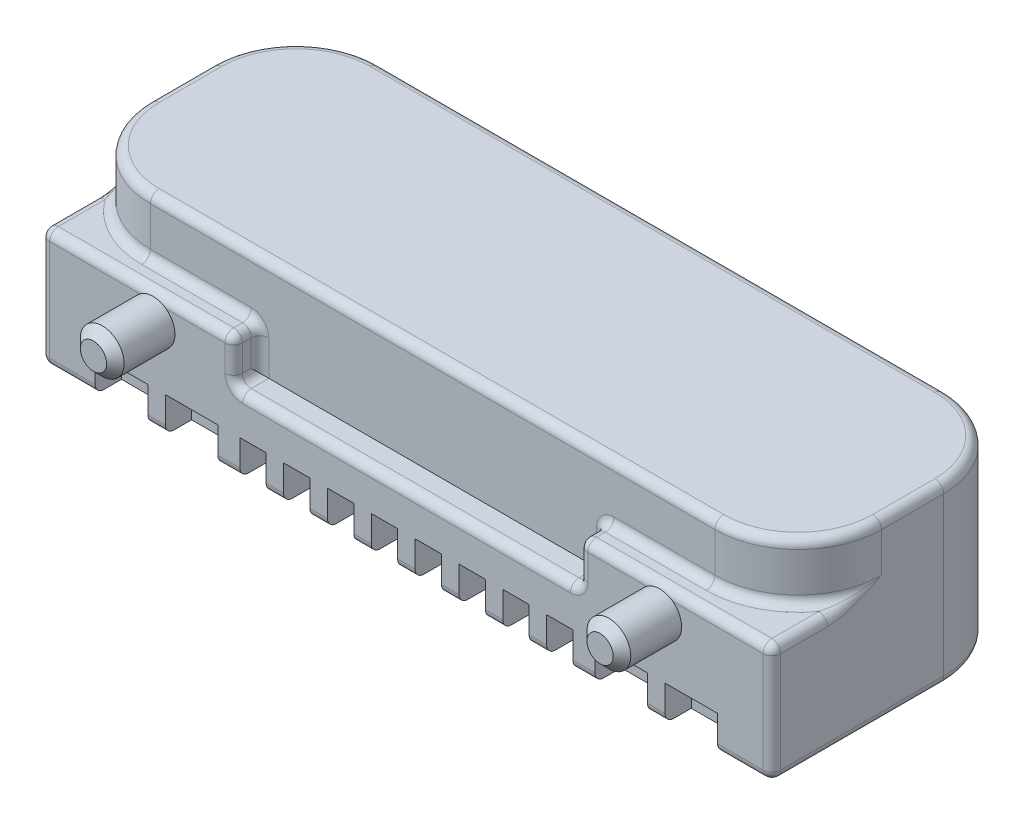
ISO-10303-21;
HEADER;
FILE_DESCRIPTION(('STEP AP214'),'2;1');
FILE_NAME('part.step','',(''),(''),'','','');
FILE_SCHEMA(('AUTOMOTIVE_DESIGN { 1 0 10303 214 1 1 1 1 }'));
ENDSEC;
DATA;
#1=APPLICATION_CONTEXT('core data for automotive mechanical design processes');
#2=APPLICATION_PROTOCOL_DEFINITION('international standard','automotive_design',2000,#1);
#3=PRODUCT_CONTEXT('',#1,'mechanical');
#4=PRODUCT('Part','Part','',(#3));
#5=PRODUCT_RELATED_PRODUCT_CATEGORY('part','',(#4));
#6=PRODUCT_DEFINITION_FORMATION('','',#4);
#7=PRODUCT_DEFINITION_CONTEXT('part definition',#1,'design');
#8=PRODUCT_DEFINITION('design','',#6,#7);
#9=PRODUCT_DEFINITION_SHAPE('','',#8);
#10=(LENGTH_UNIT() NAMED_UNIT(*) SI_UNIT(.MILLI.,.METRE.));
#11=(NAMED_UNIT(*) PLANE_ANGLE_UNIT() SI_UNIT($,.RADIAN.));
#12=(NAMED_UNIT(*) SI_UNIT($,.STERADIAN.) SOLID_ANGLE_UNIT());
#13=UNCERTAINTY_MEASURE_WITH_UNIT(LENGTH_MEASURE(1.E-05),#10,'distance_accuracy_value','');
#14=(GEOMETRIC_REPRESENTATION_CONTEXT(3) GLOBAL_UNCERTAINTY_ASSIGNED_CONTEXT((#13)) GLOBAL_UNIT_ASSIGNED_CONTEXT((#10,
#11,#12)) REPRESENTATION_CONTEXT('',''));
#15=CARTESIAN_POINT('',(0.,0.,0.));
#16=DIRECTION('',(0.,0.,1.));
#17=DIRECTION('',(1.,0.,0.));
#18=AXIS2_PLACEMENT_3D('',#15,#16,#17);
#19=CARTESIAN_POINT('',(0.4,-0.6,1.305));
#20=DIRECTION('',(1.,0.,0.));
#21=DIRECTION('',(0.,1.,0.));
#22=AXIS2_PLACEMENT_3D('',#19,#20,#21);
#23=PLANE('',#22);
#24=DIRECTION('',(0.,0.,1.));
#25=VECTOR('',#24,1.);
#26=CARTESIAN_POINT('',(0.4,0.,-0.355));
#27=LINE('',#26,#25);
#28=CARTESIAN_POINT('',(0.4,0.,1.305));
#29=VERTEX_POINT('',#28);
#30=CARTESIAN_POINT('',(0.4,0.,1.505));
#31=VERTEX_POINT('',#30);
#32=EDGE_CURVE('E502',#29,#31,#27,.T.);
#33=ORIENTED_EDGE('',*,*,#32,.T.);
#34=CARTESIAN_POINT('',(0.4,0.1,1.505));
#35=DIRECTION('',(-1.,0.,0.));
#36=DIRECTION('',(0.,0.,-1.));
#37=AXIS2_PLACEMENT_3D('',#34,#35,#36);
#38=CIRCLE('',#37,0.1);
#39=CARTESIAN_POINT('',(0.4,0.1,1.605));
#40=VERTEX_POINT('',#39);
#41=EDGE_CURVE('E506',#31,#40,#38,.T.);
#42=ORIENTED_EDGE('',*,*,#41,.T.);
#43=DIRECTION('',(0.,1.,0.));
#44=VECTOR('',#43,1.);
#45=CARTESIAN_POINT('',(0.4,-0.6,1.605));
#46=LINE('',#45,#44);
#47=CARTESIAN_POINT('',(0.4,0.4,1.605));
#48=VERTEX_POINT('',#47);
#49=EDGE_CURVE('E592',#40,#48,#46,.T.);
#50=ORIENTED_EDGE('',*,*,#49,.T.);
#51=DIRECTION('',(0.,0.,1.));
#52=VECTOR('',#51,1.);
#53=CARTESIAN_POINT('',(0.4,0.4,1.305));
#54=LINE('',#53,#52);
#55=CARTESIAN_POINT('',(0.4,0.4,1.305));
#56=VERTEX_POINT('',#55);
#57=EDGE_CURVE('E11',#56,#48,#54,.T.);
#58=ORIENTED_EDGE('',*,*,#57,.F.);
#59=DIRECTION('',(0.,1.,0.));
#60=VECTOR('',#59,1.);
#61=CARTESIAN_POINT('',(0.4,-0.6,1.305));
#62=LINE('',#61,#60);
#63=EDGE_CURVE('E161',#29,#56,#62,.T.);
#64=ORIENTED_EDGE('',*,*,#63,.F.);
#65=EDGE_LOOP('',(#33,#42,#50,#58,#64));
#66=FACE_BOUND('',#65,.T.);
#67=ADVANCED_FACE('F17',(#66),#23,.F.);
#68=CARTESIAN_POINT('',(0.1,0.4,1.305));
#69=DIRECTION('',(0.,1.,0.));
#70=DIRECTION('',(1.,0.,0.));
#71=AXIS2_PLACEMENT_3D('',#68,#69,#70);
#72=PLANE('',#71);
#73=DIRECTION('',(-1.,0.,0.));
#74=VECTOR('',#73,1.);
#75=CARTESIAN_POINT('',(0.1,0.4,1.605));
#76=LINE('',#75,#74);
#77=CARTESIAN_POINT('',(0.1,0.4,1.605));
#78=VERTEX_POINT('',#77);
#79=EDGE_CURVE('E563',#48,#78,#76,.T.);
#80=ORIENTED_EDGE('',*,*,#79,.T.);
#81=DIRECTION('',(0.,0.,1.));
#82=VECTOR('',#81,1.);
#83=CARTESIAN_POINT('',(0.1,0.4,1.305));
#84=LINE('',#83,#82);
#85=CARTESIAN_POINT('',(0.1,0.4,1.305));
#86=VERTEX_POINT('',#85);
#87=EDGE_CURVE('E876',#86,#78,#84,.T.);
#88=ORIENTED_EDGE('',*,*,#87,.F.);
#89=DIRECTION('',(-1.,0.,0.));
#90=VECTOR('',#89,1.);
#91=CARTESIAN_POINT('',(0.1,0.4,1.305));
#92=LINE('',#91,#90);
#93=EDGE_CURVE('E27',#56,#86,#92,.T.);
#94=ORIENTED_EDGE('',*,*,#93,.F.);
#95=ORIENTED_EDGE('',*,*,#57,.T.);
#96=EDGE_LOOP('',(#80,#88,#94,#95));
#97=FACE_BOUND('',#96,.T.);
#98=ADVANCED_FACE('F492',(#97),#72,.F.);
#99=CARTESIAN_POINT('',(0.,0.,1.305));
#100=DIRECTION('',(0.,0.,-1.));
#101=DIRECTION('',(0.,-1.,0.));
#102=AXIS2_PLACEMENT_3D('',#99,#100,#101);
#103=PLANE('',#102);
#104=DIRECTION('',(1.,0.,0.));
#105=VECTOR('',#104,1.);
#106=CARTESIAN_POINT('',(3.22,0.,1.305));
#107=LINE('',#106,#105);
#108=CARTESIAN_POINT('',(0.1,0.,1.305));
#109=VERTEX_POINT('',#108);
#110=EDGE_CURVE('E515',#109,#29,#107,.T.);
#111=ORIENTED_EDGE('',*,*,#110,.T.);
#112=ORIENTED_EDGE('',*,*,#63,.T.);
#113=ORIENTED_EDGE('',*,*,#93,.T.);
#114=DIRECTION('',(0.,-1.,0.));
#115=VECTOR('',#114,1.);
#116=CARTESIAN_POINT('',(0.1,-0.6,1.305));
#117=LINE('',#116,#115);
#118=EDGE_CURVE('E631',#86,#109,#117,.T.);
#119=ORIENTED_EDGE('',*,*,#118,.T.);
#120=EDGE_LOOP('',(#111,#112,#113,#119));
#121=FACE_BOUND('',#120,.T.);
#122=ADVANCED_FACE('F496',(#121),#103,.F.);
#123=CARTESIAN_POINT('',(-4.07,1.25,-0.355));
#124=DIRECTION('',(0.,0.,1.));
#125=DIRECTION('',(0.707106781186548,-0.707106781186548,0.));
#126=AXIS2_PLACEMENT_3D('',#123,#124,#125);
#127=CYLINDRICAL_SURFACE('',#126,0.1);
#128=DIRECTION('',(0.,0.,-1.));
#129=VECTOR('',#128,1.);
#130=CARTESIAN_POINT('',(-4.17,1.25,0.355));
#131=LINE('',#130,#129);
#132=CARTESIAN_POINT('',(-4.17,1.25,1.505));
#133=VERTEX_POINT('',#132);
#134=CARTESIAN_POINT('',(-4.17,1.25,0.971441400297));
#135=VERTEX_POINT('',#134);
#136=EDGE_CURVE('E1308',#133,#135,#131,.T.);
#137=ORIENTED_EDGE('',*,*,#136,.F.);
#138=CARTESIAN_POINT('',(-4.07,1.25,1.505));
#139=DIRECTION('',(0.,0.,-1.));
#140=DIRECTION('',(1.,0.,0.));
#141=AXIS2_PLACEMENT_3D('',#138,#139,#140);
#142=CIRCLE('',#141,0.1);
#143=CARTESIAN_POINT('',(-4.07,1.35,1.505));
#144=VERTEX_POINT('',#143);
#145=EDGE_CURVE('E2229',#133,#144,#142,.T.);
#146=ORIENTED_EDGE('',*,*,#145,.T.);
#147=DIRECTION('',(0.,0.,1.));
#148=VECTOR('',#147,1.);
#149=CARTESIAN_POINT('',(-4.07,1.35,1.605));
#150=LINE('',#149,#148);
#151=CARTESIAN_POINT('',(-4.07,1.35,0.971441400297));
#152=VERTEX_POINT('',#151);
#153=EDGE_CURVE('E1280',#152,#144,#150,.T.);
#154=ORIENTED_EDGE('',*,*,#153,.F.);
#155=CARTESIAN_POINT('',(-4.07,1.25,0.971441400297));
#156=DIRECTION('',(0.,0.,-1.));
#157=DIRECTION('',(-1.,0.,0.));
#158=AXIS2_PLACEMENT_3D('',#155,#156,#157);
#159=CIRCLE('',#158,0.1);
#160=EDGE_CURVE('E2688',#135,#152,#159,.T.);
#161=ORIENTED_EDGE('',*,*,#160,.F.);
#162=EDGE_LOOP('',(#137,#146,#154,#161));
#163=FACE_BOUND('',#162,.T.);
#164=ADVANCED_FACE('F4588',(#163),#127,.T.);
#165=CARTESIAN_POINT('',(-4.17,1.45,1.405));
#166=DIRECTION('',(-1.,0.,0.));
#167=DIRECTION('',(0.,0.707106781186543,0.707106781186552));
#168=AXIS2_PLACEMENT_3D('',#165,#166,#167);
#169=CYLINDRICAL_SURFACE('',#168,0.1);
#170=CARTESIAN_POINT('',(-3.22,1.45,1.405));
#171=DIRECTION('',(-1.,0.,0.));
#172=DIRECTION('',(0.,0.,1.));
#173=AXIS2_PLACEMENT_3D('',#170,#171,#172);
#174=CIRCLE('',#173,0.1);
#175=CARTESIAN_POINT('',(-3.22,1.45,1.305));
#176=VERTEX_POINT('',#175);
#177=CARTESIAN_POINT('',(-3.22,1.35,1.405));
#178=VERTEX_POINT('',#177);
#179=EDGE_CURVE('E917',#176,#178,#174,.T.);
#180=ORIENTED_EDGE('',*,*,#179,.T.);
#181=DIRECTION('',(-1.,0.,0.));
#182=VECTOR('',#181,1.);
#183=CARTESIAN_POINT('',(-4.17,1.35,1.405));
#184=LINE('',#183,#182);
#185=CARTESIAN_POINT('',(-2.07,1.35,1.405));
#186=VERTEX_POINT('',#185);
#187=EDGE_CURVE('E1270',#186,#178,#184,.T.);
#188=ORIENTED_EDGE('',*,*,#187,.F.);
#189=CARTESIAN_POINT('',(-2.07,1.45,1.405));
#190=DIRECTION('',(-1.,0.,0.));
#191=DIRECTION('',(0.,0.,1.));
#192=AXIS2_PLACEMENT_3D('',#189,#190,#191);
#193=CIRCLE('',#192,0.1);
#194=CARTESIAN_POINT('',(-2.07,1.45,1.305));
#195=VERTEX_POINT('',#194);
#196=EDGE_CURVE('E1024',#195,#186,#193,.T.);
#197=ORIENTED_EDGE('',*,*,#196,.F.);
#198=DIRECTION('',(1.,0.,0.));
#199=VECTOR('',#198,1.);
#200=CARTESIAN_POINT('',(-3.22,1.45,1.305));
#201=LINE('',#200,#199);
#202=EDGE_CURVE('E314',#176,#195,#201,.T.);
#203=ORIENTED_EDGE('',*,*,#202,.F.);
#204=EDGE_LOOP('',(#180,#188,#197,#203));
#205=FACE_BOUND('',#204,.T.);
#206=ADVANCED_FACE('F211',(#205),#169,.F.);
#207=CARTESIAN_POINT('',(4.17,1.278276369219,1.133337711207));
#208=CARTESIAN_POINT('',(4.17,1.41633127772,1.07767528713));
#209=CARTESIAN_POINT('',(4.032193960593,1.36413818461,1.098719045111));
#210=CARTESIAN_POINT('',(4.169999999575,1.270018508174,1.11285642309));
#211=CARTESIAN_POINT('',(4.171652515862,1.406678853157,1.068739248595));
#212=CARTESIAN_POINT('',(4.036840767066,1.360009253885,1.083403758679));
#213=CARTESIAN_POINT('',(4.169999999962,1.263970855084,1.091903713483));
#214=CARTESIAN_POINT('',(4.168766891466,1.3918749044,1.058658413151));
#215=CARTESIAN_POINT('',(4.04166315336,1.356985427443,1.067461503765));
#216=CARTESIAN_POINT('',(4.169999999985,1.255164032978,1.049296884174));
#217=CARTESIAN_POINT('',(4.171233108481,1.375793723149,1.031170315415));
#218=CARTESIAN_POINT('',(4.051581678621,1.352582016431,1.034376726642));
#219=CARTESIAN_POINT('',(4.169999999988,1.252422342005,1.027639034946));
#220=CARTESIAN_POINT('',(4.169088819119,1.365084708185,1.015989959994));
#221=CARTESIAN_POINT('',(4.056678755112,1.351211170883,1.017231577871));
#222=CARTESIAN_POINT('',(4.170000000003,1.250693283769,0.999986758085));
#223=CARTESIAN_POINT('',(4.170236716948,1.357825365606,0.994484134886));
#224=CARTESIAN_POINT('',(4.0632245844,1.350346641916,0.994854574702));
#225=CARTESIAN_POINT('',(4.17,1.250430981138,0.994281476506));
#226=CARTESIAN_POINT('',(4.169782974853,1.355691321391,0.990001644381));
#227=CARTESIAN_POINT('',(4.064577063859,1.350215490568,0.990212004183));
#228=CARTESIAN_POINT('',(4.17,1.250084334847,0.98286545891));
#229=CARTESIAN_POINT('',(4.170217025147,1.353037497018,0.980822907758));
#230=CARTESIAN_POINT('',(4.067285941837,1.350042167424,0.98086977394));
#231=CARTESIAN_POINT('',(4.17,1.25000000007,0.977154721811));
#232=CARTESIAN_POINT('',(4.169801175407,1.351158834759,0.976170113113));
#233=CARTESIAN_POINT('',(4.06864234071,1.35000000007,0.976170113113));
#234=CARTESIAN_POINT('',(4.17,1.249999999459,0.927158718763));
#235=CARTESIAN_POINT('',(4.171541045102,1.341018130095,0.934790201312));
#236=CARTESIAN_POINT('',(4.080522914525,1.349999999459,0.934790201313));
#237=CARTESIAN_POINT('',(4.170000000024,1.254931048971,0.883752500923));
#238=CARTESIAN_POINT('',(4.169275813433,1.334401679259,0.894988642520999));
#239=CARTESIAN_POINT('',(4.090884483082,1.352465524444,0.897242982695));
#240=CARTESIAN_POINT('',(4.169999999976,1.271060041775,0.798053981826));
#241=CARTESIAN_POINT('',(4.170724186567,1.334576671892,0.813728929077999));
#242=CARTESIAN_POINT('',(4.110683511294,1.360530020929,0.819758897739));
#243=CARTESIAN_POINT('',(4.170000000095,1.282325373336,0.75577360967));
#244=CARTESIAN_POINT('',(4.16970569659,1.337640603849,0.771726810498));
#245=CARTESIAN_POINT('',(4.120115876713,1.366162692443,0.779824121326));
#246=CARTESIAN_POINT('',(4.169999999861,1.315478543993,0.65254965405));
#247=CARTESIAN_POINT('',(4.170430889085,1.354250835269,0.667656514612));
#248=CARTESIAN_POINT('',(4.141162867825,1.382739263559,0.678363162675));
#249=CARTESIAN_POINT('',(4.17000000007,1.339509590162,0.593074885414));
#250=CARTESIAN_POINT('',(4.169945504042,1.369627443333,0.605808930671));
#251=CARTESIAN_POINT('',(4.151517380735,1.394754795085,0.61640100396));
#252=CARTESIAN_POINT('',(4.16999999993,1.391466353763,0.475795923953));
#253=CARTESIAN_POINT('',(4.170054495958,1.406139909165,0.482905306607));
#254=CARTESIAN_POINT('',(4.165840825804,1.420733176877,0.489910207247));
#255=CARTESIAN_POINT('',(4.169999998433,1.419452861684,0.417979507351));
#256=CARTESIAN_POINT('',(4.169999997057,1.427090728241,0.421683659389));
#257=CARTESIAN_POINT('',(4.16976992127,1.434726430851,0.425386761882));
#258=CARTESIAN_POINT('',(4.170000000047,1.448303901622,0.358496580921));
#259=CARTESIAN_POINT('',(4.170000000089,1.448727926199,0.35870226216));
#260=CARTESIAN_POINT('',(4.16999667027,1.449151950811,0.358907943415));
#261=CARTESIAN_POINT('',(4.170000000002,1.449151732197,0.356748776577));
#262=CARTESIAN_POINT('',(4.170000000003,1.449363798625,0.356851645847));
#263=CARTESIAN_POINT('',(4.170000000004,1.44957586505,0.356954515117));
#264=CARTESIAN_POINT('',(4.17,1.45,0.355));
#265=CARTESIAN_POINT('',(4.17,1.45,0.355));
#266=CARTESIAN_POINT('',(4.17,1.45,0.355));
#267=(BOUNDED_SURFACE() B_SPLINE_SURFACE(3,2,((#207,#208,#209),(#210,#211,#212),(#213,#214,
#215),(#216,#217,#218),(#219,#220,#221),(#222,#223,#224),(#225,#226,#227),(#228,#229,#230),
(#231,#232,#233),(#234,#235,#236),(#237,#238,#239),(#240,#241,#242),(#243,#244,#245),(#246,#247,
#248),(#249,#250,#251),(#252,#253,#254),(#255,#256,#257),(#258,#259,#260),(#261,#262,#263),
(#264,#265,#266)),.UNSPECIFIED.,.F.,.F.,.F.) B_SPLINE_SURFACE_WITH_KNOTS((4,2,2,2,2,2,2,2,2,4),
(3,3),(0.,0.06525993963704,0.130519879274,0.147473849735,0.164427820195,0.295834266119,
0.427240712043,0.619632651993,0.812024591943,0.817855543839),(0.,1.),
.UNSPECIFIED.) GEOMETRIC_REPRESENTATION_ITEM() RATIONAL_B_SPLINE_SURFACE(((1.,0.557646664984,
1.),(1.,0.557646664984,1.),(1.,0.61896048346,1.),(1.,0.61896048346,1.),(1.,0.677771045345,1.),
(1.,0.677771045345,1.),(1.,0.692573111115,1.),(1.,0.692573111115,1.),(1.,0.707106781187,1.),(1.,
0.707106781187,1.),(1.,0.808653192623,1.),(1.,0.808653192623,1.),(1.,0.890666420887,1.),(1.,
0.890666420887,1.),(1.,0.971285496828,1.),(1.,0.971285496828,1.),(1.,0.999975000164,1.),(1.,
0.999975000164,1.),(1.,1.,1.),(1.,1.,1.))) REPRESENTATION_ITEM('') SURFACE());
#268=CARTESIAN_POINT('',(4.17,1.45,0.355));
#269=CARTESIAN_POINT('',(4.16999916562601,1.44524748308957,0.376904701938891));
#270=CARTESIAN_POINT('',(4.16957393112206,1.44049261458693,0.398808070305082));
#271=CARTESIAN_POINT('',(4.16789921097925,1.43105587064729,0.442524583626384));
#272=CARTESIAN_POINT('',(4.1666524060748,1.42637380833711,0.464337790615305));
#273=CARTESIAN_POINT('',(4.16337060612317,1.41716185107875,0.507772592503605));
#274=CARTESIAN_POINT('',(4.16134132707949,1.41263110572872,0.529394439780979));
#275=CARTESIAN_POINT('',(4.15653068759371,1.40379461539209,0.572353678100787));
#276=CARTESIAN_POINT('',(4.15375769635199,1.39948696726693,0.59369161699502));
#277=CARTESIAN_POINT('',(4.14754671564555,1.3911881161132,0.636040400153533));
#278=CARTESIAN_POINT('',(4.14411776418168,1.38719354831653,0.657051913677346));
#279=CARTESIAN_POINT('',(4.13667341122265,1.37961683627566,0.698716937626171));
#280=CARTESIAN_POINT('',(4.13266736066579,1.37602949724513,0.719371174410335));
#281=CARTESIAN_POINT('',(4.12417939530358,1.3693826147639,0.760178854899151));
#282=CARTESIAN_POINT('',(4.11970997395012,1.36631314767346,0.780333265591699));
#283=CARTESIAN_POINT('',(4.11042316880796,1.36086062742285,0.820040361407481));
#284=CARTESIAN_POINT('',(4.10561929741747,1.35846053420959,0.839593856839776));
#285=CARTESIAN_POINT('',(4.09576589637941,1.35446064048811,0.878123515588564));
#286=CARTESIAN_POINT('',(4.09072733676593,1.35283989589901,0.897100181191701));
#287=CARTESIAN_POINT('',(4.0804898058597,1.350626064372,0.934536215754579));
#288=CARTESIAN_POINT('',(4.07529841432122,1.3500073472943,0.952996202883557));
#289=CARTESIAN_POINT('',(4.06999999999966,1.35000000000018,0.971441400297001));
#290=B_SPLINE_CURVE_WITH_KNOTS('',3,(#268,#269,#270,#271,#272,#273,#274,#275,#276,#277,#278,
#279,#280,#281,#282,#283,#284,#285,#286,#287,#288,#289),.UNSPECIFIED.,.F.,.F.,(4,2,2,2,2,2,2,2,
2,2,4),(0.,0.067237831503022,0.13425734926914,0.200796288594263,0.266615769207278,
0.331586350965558,0.395602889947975,0.45820267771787,0.51902198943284,0.578100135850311,
0.635641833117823),.UNSPECIFIED.);
#291=CARTESIAN_POINT('',(4.07,1.35,0.971441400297));
#292=VERTEX_POINT('',#291);
#293=CARTESIAN_POINT('',(4.17,1.45,0.355));
#294=VERTEX_POINT('',#293);
#295=EDGE_CURVE('E174',#292,#294,#290,.F.);
#296=CARTESIAN_POINT('',(4.07,1.25,0.971441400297));
#297=DIRECTION('',(0.,0.,1.));
#298=DIRECTION('',(1.,0.,0.));
#299=AXIS2_PLACEMENT_3D('',#296,#297,#298);
#300=CIRCLE('',#299,0.1);
#301=CARTESIAN_POINT('',(4.17,1.25,0.971441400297));
#302=VERTEX_POINT('',#301);
#303=EDGE_CURVE('E243',#302,#292,#300,.T.);
#304=CARTESIAN_POINT('',(4.17,1.45,0.355));
#305=CARTESIAN_POINT('',(4.17,1.40247073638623,0.452985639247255));
#306=CARTESIAN_POINT('',(4.17,1.35464643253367,0.551097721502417));
#307=CARTESIAN_POINT('',(4.17,1.2788623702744,0.75559577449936));
#308=CARTESIAN_POINT('',(4.17,1.24999999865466,0.861342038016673));
#309=CARTESIAN_POINT('',(4.17,1.25,0.971441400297));
#310=(BOUNDED_CURVE() B_SPLINE_CURVE(3,(#304,#305,#306,#307,#308,#309),.UNSPECIFIED.,.F.,
.F.) B_SPLINE_CURVE_WITH_KNOTS((4,2,4),(0.,0.5,1.),
.UNSPECIFIED.) CURVE() GEOMETRIC_REPRESENTATION_ITEM() RATIONAL_B_SPLINE_CURVE((1.,1.,1.,1.,1.,1.)) REPRESENTATION_ITEM(''));
#311=EDGE_CURVE('E259',#294,#302,#310,.T.);
#312=ORIENTED_EDGE('',*,*,#295,.F.);
#313=ORIENTED_EDGE('',*,*,#303,.F.);
#314=ORIENTED_EDGE('',*,*,#311,.F.);
#315=EDGE_LOOP('',(#312,#313,#314));
#316=FACE_BOUND('',#315,.T.);
#317=ADVANCED_FACE('F204',(#316),#267,.T.);
#318=CARTESIAN_POINT('',(-3.22,1.9,1.205));
#319=DIRECTION('',(1.,0.,0.));
#320=DIRECTION('',(0.,-0.707106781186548,-0.707106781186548));
#321=AXIS2_PLACEMENT_3D('',#318,#319,#320);
#322=CYLINDRICAL_SURFACE('',#321,0.1);
#323=CARTESIAN_POINT('',(-3.22,1.9,1.205));
#324=DIRECTION('',(1.,0.,0.));
#325=DIRECTION('',(0.,0.,-1.));
#326=AXIS2_PLACEMENT_3D('',#323,#324,#325);
#327=CIRCLE('',#326,0.1);
#328=CARTESIAN_POINT('',(-3.22,2.,1.205));
#329=VERTEX_POINT('',#328);
#330=CARTESIAN_POINT('',(-3.22,1.9,1.305));
#331=VERTEX_POINT('',#330);
#332=EDGE_CURVE('E762',#329,#331,#327,.T.);
#333=ORIENTED_EDGE('',*,*,#332,.T.);
#334=DIRECTION('',(-1.,0.,0.));
#335=VECTOR('',#334,1.);
#336=CARTESIAN_POINT('',(-3.22,1.9,1.305));
#337=LINE('',#336,#335);
#338=CARTESIAN_POINT('',(3.22,1.9,1.305));
#339=VERTEX_POINT('',#338);
#340=EDGE_CURVE('E650',#339,#331,#337,.T.);
#341=ORIENTED_EDGE('',*,*,#340,.F.);
#342=CARTESIAN_POINT('',(3.22,1.9,1.205));
#343=DIRECTION('',(1.,0.,0.));
#344=DIRECTION('',(0.,0.,-1.));
#345=AXIS2_PLACEMENT_3D('',#342,#343,#344);
#346=CIRCLE('',#345,0.1);
#347=CARTESIAN_POINT('',(3.22,2.,1.205));
#348=VERTEX_POINT('',#347);
#349=EDGE_CURVE('E1091',#348,#339,#346,.T.);
#350=ORIENTED_EDGE('',*,*,#349,.F.);
#351=DIRECTION('',(1.,0.,0.));
#352=VECTOR('',#351,1.);
#353=CARTESIAN_POINT('',(3.22,2.,1.205));
#354=LINE('',#353,#352);
#355=EDGE_CURVE('E141',#329,#348,#354,.T.);
#356=ORIENTED_EDGE('',*,*,#355,.F.);
#357=EDGE_LOOP('',(#333,#341,#350,#356));
#358=FACE_BOUND('',#357,.T.);
#359=ADVANCED_FACE('F200',(#358),#322,.T.);
#360=CARTESIAN_POINT('',(3.22,1.9,-1.205));
#361=DIRECTION('',(-1.,0.,0.));
#362=DIRECTION('',(0.,-0.707106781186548,0.707106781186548));
#363=AXIS2_PLACEMENT_3D('',#360,#361,#362);
#364=CYLINDRICAL_SURFACE('',#363,0.1);
#365=CARTESIAN_POINT('',(-3.22,1.9,-1.205));
#366=DIRECTION('',(1.,0.,0.));
#367=DIRECTION('',(0.,0.,-1.));
#368=AXIS2_PLACEMENT_3D('',#365,#366,#367);
#369=CIRCLE('',#368,0.1);
#370=CARTESIAN_POINT('',(-3.22,1.9,-1.305));
#371=VERTEX_POINT('',#370);
#372=CARTESIAN_POINT('',(-3.22,2.,-1.205));
#373=VERTEX_POINT('',#372);
#374=EDGE_CURVE('E1336',#371,#373,#369,.T.);
#375=ORIENTED_EDGE('',*,*,#374,.T.);
#376=DIRECTION('',(-1.,0.,0.));
#377=VECTOR('',#376,1.);
#378=CARTESIAN_POINT('',(-3.22,2.,-1.205));
#379=LINE('',#378,#377);
#380=CARTESIAN_POINT('',(3.22,2.,-1.205));
#381=VERTEX_POINT('',#380);
#382=EDGE_CURVE('E147',#381,#373,#379,.T.);
#383=ORIENTED_EDGE('',*,*,#382,.F.);
#384=CARTESIAN_POINT('',(3.22,1.9,-1.205));
#385=DIRECTION('',(1.,0.,0.));
#386=DIRECTION('',(0.,0.,-1.));
#387=AXIS2_PLACEMENT_3D('',#384,#385,#386);
#388=CIRCLE('',#387,0.1);
#389=CARTESIAN_POINT('',(3.22,1.9,-1.305));
#390=VERTEX_POINT('',#389);
#391=EDGE_CURVE('E130',#390,#381,#388,.T.);
#392=ORIENTED_EDGE('',*,*,#391,.F.);
#393=DIRECTION('',(1.,0.,0.));
#394=VECTOR('',#393,1.);
#395=CARTESIAN_POINT('',(3.22,1.9,-1.305));
#396=LINE('',#395,#394);
#397=EDGE_CURVE('E1472',#371,#390,#396,.T.);
#398=ORIENTED_EDGE('',*,*,#397,.F.);
#399=EDGE_LOOP('',(#375,#383,#392,#398));
#400=FACE_BOUND('',#399,.T.);
#401=ADVANCED_FACE('F197',(#400),#364,.T.);
#402=CARTESIAN_POINT('',(3.22,1.9,-0.355));
#403=DIRECTION('',(0.,-1.,0.));
#404=DIRECTION('',(-0.707106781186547,0.,0.707106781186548));
#405=AXIS2_PLACEMENT_3D('',#402,#403,#404);
#406=TOROIDAL_SURFACE('',#405,0.85,0.1);
#407=ORIENTED_EDGE('',*,*,#391,.T.);
#408=CARTESIAN_POINT('',(3.22,2.,-0.355));
#409=DIRECTION('',(0.,1.,0.));
#410=DIRECTION('',(0.,0.,-1.));
#411=AXIS2_PLACEMENT_3D('',#408,#409,#410);
#412=CIRCLE('',#411,0.85);
#413=CARTESIAN_POINT('',(4.07,2.,-0.355));
#414=VERTEX_POINT('',#413);
#415=EDGE_CURVE('E136',#414,#381,#412,.T.);
#416=ORIENTED_EDGE('',*,*,#415,.F.);
#417=CARTESIAN_POINT('',(4.07,1.9,-0.355));
#418=DIRECTION('',(0.,0.,-1.));
#419=DIRECTION('',(-1.,0.,0.));
#420=AXIS2_PLACEMENT_3D('',#417,#418,#419);
#421=CIRCLE('',#420,0.1);
#422=CARTESIAN_POINT('',(4.17,1.9,-0.355));
#423=VERTEX_POINT('',#422);
#424=EDGE_CURVE('E116',#414,#423,#421,.T.);
#425=ORIENTED_EDGE('',*,*,#424,.T.);
#426=CARTESIAN_POINT('',(3.22,1.9,-0.355));
#427=DIRECTION('',(0.,-1.,0.));
#428=DIRECTION('',(0.,0.,-1.));
#429=AXIS2_PLACEMENT_3D('',#426,#427,#428);
#430=CIRCLE('',#429,0.95);
#431=EDGE_CURVE('E1207',#390,#423,#430,.T.);
#432=ORIENTED_EDGE('',*,*,#431,.F.);
#433=EDGE_LOOP('',(#407,#416,#425,#432));
#434=FACE_BOUND('',#433,.T.);
#435=ADVANCED_FACE('F143',(#434),#406,.T.);
#436=CARTESIAN_POINT('',(4.07,1.9,0.355));
#437=DIRECTION('',(0.,0.,-1.));
#438=DIRECTION('',(-0.707106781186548,-0.707106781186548,0.));
#439=AXIS2_PLACEMENT_3D('',#436,#437,#438);
#440=CYLINDRICAL_SURFACE('',#439,0.1);
#441=CARTESIAN_POINT('',(4.07,1.9,0.355));
#442=DIRECTION('',(0.,0.,-1.));
#443=DIRECTION('',(-1.,0.,0.));
#444=AXIS2_PLACEMENT_3D('',#441,#442,#443);
#445=CIRCLE('',#444,0.1);
#446=CARTESIAN_POINT('',(4.07,2.,0.355));
#447=VERTEX_POINT('',#446);
#448=CARTESIAN_POINT('',(4.17,1.9,0.355));
#449=VERTEX_POINT('',#448);
#450=EDGE_CURVE('E155',#447,#449,#445,.T.);
#451=ORIENTED_EDGE('',*,*,#450,.T.);
#452=DIRECTION('',(0.,0.,1.));
#453=VECTOR('',#452,1.);
#454=CARTESIAN_POINT('',(4.17,1.9,0.355));
#455=LINE('',#454,#453);
#456=EDGE_CURVE('E124',#423,#449,#455,.T.);
#457=ORIENTED_EDGE('',*,*,#456,.F.);
#458=ORIENTED_EDGE('',*,*,#424,.F.);
#459=DIRECTION('',(0.,0.,-1.));
#460=VECTOR('',#459,1.);
#461=CARTESIAN_POINT('',(4.07,2.,-0.355));
#462=LINE('',#461,#460);
#463=EDGE_CURVE('E120',#447,#414,#462,.T.);
#464=ORIENTED_EDGE('',*,*,#463,.F.);
#465=EDGE_LOOP('',(#451,#457,#458,#464));
#466=FACE_BOUND('',#465,.T.);
#467=ADVANCED_FACE('F119',(#466),#440,.T.);
#468=CARTESIAN_POINT('',(3.22,2.,-0.355));
#469=DIRECTION('',(0.,-1.,0.));
#470=DIRECTION('',(0.,0.,-1.));
#471=AXIS2_PLACEMENT_3D('',#468,#469,#470);
#472=PLANE('',#471);
#473=ORIENTED_EDGE('',*,*,#415,.T.);
#474=ORIENTED_EDGE('',*,*,#382,.T.);
#475=CARTESIAN_POINT('',(-3.22,2.,-0.355));
#476=DIRECTION('',(0.,1.,0.));
#477=DIRECTION('',(0.,0.,-1.));
#478=AXIS2_PLACEMENT_3D('',#475,#476,#477);
#479=CIRCLE('',#478,0.85);
#480=CARTESIAN_POINT('',(-4.07,2.,-0.355));
#481=VERTEX_POINT('',#480);
#482=EDGE_CURVE('E1332',#373,#481,#479,.T.);
#483=ORIENTED_EDGE('',*,*,#482,.T.);
#484=DIRECTION('',(0.,0.,1.));
#485=VECTOR('',#484,1.);
#486=CARTESIAN_POINT('',(-4.07,2.,0.355));
#487=LINE('',#486,#485);
#488=CARTESIAN_POINT('',(-4.07,2.,0.355));
#489=VERTEX_POINT('',#488);
#490=EDGE_CURVE('E832',#481,#489,#487,.T.);
#491=ORIENTED_EDGE('',*,*,#490,.T.);
#492=CARTESIAN_POINT('',(-3.22,2.,0.355));
#493=DIRECTION('',(0.,1.,0.));
#494=DIRECTION('',(0.,0.,-1.));
#495=AXIS2_PLACEMENT_3D('',#492,#493,#494);
#496=CIRCLE('',#495,0.85);
#497=EDGE_CURVE('E833',#489,#329,#496,.T.);
#498=ORIENTED_EDGE('',*,*,#497,.T.);
#499=ORIENTED_EDGE('',*,*,#355,.T.);
#500=CARTESIAN_POINT('',(3.22,2.,0.355));
#501=DIRECTION('',(0.,1.,0.));
#502=DIRECTION('',(0.,0.,-1.));
#503=AXIS2_PLACEMENT_3D('',#500,#501,#502);
#504=CIRCLE('',#503,0.85);
#505=EDGE_CURVE('E138',#348,#447,#504,.T.);
#506=ORIENTED_EDGE('',*,*,#505,.T.);
#507=ORIENTED_EDGE('',*,*,#463,.T.);
#508=EDGE_LOOP('',(#473,#474,#483,#491,#498,#499,#506,#507));
#509=FACE_BOUND('',#508,.T.);
#510=ADVANCED_FACE('F134',(#509),#472,.F.);
#511=CARTESIAN_POINT('',(3.22,1.9,0.355));
#512=DIRECTION('',(0.,-1.,0.));
#513=DIRECTION('',(-0.707106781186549,0.,-0.707106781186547));
#514=AXIS2_PLACEMENT_3D('',#511,#512,#513);
#515=TOROIDAL_SURFACE('',#514,0.85,0.1);
#516=ORIENTED_EDGE('',*,*,#349,.T.);
#517=CARTESIAN_POINT('',(3.22,1.9,0.355));
#518=DIRECTION('',(0.,-1.,0.));
#519=DIRECTION('',(0.,0.,-1.));
#520=AXIS2_PLACEMENT_3D('',#517,#518,#519);
#521=CIRCLE('',#520,0.95);
#522=EDGE_CURVE('E256',#449,#339,#521,.T.);
#523=ORIENTED_EDGE('',*,*,#522,.F.);
#524=ORIENTED_EDGE('',*,*,#450,.F.);
#525=ORIENTED_EDGE('',*,*,#505,.F.);
#526=EDGE_LOOP('',(#516,#523,#524,#525));
#527=FACE_BOUND('',#526,.T.);
#528=ADVANCED_FACE('F3683',(#527),#515,.T.);
#529=CARTESIAN_POINT('',(3.22,2.,0.355));
#530=DIRECTION('',(0.,-1.,0.));
#531=DIRECTION('',(-0.707106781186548,0.,-0.707106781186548));
#532=AXIS2_PLACEMENT_3D('',#529,#530,#531);
#533=CYLINDRICAL_SURFACE('',#532,0.95);
#534=DIRECTION('',(0.,-1.,0.));
#535=VECTOR('',#534,1.);
#536=CARTESIAN_POINT('',(4.17,2.,0.355));
#537=LINE('',#536,#535);
#538=EDGE_CURVE('E263',#449,#294,#537,.T.);
#539=ORIENTED_EDGE('',*,*,#538,.F.);
#540=ORIENTED_EDGE('',*,*,#522,.T.);
#541=DIRECTION('',(0.,-1.,0.));
#542=VECTOR('',#541,1.);
#543=CARTESIAN_POINT('',(3.22,2.,1.305));
#544=LINE('',#543,#542);
#545=CARTESIAN_POINT('',(3.22,1.45,1.305));
#546=VERTEX_POINT('',#545);
#547=EDGE_CURVE('E1062',#339,#546,#544,.T.);
#548=ORIENTED_EDGE('',*,*,#547,.T.);
#549=CARTESIAN_POINT('',(3.22,1.45,0.355));
#550=DIRECTION('',(0.,1.,0.));
#551=DIRECTION('',(1.,0.,0.));
#552=AXIS2_PLACEMENT_3D('',#549,#550,#551);
#553=CIRCLE('',#552,0.95);
#554=EDGE_CURVE('E252',#546,#294,#553,.T.);
#555=ORIENTED_EDGE('',*,*,#554,.T.);
#556=EDGE_LOOP('',(#539,#540,#548,#555));
#557=FACE_BOUND('',#556,.T.);
#558=ADVANCED_FACE('F192',(#557),#533,.T.);
#559=CARTESIAN_POINT('',(3.22,1.45,0.355));
#560=DIRECTION('',(0.,-1.,0.));
#561=DIRECTION('',(-0.707106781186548,0.,-0.707106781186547));
#562=AXIS2_PLACEMENT_3D('',#559,#560,#561);
#563=TOROIDAL_SURFACE('',#562,1.05,0.1);
#564=ORIENTED_EDGE('',*,*,#295,.T.);
#565=ORIENTED_EDGE('',*,*,#554,.F.);
#566=CARTESIAN_POINT('',(3.22,1.45,1.405));
#567=DIRECTION('',(1.,0.,0.));
#568=DIRECTION('',(0.,0.,-1.));
#569=AXIS2_PLACEMENT_3D('',#566,#567,#568);
#570=CIRCLE('',#569,0.1);
#571=CARTESIAN_POINT('',(3.22,1.35,1.405));
#572=VERTEX_POINT('',#571);
#573=EDGE_CURVE('E1518',#572,#546,#570,.T.);
#574=ORIENTED_EDGE('',*,*,#573,.F.);
#575=CARTESIAN_POINT('',(4.07,1.35,0.971441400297));
#576=CARTESIAN_POINT('',(3.97307828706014,1.35,1.10507680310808));
#577=CARTESIAN_POINT('',(3.84415230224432,1.35,1.21534014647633));
#578=CARTESIAN_POINT('',(3.55003411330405,1.35,1.36536070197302));
#579=CARTESIAN_POINT('',(3.38508253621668,1.35,1.40499517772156));
#580=CARTESIAN_POINT('',(3.22,1.35,1.405));
#581=(BOUNDED_CURVE() B_SPLINE_CURVE(3,(#575,#576,#577,#578,#579,#580),.UNSPECIFIED.,.F.,
.F.) B_SPLINE_CURVE_WITH_KNOTS((4,2,4),(0.627455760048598,1.09912604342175,1.5707963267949),
.UNSPECIFIED.) CURVE() GEOMETRIC_REPRESENTATION_ITEM() RATIONAL_B_SPLINE_CURVE((1.,1.,1.,1.,1.,1.)) REPRESENTATION_ITEM(''));
#582=EDGE_CURVE('E222',#292,#572,#581,.T.);
#583=ORIENTED_EDGE('',*,*,#582,.F.);
#584=EDGE_LOOP('',(#564,#565,#574,#583));
#585=FACE_BOUND('',#584,.T.);
#586=ADVANCED_FACE('F181',(#585),#563,.F.);
#587=CARTESIAN_POINT('',(1.87,1.35,1.405));
#588=DIRECTION('',(0.,-1.,0.));
#589=DIRECTION('',(-0.707106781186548,0.,0.707106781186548));
#590=AXIS2_PLACEMENT_3D('',#587,#588,#589);
#591=CYLINDRICAL_SURFACE('',#590,0.1);
#592=CARTESIAN_POINT('',(1.87,1.25,1.405));
#593=DIRECTION('',(0.,1.,0.));
#594=DIRECTION('',(0.,0.,-1.));
#595=AXIS2_PLACEMENT_3D('',#592,#593,#594);
#596=CIRCLE('',#595,0.1);
#597=CARTESIAN_POINT('',(1.97,1.25,1.405));
#598=VERTEX_POINT('',#597);
#599=CARTESIAN_POINT('',(1.87,1.25,1.305));
#600=VERTEX_POINT('',#599);
#601=EDGE_CURVE('E80',#598,#600,#596,.T.);
#602=ORIENTED_EDGE('',*,*,#601,.T.);
#603=DIRECTION('',(0.,1.,0.));
#604=VECTOR('',#603,1.);
#605=CARTESIAN_POINT('',(1.87,2.,1.305));
#606=LINE('',#605,#604);
#607=CARTESIAN_POINT('',(1.87,0.85,1.305));
#608=VERTEX_POINT('',#607);
#609=EDGE_CURVE('E309',#608,#600,#606,.T.);
#610=ORIENTED_EDGE('',*,*,#609,.F.);
#611=CARTESIAN_POINT('',(1.87,0.95,1.405));
#612=DIRECTION('',(0.,-0.707106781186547,0.707106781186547));
#613=DIRECTION('',(0.,-0.707106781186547,-0.707106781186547));
#614=AXIS2_PLACEMENT_3D('',#611,#612,#613);
#615=ELLIPSE('',#614,0.14142135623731,0.1);
#616=CARTESIAN_POINT('',(1.97,0.95,1.405));
#617=VERTEX_POINT('',#616);
#618=EDGE_CURVE('E20',#617,#608,#615,.F.);
#619=ORIENTED_EDGE('',*,*,#618,.F.);
#620=DIRECTION('',(0.,-1.,0.));
#621=VECTOR('',#620,1.);
#622=CARTESIAN_POINT('',(1.97,1.35,1.405));
#623=LINE('',#622,#621);
#624=EDGE_CURVE('E304',#598,#617,#623,.T.);
#625=ORIENTED_EDGE('',*,*,#624,.F.);
#626=EDGE_LOOP('',(#602,#610,#619,#625));
#627=FACE_BOUND('',#626,.T.);
#628=ADVANCED_FACE('F191',(#627),#591,.F.);
#629=CARTESIAN_POINT('',(2.07,1.25,1.405));
#630=DIRECTION('',(0.,0.,1.));
#631=DIRECTION('',(0.707106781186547,-0.707106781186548,0.));
#632=AXIS2_PLACEMENT_3D('',#629,#630,#631);
#633=TOROIDAL_SURFACE('',#632,0.2,0.1);
#634=ORIENTED_EDGE('',*,*,#601,.F.);
#635=CARTESIAN_POINT('',(2.07,1.25,1.405));
#636=DIRECTION('',(0.,0.,1.));
#637=DIRECTION('',(1.,0.,0.));
#638=AXIS2_PLACEMENT_3D('',#635,#636,#637);
#639=CIRCLE('',#638,0.1);
#640=CARTESIAN_POINT('',(2.07,1.35,1.405));
#641=VERTEX_POINT('',#640);
#642=EDGE_CURVE('E724',#641,#598,#639,.T.);
#643=ORIENTED_EDGE('',*,*,#642,.F.);
#644=CARTESIAN_POINT('',(2.07,1.45,1.405));
#645=DIRECTION('',(1.,0.,0.));
#646=DIRECTION('',(0.,0.,-1.));
#647=AXIS2_PLACEMENT_3D('',#644,#645,#646);
#648=CIRCLE('',#647,0.1);
#649=CARTESIAN_POINT('',(2.07,1.45,1.305));
#650=VERTEX_POINT('',#649);
#651=EDGE_CURVE('E1522',#641,#650,#648,.T.);
#652=ORIENTED_EDGE('',*,*,#651,.T.);
#653=CARTESIAN_POINT('',(2.07,1.25,1.305));
#654=DIRECTION('',(0.,0.,1.));
#655=DIRECTION('',(1.,0.,0.));
#656=AXIS2_PLACEMENT_3D('',#653,#654,#655);
#657=CIRCLE('',#656,0.2);
#658=EDGE_CURVE('E313',#650,#600,#657,.T.);
#659=ORIENTED_EDGE('',*,*,#658,.T.);
#660=EDGE_LOOP('',(#634,#643,#652,#659));
#661=FACE_BOUND('',#660,.T.);
#662=ADVANCED_FACE('F365',(#661),#633,.F.);
#663=CARTESIAN_POINT('',(1.97,1.45,1.405));
#664=DIRECTION('',(-1.,0.,0.));
#665=DIRECTION('',(0.,0.707106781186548,0.707106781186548));
#666=AXIS2_PLACEMENT_3D('',#663,#664,#665);
#667=CYLINDRICAL_SURFACE('',#666,0.1);
#668=ORIENTED_EDGE('',*,*,#573,.T.);
#669=DIRECTION('',(1.,0.,0.));
#670=VECTOR('',#669,1.);
#671=CARTESIAN_POINT('',(-3.22,1.45,1.305));
#672=LINE('',#671,#670);
#673=EDGE_CURVE('E1514',#650,#546,#672,.T.);
#674=ORIENTED_EDGE('',*,*,#673,.F.);
#675=ORIENTED_EDGE('',*,*,#651,.F.);
#676=DIRECTION('',(-1.,0.,0.));
#677=VECTOR('',#676,1.);
#678=CARTESIAN_POINT('',(1.97,1.35,1.405));
#679=LINE('',#678,#677);
#680=EDGE_CURVE('E231',#572,#641,#679,.T.);
#681=ORIENTED_EDGE('',*,*,#680,.F.);
#682=EDGE_LOOP('',(#668,#674,#675,#681));
#683=FACE_BOUND('',#682,.T.);
#684=ADVANCED_FACE('F480',(#683),#667,.F.);
#685=CARTESIAN_POINT('',(-3.22,2.,1.305));
#686=DIRECTION('',(0.,0.,1.));
#687=DIRECTION('',(1.,0.,0.));
#688=AXIS2_PLACEMENT_3D('',#685,#686,#687);
#689=PLANE('',#688);
#690=ORIENTED_EDGE('',*,*,#547,.F.);
#691=ORIENTED_EDGE('',*,*,#340,.T.);
#692=DIRECTION('',(0.,-1.,0.));
#693=VECTOR('',#692,1.);
#694=CARTESIAN_POINT('',(-3.22,2.,1.305));
#695=LINE('',#694,#693);
#696=EDGE_CURVE('E763',#331,#176,#695,.T.);
#697=ORIENTED_EDGE('',*,*,#696,.T.);
#698=ORIENTED_EDGE('',*,*,#202,.T.);
#699=CARTESIAN_POINT('',(-2.07,1.25,1.305));
#700=DIRECTION('',(0.,0.,1.));
#701=DIRECTION('',(1.,0.,0.));
#702=AXIS2_PLACEMENT_3D('',#699,#700,#701);
#703=CIRCLE('',#702,0.2);
#704=CARTESIAN_POINT('',(-1.87,1.25,1.305));
#705=VERTEX_POINT('',#704);
#706=EDGE_CURVE('E1066',#705,#195,#703,.T.);
#707=ORIENTED_EDGE('',*,*,#706,.F.);
#708=DIRECTION('',(0.,-1.,0.));
#709=VECTOR('',#708,1.);
#710=CARTESIAN_POINT('',(-1.87,2.,1.305));
#711=LINE('',#710,#709);
#712=CARTESIAN_POINT('',(-1.87,0.85,1.305));
#713=VERTEX_POINT('',#712);
#714=EDGE_CURVE('E286',#705,#713,#711,.T.);
#715=ORIENTED_EDGE('',*,*,#714,.T.);
#716=DIRECTION('',(-1.,0.,0.));
#717=VECTOR('',#716,1.);
#718=CARTESIAN_POINT('',(1.97,0.85,1.305));
#719=LINE('',#718,#717);
#720=EDGE_CURVE('E295',#608,#713,#719,.T.);
#721=ORIENTED_EDGE('',*,*,#720,.F.);
#722=ORIENTED_EDGE('',*,*,#609,.T.);
#723=ORIENTED_EDGE('',*,*,#658,.F.);
#724=ORIENTED_EDGE('',*,*,#673,.T.);
#725=EDGE_LOOP('',(#690,#691,#697,#698,#707,#715,#721,#722,#723,#724));
#726=FACE_BOUND('',#725,.T.);
#727=ADVANCED_FACE('F193',(#726),#689,.T.);
#728=CARTESIAN_POINT('',(-2.07,1.25,1.405));
#729=DIRECTION('',(0.,0.,1.));
#730=DIRECTION('',(-0.707106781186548,-0.707106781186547,0.));
#731=AXIS2_PLACEMENT_3D('',#728,#729,#730);
#732=TOROIDAL_SURFACE('',#731,0.2,0.1);
#733=ORIENTED_EDGE('',*,*,#196,.T.);
#734=CARTESIAN_POINT('',(-2.07,1.25,1.405));
#735=DIRECTION('',(0.,0.,-1.));
#736=DIRECTION('',(1.,0.,0.));
#737=AXIS2_PLACEMENT_3D('',#734,#735,#736);
#738=CIRCLE('',#737,0.1);
#739=CARTESIAN_POINT('',(-1.97,1.25,1.405));
#740=VERTEX_POINT('',#739);
#741=EDGE_CURVE('E1262',#186,#740,#738,.T.);
#742=ORIENTED_EDGE('',*,*,#741,.T.);
#743=CARTESIAN_POINT('',(-1.87,1.25,1.405));
#744=DIRECTION('',(0.,1.,0.));
#745=DIRECTION('',(0.,0.,-1.));
#746=AXIS2_PLACEMENT_3D('',#743,#744,#745);
#747=CIRCLE('',#746,0.1);
#748=EDGE_CURVE('E289',#705,#740,#747,.T.);
#749=ORIENTED_EDGE('',*,*,#748,.F.);
#750=ORIENTED_EDGE('',*,*,#706,.T.);
#751=EDGE_LOOP('',(#733,#742,#749,#750));
#752=FACE_BOUND('',#751,.T.);
#753=ADVANCED_FACE('F370',(#752),#732,.F.);
#754=CARTESIAN_POINT('',(-1.87,0.85,1.405));
#755=DIRECTION('',(0.,1.,0.));
#756=DIRECTION('',(0.707106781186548,0.,0.707106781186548));
#757=AXIS2_PLACEMENT_3D('',#754,#755,#756);
#758=CYLINDRICAL_SURFACE('',#757,0.1);
#759=CARTESIAN_POINT('',(-1.87,0.95,1.405));
#760=DIRECTION('',(0.,-0.707106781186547,0.707106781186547));
#761=DIRECTION('',(0.,0.707106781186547,0.707106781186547));
#762=AXIS2_PLACEMENT_3D('',#759,#760,#761);
#763=ELLIPSE('',#762,0.14142135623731,0.1);
#764=CARTESIAN_POINT('',(-1.97,0.95,1.405));
#765=VERTEX_POINT('',#764);
#766=EDGE_CURVE('E290',#765,#713,#763,.T.);
#767=ORIENTED_EDGE('',*,*,#766,.T.);
#768=ORIENTED_EDGE('',*,*,#714,.F.);
#769=ORIENTED_EDGE('',*,*,#748,.T.);
#770=DIRECTION('',(0.,1.,0.));
#771=VECTOR('',#770,1.);
#772=CARTESIAN_POINT('',(-1.97,0.85,1.405));
#773=LINE('',#772,#771);
#774=EDGE_CURVE('E276',#765,#740,#773,.T.);
#775=ORIENTED_EDGE('',*,*,#774,.F.);
#776=EDGE_LOOP('',(#767,#768,#769,#775));
#777=FACE_BOUND('',#776,.T.);
#778=ADVANCED_FACE('F366',(#777),#758,.F.);
#779=CARTESIAN_POINT('',(-1.87,0.95,10.053556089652));
#780=DIRECTION('',(0.,0.,1.));
#781=DIRECTION('',(0.707106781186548,0.707106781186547,0.));
#782=AXIS2_PLACEMENT_3D('',#779,#780,#781);
#783=CYLINDRICAL_SURFACE('',#782,0.1);
#784=CARTESIAN_POINT('',(-1.87,0.95,1.505));
#785=DIRECTION('',(0.,0.,1.));
#786=DIRECTION('',(-1.,0.,0.));
#787=AXIS2_PLACEMENT_3D('',#784,#785,#786);
#788=CIRCLE('',#787,0.1);
#789=CARTESIAN_POINT('',(-1.97,0.95,1.505));
#790=VERTEX_POINT('',#789);
#791=CARTESIAN_POINT('',(-1.87,0.85,1.505));
#792=VERTEX_POINT('',#791);
#793=EDGE_CURVE('E1252',#790,#792,#788,.T.);
#794=ORIENTED_EDGE('',*,*,#793,.T.);
#795=DIRECTION('',(0.,0.,1.));
#796=VECTOR('',#795,1.);
#797=CARTESIAN_POINT('',(-1.87,0.85,1.605));
#798=LINE('',#797,#796);
#799=EDGE_CURVE('E291',#713,#792,#798,.T.);
#800=ORIENTED_EDGE('',*,*,#799,.F.);
#801=ORIENTED_EDGE('',*,*,#766,.F.);
#802=DIRECTION('',(0.,0.,-1.));
#803=VECTOR('',#802,1.);
#804=CARTESIAN_POINT('',(-1.97,0.95,1.305));
#805=LINE('',#804,#803);
#806=EDGE_CURVE('E281',#790,#765,#805,.T.);
#807=ORIENTED_EDGE('',*,*,#806,.F.);
#808=EDGE_LOOP('',(#794,#800,#801,#807));
#809=FACE_BOUND('',#808,.T.);
#810=ADVANCED_FACE('F369',(#809),#783,.F.);
#811=CARTESIAN_POINT('',(1.97,0.85,10.053556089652));
#812=DIRECTION('',(0.,-1.,0.));
#813=DIRECTION('',(-1.,0.,0.));
#814=AXIS2_PLACEMENT_3D('',#811,#812,#813);
#815=PLANE('',#814);
#816=DIRECTION('',(1.,0.,0.));
#817=VECTOR('',#816,1.);
#818=CARTESIAN_POINT('',(1.97,0.85,1.505));
#819=LINE('',#818,#817);
#820=CARTESIAN_POINT('',(1.87,0.85,1.505));
#821=VERTEX_POINT('',#820);
#822=EDGE_CURVE('E1244',#792,#821,#819,.T.);
#823=ORIENTED_EDGE('',*,*,#822,.T.);
#824=DIRECTION('',(0.,0.,-1.));
#825=VECTOR('',#824,1.);
#826=CARTESIAN_POINT('',(1.87,0.85,1.305));
#827=LINE('',#826,#825);
#828=EDGE_CURVE('E299',#821,#608,#827,.T.);
#829=ORIENTED_EDGE('',*,*,#828,.T.);
#830=ORIENTED_EDGE('',*,*,#720,.T.);
#831=ORIENTED_EDGE('',*,*,#799,.T.);
#832=EDGE_LOOP('',(#823,#829,#830,#831));
#833=FACE_BOUND('',#832,.T.);
#834=ADVANCED_FACE('F437',(#833),#815,.F.);
#835=CARTESIAN_POINT('',(1.87,0.95,10.053556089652));
#836=DIRECTION('',(0.,0.,1.));
#837=DIRECTION('',(-0.707106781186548,0.707106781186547,0.));
#838=AXIS2_PLACEMENT_3D('',#835,#836,#837);
#839=CYLINDRICAL_SURFACE('',#838,0.1);
#840=ORIENTED_EDGE('',*,*,#618,.T.);
#841=ORIENTED_EDGE('',*,*,#828,.F.);
#842=CARTESIAN_POINT('',(1.87,0.95,1.505));
#843=DIRECTION('',(0.,0.,-1.));
#844=DIRECTION('',(-1.,0.,0.));
#845=AXIS2_PLACEMENT_3D('',#842,#843,#844);
#846=CIRCLE('',#845,0.1);
#847=CARTESIAN_POINT('',(1.97,0.95,1.505));
#848=VERTEX_POINT('',#847);
#849=EDGE_CURVE('E1236',#848,#821,#846,.T.);
#850=ORIENTED_EDGE('',*,*,#849,.F.);
#851=DIRECTION('',(0.,0.,1.));
#852=VECTOR('',#851,1.);
#853=CARTESIAN_POINT('',(1.97,0.95,1.605));
#854=LINE('',#853,#852);
#855=EDGE_CURVE('E300',#617,#848,#854,.T.);
#856=ORIENTED_EDGE('',*,*,#855,.F.);
#857=EDGE_LOOP('',(#840,#841,#850,#856));
#858=FACE_BOUND('',#857,.T.);
#859=ADVANCED_FACE('F440',(#858),#839,.F.);
#860=CARTESIAN_POINT('',(1.97,1.35,10.053556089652));
#861=DIRECTION('',(1.,0.,0.));
#862=DIRECTION('',(0.,1.,0.));
#863=AXIS2_PLACEMENT_3D('',#860,#861,#862);
#864=PLANE('',#863);
#865=DIRECTION('',(0.,0.,-1.));
#866=VECTOR('',#865,1.);
#867=CARTESIAN_POINT('',(1.97,1.25,10.053556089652));
#868=LINE('',#867,#866);
#869=CARTESIAN_POINT('',(1.97,1.25,1.505));
#870=VERTEX_POINT('',#869);
#871=EDGE_CURVE('E308',#870,#598,#868,.T.);
#872=ORIENTED_EDGE('',*,*,#871,.T.);
#873=ORIENTED_EDGE('',*,*,#624,.T.);
#874=ORIENTED_EDGE('',*,*,#855,.T.);
#875=DIRECTION('',(0.,1.,0.));
#876=VECTOR('',#875,1.);
#877=CARTESIAN_POINT('',(1.97,1.35,1.505));
#878=LINE('',#877,#876);
#879=EDGE_CURVE('E1224',#848,#870,#878,.T.);
#880=ORIENTED_EDGE('',*,*,#879,.T.);
#881=EDGE_LOOP('',(#872,#873,#874,#880));
#882=FACE_BOUND('',#881,.T.);
#883=ADVANCED_FACE('F3865',(#882),#864,.F.);
#884=CARTESIAN_POINT('',(2.07,1.25,10.053556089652));
#885=DIRECTION('',(0.,0.,-1.));
#886=DIRECTION('',(0.707106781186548,-0.707106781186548,0.));
#887=AXIS2_PLACEMENT_3D('',#884,#885,#886);
#888=CYLINDRICAL_SURFACE('',#887,0.1);
#889=ORIENTED_EDGE('',*,*,#642,.T.);
#890=ORIENTED_EDGE('',*,*,#871,.F.);
#891=CARTESIAN_POINT('',(2.07,1.25,1.505));
#892=DIRECTION('',(0.,0.,1.));
#893=DIRECTION('',(1.,0.,0.));
#894=AXIS2_PLACEMENT_3D('',#891,#892,#893);
#895=CIRCLE('',#894,0.1);
#896=CARTESIAN_POINT('',(2.07,1.35,1.505));
#897=VERTEX_POINT('',#896);
#898=EDGE_CURVE('E2208',#897,#870,#895,.T.);
#899=ORIENTED_EDGE('',*,*,#898,.F.);
#900=DIRECTION('',(0.,0.,1.));
#901=VECTOR('',#900,1.);
#902=CARTESIAN_POINT('',(2.07,1.35,10.053556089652));
#903=LINE('',#902,#901);
#904=EDGE_CURVE('E1502',#641,#897,#903,.T.);
#905=ORIENTED_EDGE('',*,*,#904,.F.);
#906=EDGE_LOOP('',(#889,#890,#899,#905));
#907=FACE_BOUND('',#906,.T.);
#908=ADVANCED_FACE('F3861',(#907),#888,.T.);
#909=CARTESIAN_POINT('',(1.97,1.35,10.053556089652));
#910=DIRECTION('',(0.,-1.,0.));
#911=DIRECTION('',(-1.,0.,0.));
#912=AXIS2_PLACEMENT_3D('',#909,#910,#911);
#913=PLANE('',#912);
#914=ORIENTED_EDGE('',*,*,#582,.T.);
#915=ORIENTED_EDGE('',*,*,#680,.T.);
#916=ORIENTED_EDGE('',*,*,#904,.T.);
#917=DIRECTION('',(1.,0.,0.));
#918=VECTOR('',#917,1.);
#919=CARTESIAN_POINT('',(1.97,1.35,1.505));
#920=LINE('',#919,#918);
#921=CARTESIAN_POINT('',(4.07,1.35,1.505));
#922=VERTEX_POINT('',#921);
#923=EDGE_CURVE('E632',#897,#922,#920,.T.);
#924=ORIENTED_EDGE('',*,*,#923,.T.);
#925=DIRECTION('',(0.,0.,-1.));
#926=VECTOR('',#925,1.);
#927=CARTESIAN_POINT('',(4.07,1.35,0.355));
#928=LINE('',#927,#926);
#929=EDGE_CURVE('E232',#922,#292,#928,.T.);
#930=ORIENTED_EDGE('',*,*,#929,.T.);
#931=EDGE_LOOP('',(#914,#915,#916,#924,#930));
#932=FACE_BOUND('',#931,.T.);
#933=ADVANCED_FACE('F467',(#932),#913,.F.);
#934=CARTESIAN_POINT('',(4.07,1.25,10.053556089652));
#935=DIRECTION('',(0.,0.,1.));
#936=DIRECTION('',(-0.707106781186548,-0.707106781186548,0.));
#937=AXIS2_PLACEMENT_3D('',#934,#935,#936);
#938=CYLINDRICAL_SURFACE('',#937,0.1);
#939=ORIENTED_EDGE('',*,*,#303,.T.);
#940=ORIENTED_EDGE('',*,*,#929,.F.);
#941=CARTESIAN_POINT('',(4.07,1.25,1.505));
#942=DIRECTION('',(0.,0.,1.));
#943=DIRECTION('',(1.,0.,0.));
#944=AXIS2_PLACEMENT_3D('',#941,#942,#943);
#945=CIRCLE('',#944,0.1);
#946=CARTESIAN_POINT('',(4.17,1.25,1.505));
#947=VERTEX_POINT('',#946);
#948=EDGE_CURVE('E2189',#947,#922,#945,.T.);
#949=ORIENTED_EDGE('',*,*,#948,.F.);
#950=DIRECTION('',(0.,0.,1.));
#951=VECTOR('',#950,1.);
#952=CARTESIAN_POINT('',(4.17,1.25,1.605));
#953=LINE('',#952,#951);
#954=EDGE_CURVE('E249',#302,#947,#953,.T.);
#955=ORIENTED_EDGE('',*,*,#954,.F.);
#956=EDGE_LOOP('',(#939,#940,#949,#955));
#957=FACE_BOUND('',#956,.T.);
#958=ADVANCED_FACE('F463',(#957),#938,.T.);
#959=CARTESIAN_POINT('',(4.17,2.,0.355));
#960=DIRECTION('',(1.,0.,0.));
#961=DIRECTION('',(0.,1.,0.));
#962=AXIS2_PLACEMENT_3D('',#959,#960,#961);
#963=PLANE('',#962);
#964=DIRECTION('',(0.,-1.,0.));
#965=VECTOR('',#964,1.);
#966=CARTESIAN_POINT('',(4.17,2.,-0.355));
#967=LINE('',#966,#965);
#968=CARTESIAN_POINT('',(4.17,0.1,-0.355));
#969=VERTEX_POINT('',#968);
#970=EDGE_CURVE('E1211',#423,#969,#967,.T.);
#971=ORIENTED_EDGE('',*,*,#970,.F.);
#972=ORIENTED_EDGE('',*,*,#456,.T.);
#973=ORIENTED_EDGE('',*,*,#538,.T.);
#974=ORIENTED_EDGE('',*,*,#311,.T.);
#975=ORIENTED_EDGE('',*,*,#954,.T.);
#976=DIRECTION('',(0.,-1.,0.));
#977=VECTOR('',#976,1.);
#978=CARTESIAN_POINT('',(4.17,0.,1.505));
#979=LINE('',#978,#977);
#980=CARTESIAN_POINT('',(4.17,0.1,1.505));
#981=VERTEX_POINT('',#980);
#982=EDGE_CURVE('E1198',#947,#981,#979,.T.);
#983=ORIENTED_EDGE('',*,*,#982,.T.);
#984=DIRECTION('',(0.,0.,-1.));
#985=VECTOR('',#984,1.);
#986=CARTESIAN_POINT('',(4.17,0.1,0.355));
#987=LINE('',#986,#985);
#988=EDGE_CURVE('E1043',#981,#969,#987,.T.);
#989=ORIENTED_EDGE('',*,*,#988,.T.);
#990=EDGE_LOOP('',(#971,#972,#973,#974,#975,#983,#989));
#991=FACE_BOUND('',#990,.T.);
#992=ADVANCED_FACE('F466',(#991),#963,.T.);
#993=CARTESIAN_POINT('',(4.07,0.1,-0.355));
#994=DIRECTION('',(0.,0.,1.));
#995=DIRECTION('',(-0.707106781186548,0.707106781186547,0.));
#996=AXIS2_PLACEMENT_3D('',#993,#994,#995);
#997=CYLINDRICAL_SURFACE('',#996,0.1);
#998=CARTESIAN_POINT('',(4.07,0.1,-0.355));
#999=DIRECTION('',(0.,0.,1.));
#1000=DIRECTION('',(1.,0.,0.));
#1001=AXIS2_PLACEMENT_3D('',#998,#999,#1000);
#1002=CIRCLE('',#1001,0.1);
#1003=CARTESIAN_POINT('',(4.07,0.,-0.355));
#1004=VERTEX_POINT('',#1003);
#1005=EDGE_CURVE('E1047',#1004,#969,#1002,.T.);
#1006=ORIENTED_EDGE('',*,*,#1005,.T.);
#1007=ORIENTED_EDGE('',*,*,#988,.F.);
#1008=CARTESIAN_POINT('',(4.07,0.1,1.505));
#1009=DIRECTION('',(0.,0.,1.));
#1010=DIRECTION('',(1.,0.,0.));
#1011=AXIS2_PLACEMENT_3D('',#1008,#1009,#1010);
#1012=CIRCLE('',#1011,0.1);
#1013=CARTESIAN_POINT('',(4.07,0.,1.505));
#1014=VERTEX_POINT('',#1013);
#1015=EDGE_CURVE('E2171',#1014,#981,#1012,.T.);
#1016=ORIENTED_EDGE('',*,*,#1015,.F.);
#1017=DIRECTION('',(0.,0.,1.));
#1018=VECTOR('',#1017,1.);
#1019=CARTESIAN_POINT('',(4.07,0.,-0.355));
#1020=LINE('',#1019,#1018);
#1021=EDGE_CURVE('E957',#1004,#1014,#1020,.T.);
#1022=ORIENTED_EDGE('',*,*,#1021,.F.);
#1023=EDGE_LOOP('',(#1006,#1007,#1016,#1022));
#1024=FACE_BOUND('',#1023,.T.);
#1025=ADVANCED_FACE('F472',(#1024),#997,.T.);
#1026=CARTESIAN_POINT('',(3.22,0.1,-0.355));
#1027=DIRECTION('',(0.,-1.,0.));
#1028=DIRECTION('',(-0.707106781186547,0.,0.707106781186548));
#1029=AXIS2_PLACEMENT_3D('',#1026,#1027,#1028);
#1030=TOROIDAL_SURFACE('',#1029,0.85,0.1);
#1031=CARTESIAN_POINT('',(3.22,0.1,-1.205));
#1032=DIRECTION('',(-1.,0.,0.));
#1033=DIRECTION('',(0.,0.,1.));
#1034=AXIS2_PLACEMENT_3D('',#1031,#1032,#1033);
#1035=CIRCLE('',#1034,0.1);
#1036=CARTESIAN_POINT('',(3.22,0.1,-1.305));
#1037=VERTEX_POINT('',#1036);
#1038=CARTESIAN_POINT('',(3.22,0.,-1.205));
#1039=VERTEX_POINT('',#1038);
#1040=EDGE_CURVE('E1466',#1037,#1039,#1035,.T.);
#1041=ORIENTED_EDGE('',*,*,#1040,.F.);
#1042=CARTESIAN_POINT('',(3.22,0.1,-0.355));
#1043=DIRECTION('',(0.,1.,0.));
#1044=DIRECTION('',(0.,0.,-1.));
#1045=AXIS2_PLACEMENT_3D('',#1042,#1043,#1044);
#1046=CIRCLE('',#1045,0.95);
#1047=EDGE_CURVE('E1484',#969,#1037,#1046,.T.);
#1048=ORIENTED_EDGE('',*,*,#1047,.F.);
#1049=ORIENTED_EDGE('',*,*,#1005,.F.);
#1050=CARTESIAN_POINT('',(3.22,0.,-1.205));
#1051=CARTESIAN_POINT('',(3.44247384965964,0.,-1.20493020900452));
#1052=CARTESIAN_POINT('',(3.66367950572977,0.,-1.11338299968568));
#1053=CARTESIAN_POINT('',(3.97838299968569,0.,-0.798679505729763));
#1054=CARTESIAN_POINT('',(4.06993020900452,0.,-0.577473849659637));
#1055=CARTESIAN_POINT('',(4.07,0.,-0.355));
#1056=B_SPLINE_CURVE_WITH_KNOTS('',3,(#1050,#1051,#1052,#1053,#1054,#1055),.UNSPECIFIED.,.F.,
.F.,(4,2,4),(0.,0.785398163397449,1.5707963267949),.UNSPECIFIED.);
#1057=EDGE_CURVE('E929',#1039,#1004,#1056,.T.);
#1058=ORIENTED_EDGE('',*,*,#1057,.F.);
#1059=EDGE_LOOP('',(#1041,#1048,#1049,#1058));
#1060=FACE_BOUND('',#1059,.T.);
#1061=ADVANCED_FACE('F469',(#1060),#1030,.T.);
#1062=CARTESIAN_POINT('',(3.22,2.,-0.355));
#1063=DIRECTION('',(0.,-1.,0.));
#1064=DIRECTION('',(-0.707106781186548,0.,0.707106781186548));
#1065=AXIS2_PLACEMENT_3D('',#1062,#1063,#1064);
#1066=CYLINDRICAL_SURFACE('',#1065,0.95);
#1067=DIRECTION('',(0.,-1.,0.));
#1068=VECTOR('',#1067,1.);
#1069=CARTESIAN_POINT('',(3.22,2.,-1.305));
#1070=LINE('',#1069,#1068);
#1071=EDGE_CURVE('E1212',#390,#1037,#1070,.T.);
#1072=ORIENTED_EDGE('',*,*,#1071,.F.);
#1073=ORIENTED_EDGE('',*,*,#431,.T.);
#1074=ORIENTED_EDGE('',*,*,#970,.T.);
#1075=ORIENTED_EDGE('',*,*,#1047,.T.);
#1076=EDGE_LOOP('',(#1072,#1073,#1074,#1075));
#1077=FACE_BOUND('',#1076,.T.);
#1078=ADVANCED_FACE('F344',(#1077),#1066,.T.);
#1079=CARTESIAN_POINT('',(3.22,2.,-1.305));
#1080=DIRECTION('',(0.,0.,-1.));
#1081=DIRECTION('',(0.,-1.,0.));
#1082=AXIS2_PLACEMENT_3D('',#1079,#1080,#1081);
#1083=PLANE('',#1082);
#1084=DIRECTION('',(0.,-1.,0.));
#1085=VECTOR('',#1084,1.);
#1086=CARTESIAN_POINT('',(-3.22,2.,-1.305));
#1087=LINE('',#1086,#1085);
#1088=CARTESIAN_POINT('',(-3.22,0.1,-1.305));
#1089=VERTEX_POINT('',#1088);
#1090=EDGE_CURVE('E1321',#371,#1089,#1087,.T.);
#1091=ORIENTED_EDGE('',*,*,#1090,.F.);
#1092=ORIENTED_EDGE('',*,*,#397,.T.);
#1093=ORIENTED_EDGE('',*,*,#1071,.T.);
#1094=DIRECTION('',(-1.,0.,0.));
#1095=VECTOR('',#1094,1.);
#1096=CARTESIAN_POINT('',(3.22,0.1,-1.305));
#1097=LINE('',#1096,#1095);
#1098=EDGE_CURVE('E1471',#1037,#1089,#1097,.T.);
#1099=ORIENTED_EDGE('',*,*,#1098,.T.);
#1100=EDGE_LOOP('',(#1091,#1092,#1093,#1099));
#1101=FACE_BOUND('',#1100,.T.);
#1102=ADVANCED_FACE('F458',(#1101),#1083,.T.);
#1103=CARTESIAN_POINT('',(3.22,0.1,-1.205));
#1104=DIRECTION('',(1.,0.,0.));
#1105=DIRECTION('',(0.,0.707106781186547,0.707106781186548));
#1106=AXIS2_PLACEMENT_3D('',#1103,#1104,#1105);
#1107=CYLINDRICAL_SURFACE('',#1106,0.1);
#1108=ORIENTED_EDGE('',*,*,#1040,.T.);
#1109=DIRECTION('',(1.,0.,0.));
#1110=VECTOR('',#1109,1.);
#1111=CARTESIAN_POINT('',(3.22,0.,-1.205));
#1112=LINE('',#1111,#1110);
#1113=CARTESIAN_POINT('',(-3.22,0.,-1.205));
#1114=VERTEX_POINT('',#1113);
#1115=EDGE_CURVE('E683',#1114,#1039,#1112,.T.);
#1116=ORIENTED_EDGE('',*,*,#1115,.F.);
#1117=CARTESIAN_POINT('',(-3.22,0.1,-1.205));
#1118=DIRECTION('',(-1.,0.,0.));
#1119=DIRECTION('',(0.,0.,1.));
#1120=AXIS2_PLACEMENT_3D('',#1117,#1118,#1119);
#1121=CIRCLE('',#1120,0.1);
#1122=EDGE_CURVE('E1320',#1089,#1114,#1121,.T.);
#1123=ORIENTED_EDGE('',*,*,#1122,.F.);
#1124=ORIENTED_EDGE('',*,*,#1098,.F.);
#1125=EDGE_LOOP('',(#1108,#1116,#1123,#1124));
#1126=FACE_BOUND('',#1125,.T.);
#1127=ADVANCED_FACE('F455',(#1126),#1107,.T.);
#1128=CARTESIAN_POINT('',(0.,0.,1.305));
#1129=DIRECTION('',(0.,0.,1.));
#1130=DIRECTION('',(1.,0.,0.));
#1131=AXIS2_PLACEMENT_3D('',#1128,#1129,#1130);
#1132=PLANE('',#1131);
#1133=DIRECTION('',(0.,1.,0.));
#1134=VECTOR('',#1133,1.);
#1135=CARTESIAN_POINT('',(-0.1,-0.6,1.305));
#1136=LINE('',#1135,#1134);
#1137=CARTESIAN_POINT('',(-0.1,0.,1.305));
#1138=VERTEX_POINT('',#1137);
#1139=CARTESIAN_POINT('',(-0.1,0.4,1.305));
#1140=VERTEX_POINT('',#1139);
#1141=EDGE_CURVE('E1463',#1138,#1140,#1136,.T.);
#1142=ORIENTED_EDGE('',*,*,#1141,.T.);
#1143=DIRECTION('',(-1.,0.,0.));
#1144=VECTOR('',#1143,1.);
#1145=CARTESIAN_POINT('',(-0.1,0.4,1.305));
#1146=LINE('',#1145,#1144);
#1147=CARTESIAN_POINT('',(-0.4,0.4,1.305));
#1148=VERTEX_POINT('',#1147);
#1149=EDGE_CURVE('E1455',#1140,#1148,#1146,.T.);
#1150=ORIENTED_EDGE('',*,*,#1149,.T.);
#1151=DIRECTION('',(0.,-1.,0.));
#1152=VECTOR('',#1151,1.);
#1153=CARTESIAN_POINT('',(-0.4,-0.6,1.305));
#1154=LINE('',#1153,#1152);
#1155=CARTESIAN_POINT('',(-0.4,0.,1.305));
#1156=VERTEX_POINT('',#1155);
#1157=EDGE_CURVE('E1447',#1148,#1156,#1154,.T.);
#1158=ORIENTED_EDGE('',*,*,#1157,.T.);
#1159=DIRECTION('',(-1.,0.,0.));
#1160=VECTOR('',#1159,1.);
#1161=CARTESIAN_POINT('',(3.22,0.,1.305));
#1162=LINE('',#1161,#1160);
#1163=EDGE_CURVE('E730',#1138,#1156,#1162,.T.);
#1164=ORIENTED_EDGE('',*,*,#1163,.F.);
#1165=EDGE_LOOP('',(#1142,#1150,#1158,#1164));
#1166=FACE_BOUND('',#1165,.T.);
#1167=ADVANCED_FACE('F453',(#1166),#1132,.T.);
#1168=CARTESIAN_POINT('',(-0.1,-0.6,1.305));
#1169=DIRECTION('',(1.,0.,0.));
#1170=DIRECTION('',(0.,1.,0.));
#1171=AXIS2_PLACEMENT_3D('',#1168,#1169,#1170);
#1172=PLANE('',#1171);
#1173=DIRECTION('',(0.,0.,1.));
#1174=VECTOR('',#1173,1.);
#1175=CARTESIAN_POINT('',(-0.1,0.,-0.355));
#1176=LINE('',#1175,#1174);
#1177=CARTESIAN_POINT('',(-0.1,0.,1.505));
#1178=VERTEX_POINT('',#1177);
#1179=EDGE_CURVE('E898',#1138,#1178,#1176,.T.);
#1180=ORIENTED_EDGE('',*,*,#1179,.T.);
#1181=CARTESIAN_POINT('',(-0.1,0.1,1.505));
#1182=DIRECTION('',(-1.,0.,0.));
#1183=DIRECTION('',(0.,0.,-1.));
#1184=AXIS2_PLACEMENT_3D('',#1181,#1182,#1183);
#1185=CIRCLE('',#1184,0.1);
#1186=CARTESIAN_POINT('',(-0.1,0.1,1.605));
#1187=VERTEX_POINT('',#1186);
#1188=EDGE_CURVE('E578',#1178,#1187,#1185,.T.);
#1189=ORIENTED_EDGE('',*,*,#1188,.T.);
#1190=DIRECTION('',(0.,1.,0.));
#1191=VECTOR('',#1190,1.);
#1192=CARTESIAN_POINT('',(-0.1,-0.6,1.605));
#1193=LINE('',#1192,#1191);
#1194=CARTESIAN_POINT('',(-0.1,0.4,1.605));
#1195=VERTEX_POINT('',#1194);
#1196=EDGE_CURVE('E551',#1187,#1195,#1193,.T.);
#1197=ORIENTED_EDGE('',*,*,#1196,.T.);
#1198=DIRECTION('',(0.,0.,1.));
#1199=VECTOR('',#1198,1.);
#1200=CARTESIAN_POINT('',(-0.1,0.4,1.305));
#1201=LINE('',#1200,#1199);
#1202=EDGE_CURVE('E1459',#1140,#1195,#1201,.T.);
#1203=ORIENTED_EDGE('',*,*,#1202,.F.);
#1204=ORIENTED_EDGE('',*,*,#1141,.F.);
#1205=EDGE_LOOP('',(#1180,#1189,#1197,#1203,#1204));
#1206=FACE_BOUND('',#1205,.T.);
#1207=ADVANCED_FACE('F449',(#1206),#1172,.F.);
#1208=CARTESIAN_POINT('',(-0.1,0.4,1.305));
#1209=DIRECTION('',(0.,1.,0.));
#1210=DIRECTION('',(1.,0.,0.));
#1211=AXIS2_PLACEMENT_3D('',#1208,#1209,#1210);
#1212=PLANE('',#1211);
#1213=DIRECTION('',(-1.,0.,0.));
#1214=VECTOR('',#1213,1.);
#1215=CARTESIAN_POINT('',(-0.1,0.4,1.605));
#1216=LINE('',#1215,#1214);
#1217=CARTESIAN_POINT('',(-0.4,0.4,1.605));
#1218=VERTEX_POINT('',#1217);
#1219=EDGE_CURVE('E599',#1195,#1218,#1216,.T.);
#1220=ORIENTED_EDGE('',*,*,#1219,.T.);
#1221=DIRECTION('',(0.,0.,1.));
#1222=VECTOR('',#1221,1.);
#1223=CARTESIAN_POINT('',(-0.4,0.4,1.305));
#1224=LINE('',#1223,#1222);
#1225=EDGE_CURVE('E1451',#1148,#1218,#1224,.T.);
#1226=ORIENTED_EDGE('',*,*,#1225,.F.);
#1227=ORIENTED_EDGE('',*,*,#1149,.F.);
#1228=ORIENTED_EDGE('',*,*,#1202,.T.);
#1229=EDGE_LOOP('',(#1220,#1226,#1227,#1228));
#1230=FACE_BOUND('',#1229,.T.);
#1231=ADVANCED_FACE('F445',(#1230),#1212,.F.);
#1232=CARTESIAN_POINT('',(-0.4,-0.6,1.305));
#1233=DIRECTION('',(-1.,0.,0.));
#1234=DIRECTION('',(0.,0.,1.));
#1235=AXIS2_PLACEMENT_3D('',#1232,#1233,#1234);
#1236=PLANE('',#1235);
#1237=DIRECTION('',(0.,0.,-1.));
#1238=VECTOR('',#1237,1.);
#1239=CARTESIAN_POINT('',(-0.4,0.,-0.355));
#1240=LINE('',#1239,#1238);
#1241=CARTESIAN_POINT('',(-0.4,0.,1.505));
#1242=VERTEX_POINT('',#1241);
#1243=EDGE_CURVE('E725',#1242,#1156,#1240,.T.);
#1244=ORIENTED_EDGE('',*,*,#1243,.T.);
#1245=ORIENTED_EDGE('',*,*,#1157,.F.);
#1246=ORIENTED_EDGE('',*,*,#1225,.T.);
#1247=DIRECTION('',(0.,-1.,0.));
#1248=VECTOR('',#1247,1.);
#1249=CARTESIAN_POINT('',(-0.4,-0.6,1.605));
#1250=LINE('',#1249,#1248);
#1251=CARTESIAN_POINT('',(-0.4,0.1,1.605));
#1252=VERTEX_POINT('',#1251);
#1253=EDGE_CURVE('E773',#1218,#1252,#1250,.T.);
#1254=ORIENTED_EDGE('',*,*,#1253,.T.);
#1255=CARTESIAN_POINT('',(-0.4,0.1,1.505));
#1256=DIRECTION('',(1.,0.,0.));
#1257=DIRECTION('',(0.,0.,1.));
#1258=AXIS2_PLACEMENT_3D('',#1255,#1256,#1257);
#1259=CIRCLE('',#1258,0.1);
#1260=EDGE_CURVE('E1443',#1252,#1242,#1259,.T.);
#1261=ORIENTED_EDGE('',*,*,#1260,.T.);
#1262=EDGE_LOOP('',(#1244,#1245,#1246,#1254,#1261));
#1263=FACE_BOUND('',#1262,.T.);
#1264=ADVANCED_FACE('F442',(#1263),#1236,.F.);
#1265=CARTESIAN_POINT('',(3.22,0.1,1.505));
#1266=DIRECTION('',(1.,0.,0.));
#1267=DIRECTION('',(0.,0.707106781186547,-0.707106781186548));
#1268=AXIS2_PLACEMENT_3D('',#1265,#1266,#1267);
#1269=CYLINDRICAL_SURFACE('',#1268,0.1);
#1270=CARTESIAN_POINT('',(-0.6,0.1,1.505));
#1271=DIRECTION('',(-1.,0.,0.));
#1272=DIRECTION('',(0.,0.,-1.));
#1273=AXIS2_PLACEMENT_3D('',#1270,#1271,#1272);
#1274=CIRCLE('',#1273,0.1);
#1275=CARTESIAN_POINT('',(-0.6,0.,1.505));
#1276=VERTEX_POINT('',#1275);
#1277=CARTESIAN_POINT('',(-0.6,0.1,1.605));
#1278=VERTEX_POINT('',#1277);
#1279=EDGE_CURVE('E1007',#1276,#1278,#1274,.T.);
#1280=ORIENTED_EDGE('',*,*,#1279,.F.);
#1281=DIRECTION('',(-1.,0.,0.));
#1282=VECTOR('',#1281,1.);
#1283=CARTESIAN_POINT('',(-4.17,0.,1.505));
#1284=LINE('',#1283,#1282);
#1285=EDGE_CURVE('E729',#1242,#1276,#1284,.T.);
#1286=ORIENTED_EDGE('',*,*,#1285,.F.);
#1287=ORIENTED_EDGE('',*,*,#1260,.F.);
#1288=DIRECTION('',(1.,0.,0.));
#1289=VECTOR('',#1288,1.);
#1290=CARTESIAN_POINT('',(4.17,0.1,1.605));
#1291=LINE('',#1290,#1289);
#1292=EDGE_CURVE('E769',#1278,#1252,#1291,.T.);
#1293=ORIENTED_EDGE('',*,*,#1292,.F.);
#1294=EDGE_LOOP('',(#1280,#1286,#1287,#1293));
#1295=FACE_BOUND('',#1294,.T.);
#1296=ADVANCED_FACE('F435',(#1295),#1269,.T.);
#1297=CARTESIAN_POINT('',(0.,0.,1.305));
#1298=DIRECTION('',(0.,0.,1.));
#1299=DIRECTION('',(1.,0.,0.));
#1300=AXIS2_PLACEMENT_3D('',#1297,#1298,#1299);
#1301=PLANE('',#1300);
#1302=DIRECTION('',(0.,1.,0.));
#1303=VECTOR('',#1302,1.);
#1304=CARTESIAN_POINT('',(-0.6,-0.6,1.305));
#1305=LINE('',#1304,#1303);
#1306=CARTESIAN_POINT('',(-0.6,0.,1.305));
#1307=VERTEX_POINT('',#1306);
#1308=CARTESIAN_POINT('',(-0.6,0.4,1.305));
#1309=VERTEX_POINT('',#1308);
#1310=EDGE_CURVE('E1011',#1307,#1309,#1305,.T.);
#1311=ORIENTED_EDGE('',*,*,#1310,.T.);
#1312=DIRECTION('',(-1.,0.,0.));
#1313=VECTOR('',#1312,1.);
#1314=CARTESIAN_POINT('',(-0.6,0.4,1.305));
#1315=LINE('',#1314,#1313);
#1316=CARTESIAN_POINT('',(-0.9,0.4,1.305));
#1317=VERTEX_POINT('',#1316);
#1318=EDGE_CURVE('E842',#1309,#1317,#1315,.T.);
#1319=ORIENTED_EDGE('',*,*,#1318,.T.);
#1320=DIRECTION('',(0.,-1.,0.));
#1321=VECTOR('',#1320,1.);
#1322=CARTESIAN_POINT('',(-0.9,-0.6,1.305));
#1323=LINE('',#1322,#1321);
#1324=CARTESIAN_POINT('',(-0.9,0.,1.305));
#1325=VERTEX_POINT('',#1324);
#1326=EDGE_CURVE('E843',#1317,#1325,#1323,.T.);
#1327=ORIENTED_EDGE('',*,*,#1326,.T.);
#1328=DIRECTION('',(-1.,0.,0.));
#1329=VECTOR('',#1328,1.);
#1330=CARTESIAN_POINT('',(3.22,0.,1.305));
#1331=LINE('',#1330,#1329);
#1332=EDGE_CURVE('E750',#1307,#1325,#1331,.T.);
#1333=ORIENTED_EDGE('',*,*,#1332,.F.);
#1334=EDGE_LOOP('',(#1311,#1319,#1327,#1333));
#1335=FACE_BOUND('',#1334,.T.);
#1336=ADVANCED_FACE('F431',(#1335),#1301,.T.);
#1337=CARTESIAN_POINT('',(-0.6,-0.6,1.305));
#1338=DIRECTION('',(1.,0.,0.));
#1339=DIRECTION('',(0.,1.,0.));
#1340=AXIS2_PLACEMENT_3D('',#1337,#1338,#1339);
#1341=PLANE('',#1340);
#1342=DIRECTION('',(0.,0.,1.));
#1343=VECTOR('',#1342,1.);
#1344=CARTESIAN_POINT('',(-0.6,0.,-0.355));
#1345=LINE('',#1344,#1343);
#1346=EDGE_CURVE('E892',#1307,#1276,#1345,.T.);
#1347=ORIENTED_EDGE('',*,*,#1346,.T.);
#1348=ORIENTED_EDGE('',*,*,#1279,.T.);
#1349=DIRECTION('',(0.,1.,0.));
#1350=VECTOR('',#1349,1.);
#1351=CARTESIAN_POINT('',(-0.6,-0.6,1.605));
#1352=LINE('',#1351,#1350);
#1353=CARTESIAN_POINT('',(-0.6,0.4,1.605));
#1354=VERTEX_POINT('',#1353);
#1355=EDGE_CURVE('E774',#1278,#1354,#1352,.T.);
#1356=ORIENTED_EDGE('',*,*,#1355,.T.);
#1357=DIRECTION('',(0.,0.,1.));
#1358=VECTOR('',#1357,1.);
#1359=CARTESIAN_POINT('',(-0.6,0.4,1.305));
#1360=LINE('',#1359,#1358);
#1361=EDGE_CURVE('E1012',#1309,#1354,#1360,.T.);
#1362=ORIENTED_EDGE('',*,*,#1361,.F.);
#1363=ORIENTED_EDGE('',*,*,#1310,.F.);
#1364=EDGE_LOOP('',(#1347,#1348,#1356,#1362,#1363));
#1365=FACE_BOUND('',#1364,.T.);
#1366=ADVANCED_FACE('F434',(#1365),#1341,.F.);
#1367=CARTESIAN_POINT('',(-0.6,0.4,1.305));
#1368=DIRECTION('',(0.,1.,0.));
#1369=DIRECTION('',(1.,0.,0.));
#1370=AXIS2_PLACEMENT_3D('',#1367,#1368,#1369);
#1371=PLANE('',#1370);
#1372=DIRECTION('',(-1.,0.,0.));
#1373=VECTOR('',#1372,1.);
#1374=CARTESIAN_POINT('',(-0.6,0.4,1.605));
#1375=LINE('',#1374,#1373);
#1376=CARTESIAN_POINT('',(-0.9,0.4,1.605));
#1377=VERTEX_POINT('',#1376);
#1378=EDGE_CURVE('E812',#1354,#1377,#1375,.T.);
#1379=ORIENTED_EDGE('',*,*,#1378,.T.);
#1380=DIRECTION('',(0.,0.,1.));
#1381=VECTOR('',#1380,1.);
#1382=CARTESIAN_POINT('',(-0.9,0.4,1.305));
#1383=LINE('',#1382,#1381);
#1384=EDGE_CURVE('E838',#1317,#1377,#1383,.T.);
#1385=ORIENTED_EDGE('',*,*,#1384,.F.);
#1386=ORIENTED_EDGE('',*,*,#1318,.F.);
#1387=ORIENTED_EDGE('',*,*,#1361,.T.);
#1388=EDGE_LOOP('',(#1379,#1385,#1386,#1387));
#1389=FACE_BOUND('',#1388,.T.);
#1390=ADVANCED_FACE('F429',(#1389),#1371,.F.);
#1391=CARTESIAN_POINT('',(-0.9,-0.6,1.305));
#1392=DIRECTION('',(-1.,0.,0.));
#1393=DIRECTION('',(0.,0.,1.));
#1394=AXIS2_PLACEMENT_3D('',#1391,#1392,#1393);
#1395=PLANE('',#1394);
#1396=DIRECTION('',(0.,0.,-1.));
#1397=VECTOR('',#1396,1.);
#1398=CARTESIAN_POINT('',(-0.9,0.,-0.355));
#1399=LINE('',#1398,#1397);
#1400=CARTESIAN_POINT('',(-0.9,0.,1.505));
#1401=VERTEX_POINT('',#1400);
#1402=EDGE_CURVE('E745',#1401,#1325,#1399,.T.);
#1403=ORIENTED_EDGE('',*,*,#1402,.T.);
#1404=ORIENTED_EDGE('',*,*,#1326,.F.);
#1405=ORIENTED_EDGE('',*,*,#1384,.T.);
#1406=DIRECTION('',(0.,-1.,0.));
#1407=VECTOR('',#1406,1.);
#1408=CARTESIAN_POINT('',(-0.9,-0.6,1.605));
#1409=LINE('',#1408,#1407);
#1410=CARTESIAN_POINT('',(-0.9,0.1,1.605));
#1411=VERTEX_POINT('',#1410);
#1412=EDGE_CURVE('E862',#1377,#1411,#1409,.T.);
#1413=ORIENTED_EDGE('',*,*,#1412,.T.);
#1414=CARTESIAN_POINT('',(-0.9,0.1,1.505));
#1415=DIRECTION('',(1.,0.,0.));
#1416=DIRECTION('',(0.,0.,1.));
#1417=AXIS2_PLACEMENT_3D('',#1414,#1415,#1416);
#1418=CIRCLE('',#1417,0.1);
#1419=EDGE_CURVE('E986',#1411,#1401,#1418,.T.);
#1420=ORIENTED_EDGE('',*,*,#1419,.T.);
#1421=EDGE_LOOP('',(#1403,#1404,#1405,#1413,#1420));
#1422=FACE_BOUND('',#1421,.T.);
#1423=ADVANCED_FACE('F425',(#1422),#1395,.F.);
#1424=CARTESIAN_POINT('',(3.22,0.1,1.505));
#1425=DIRECTION('',(1.,0.,0.));
#1426=DIRECTION('',(0.,0.707106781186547,-0.707106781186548));
#1427=AXIS2_PLACEMENT_3D('',#1424,#1425,#1426);
#1428=CYLINDRICAL_SURFACE('',#1427,0.1);
#1429=CARTESIAN_POINT('',(-1.1,0.1,1.505));
#1430=DIRECTION('',(-1.,0.,0.));
#1431=DIRECTION('',(0.,0.,-1.));
#1432=AXIS2_PLACEMENT_3D('',#1429,#1430,#1431);
#1433=CIRCLE('',#1432,0.1);
#1434=CARTESIAN_POINT('',(-1.1,0.,1.505));
#1435=VERTEX_POINT('',#1434);
#1436=CARTESIAN_POINT('',(-1.1,0.1,1.605));
#1437=VERTEX_POINT('',#1436);
#1438=EDGE_CURVE('E1427',#1435,#1437,#1433,.T.);
#1439=ORIENTED_EDGE('',*,*,#1438,.F.);
#1440=DIRECTION('',(-1.,0.,0.));
#1441=VECTOR('',#1440,1.);
#1442=CARTESIAN_POINT('',(-4.17,0.,1.505));
#1443=LINE('',#1442,#1441);
#1444=EDGE_CURVE('E749',#1401,#1435,#1443,.T.);
#1445=ORIENTED_EDGE('',*,*,#1444,.F.);
#1446=ORIENTED_EDGE('',*,*,#1419,.F.);
#1447=DIRECTION('',(1.,0.,0.));
#1448=VECTOR('',#1447,1.);
#1449=CARTESIAN_POINT('',(4.17,0.1,1.605));
#1450=LINE('',#1449,#1448);
#1451=EDGE_CURVE('E858',#1437,#1411,#1450,.T.);
#1452=ORIENTED_EDGE('',*,*,#1451,.F.);
#1453=EDGE_LOOP('',(#1439,#1445,#1446,#1452));
#1454=FACE_BOUND('',#1453,.T.);
#1455=ADVANCED_FACE('F421',(#1454),#1428,.T.);
#1456=CARTESIAN_POINT('',(0.,0.,1.305));
#1457=DIRECTION('',(0.,0.,1.));
#1458=DIRECTION('',(1.,0.,0.));
#1459=AXIS2_PLACEMENT_3D('',#1456,#1457,#1458);
#1460=PLANE('',#1459);
#1461=DIRECTION('',(0.,1.,0.));
#1462=VECTOR('',#1461,1.);
#1463=CARTESIAN_POINT('',(-1.1,-0.6,1.305));
#1464=LINE('',#1463,#1462);
#1465=CARTESIAN_POINT('',(-1.1,0.,1.305));
#1466=VERTEX_POINT('',#1465);
#1467=CARTESIAN_POINT('',(-1.1,0.4,1.305));
#1468=VERTEX_POINT('',#1467);
#1469=EDGE_CURVE('E990',#1466,#1468,#1464,.T.);
#1470=ORIENTED_EDGE('',*,*,#1469,.T.);
#1471=DIRECTION('',(-1.,0.,0.));
#1472=VECTOR('',#1471,1.);
#1473=CARTESIAN_POINT('',(-1.1,0.4,1.305));
#1474=LINE('',#1473,#1472);
#1475=CARTESIAN_POINT('',(-1.4,0.4,1.305));
#1476=VERTEX_POINT('',#1475);
#1477=EDGE_CURVE('E1419',#1468,#1476,#1474,.T.);
#1478=ORIENTED_EDGE('',*,*,#1477,.T.);
#1479=DIRECTION('',(0.,-1.,0.));
#1480=VECTOR('',#1479,1.);
#1481=CARTESIAN_POINT('',(-1.4,-0.6,1.305));
#1482=LINE('',#1481,#1480);
#1483=CARTESIAN_POINT('',(-1.4,0.,1.305));
#1484=VERTEX_POINT('',#1483);
#1485=EDGE_CURVE('E1411',#1476,#1484,#1482,.T.);
#1486=ORIENTED_EDGE('',*,*,#1485,.T.);
#1487=DIRECTION('',(-1.,0.,0.));
#1488=VECTOR('',#1487,1.);
#1489=CARTESIAN_POINT('',(3.22,0.,1.305));
#1490=LINE('',#1489,#1488);
#1491=EDGE_CURVE('E933',#1466,#1484,#1490,.T.);
#1492=ORIENTED_EDGE('',*,*,#1491,.F.);
#1493=EDGE_LOOP('',(#1470,#1478,#1486,#1492));
#1494=FACE_BOUND('',#1493,.T.);
#1495=ADVANCED_FACE('F417',(#1494),#1460,.T.);
#1496=CARTESIAN_POINT('',(-1.1,-0.6,1.305));
#1497=DIRECTION('',(1.,0.,0.));
#1498=DIRECTION('',(0.,1.,0.));
#1499=AXIS2_PLACEMENT_3D('',#1496,#1497,#1498);
#1500=PLANE('',#1499);
#1501=DIRECTION('',(0.,0.,1.));
#1502=VECTOR('',#1501,1.);
#1503=CARTESIAN_POINT('',(-1.1,0.,-0.355));
#1504=LINE('',#1503,#1502);
#1505=EDGE_CURVE('E925',#1466,#1435,#1504,.T.);
#1506=ORIENTED_EDGE('',*,*,#1505,.T.);
#1507=ORIENTED_EDGE('',*,*,#1438,.T.);
#1508=DIRECTION('',(0.,1.,0.));
#1509=VECTOR('',#1508,1.);
#1510=CARTESIAN_POINT('',(-1.1,-0.6,1.605));
#1511=LINE('',#1510,#1509);
#1512=CARTESIAN_POINT('',(-1.1,0.4,1.605));
#1513=VERTEX_POINT('',#1512);
#1514=EDGE_CURVE('E863',#1437,#1513,#1511,.T.);
#1515=ORIENTED_EDGE('',*,*,#1514,.T.);
#1516=DIRECTION('',(0.,0.,1.));
#1517=VECTOR('',#1516,1.);
#1518=CARTESIAN_POINT('',(-1.1,0.4,1.305));
#1519=LINE('',#1518,#1517);
#1520=EDGE_CURVE('E1423',#1468,#1513,#1519,.T.);
#1521=ORIENTED_EDGE('',*,*,#1520,.F.);
#1522=ORIENTED_EDGE('',*,*,#1469,.F.);
#1523=EDGE_LOOP('',(#1506,#1507,#1515,#1521,#1522));
#1524=FACE_BOUND('',#1523,.T.);
#1525=ADVANCED_FACE('F420',(#1524),#1500,.F.);
#1526=CARTESIAN_POINT('',(-1.1,0.4,1.305));
#1527=DIRECTION('',(0.,1.,0.));
#1528=DIRECTION('',(1.,0.,0.));
#1529=AXIS2_PLACEMENT_3D('',#1526,#1527,#1528);
#1530=PLANE('',#1529);
#1531=DIRECTION('',(-1.,0.,0.));
#1532=VECTOR('',#1531,1.);
#1533=CARTESIAN_POINT('',(-1.1,0.4,1.605));
#1534=LINE('',#1533,#1532);
#1535=CARTESIAN_POINT('',(-1.4,0.4,1.605));
#1536=VERTEX_POINT('',#1535);
#1537=EDGE_CURVE('E852',#1513,#1536,#1534,.T.);
#1538=ORIENTED_EDGE('',*,*,#1537,.T.);
#1539=DIRECTION('',(0.,0.,1.));
#1540=VECTOR('',#1539,1.);
#1541=CARTESIAN_POINT('',(-1.4,0.4,1.305));
#1542=LINE('',#1541,#1540);
#1543=EDGE_CURVE('E1415',#1476,#1536,#1542,.T.);
#1544=ORIENTED_EDGE('',*,*,#1543,.F.);
#1545=ORIENTED_EDGE('',*,*,#1477,.F.);
#1546=ORIENTED_EDGE('',*,*,#1520,.T.);
#1547=EDGE_LOOP('',(#1538,#1544,#1545,#1546));
#1548=FACE_BOUND('',#1547,.T.);
#1549=ADVANCED_FACE('F415',(#1548),#1530,.F.);
#1550=CARTESIAN_POINT('',(-1.4,-0.6,1.305));
#1551=DIRECTION('',(-1.,0.,0.));
#1552=DIRECTION('',(0.,0.,1.));
#1553=AXIS2_PLACEMENT_3D('',#1550,#1551,#1552);
#1554=PLANE('',#1553);
#1555=DIRECTION('',(0.,0.,-1.));
#1556=VECTOR('',#1555,1.);
#1557=CARTESIAN_POINT('',(-1.4,0.,-0.355));
#1558=LINE('',#1557,#1556);
#1559=CARTESIAN_POINT('',(-1.4,0.,1.505));
#1560=VERTEX_POINT('',#1559);
#1561=EDGE_CURVE('E664',#1560,#1484,#1558,.T.);
#1562=ORIENTED_EDGE('',*,*,#1561,.T.);
#1563=ORIENTED_EDGE('',*,*,#1485,.F.);
#1564=ORIENTED_EDGE('',*,*,#1543,.T.);
#1565=DIRECTION('',(0.,-1.,0.));
#1566=VECTOR('',#1565,1.);
#1567=CARTESIAN_POINT('',(-1.4,-0.6,1.605));
#1568=LINE('',#1567,#1566);
#1569=CARTESIAN_POINT('',(-1.4,0.1,1.605));
#1570=VERTEX_POINT('',#1569);
#1571=EDGE_CURVE('E848',#1536,#1570,#1568,.T.);
#1572=ORIENTED_EDGE('',*,*,#1571,.T.);
#1573=CARTESIAN_POINT('',(-1.4,0.1,1.505));
#1574=DIRECTION('',(1.,0.,0.));
#1575=DIRECTION('',(0.,0.,1.));
#1576=AXIS2_PLACEMENT_3D('',#1573,#1574,#1575);
#1577=CIRCLE('',#1576,0.1);
#1578=EDGE_CURVE('E1410',#1570,#1560,#1577,.T.);
#1579=ORIENTED_EDGE('',*,*,#1578,.T.);
#1580=EDGE_LOOP('',(#1562,#1563,#1564,#1572,#1579));
#1581=FACE_BOUND('',#1580,.T.);
#1582=ADVANCED_FACE('F411',(#1581),#1554,.F.);
#1583=CARTESIAN_POINT('',(3.22,0.1,1.505));
#1584=DIRECTION('',(1.,0.,0.));
#1585=DIRECTION('',(0.,0.707106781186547,-0.707106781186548));
#1586=AXIS2_PLACEMENT_3D('',#1583,#1584,#1585);
#1587=CYLINDRICAL_SURFACE('',#1586,0.1);
#1588=CARTESIAN_POINT('',(-1.6,0.1,1.505));
#1589=DIRECTION('',(-1.,0.,0.));
#1590=DIRECTION('',(0.,0.,-1.));
#1591=AXIS2_PLACEMENT_3D('',#1588,#1589,#1590);
#1592=CIRCLE('',#1591,0.1);
#1593=CARTESIAN_POINT('',(-1.6,0.,1.505));
#1594=VERTEX_POINT('',#1593);
#1595=CARTESIAN_POINT('',(-1.6,0.1,1.605));
#1596=VERTEX_POINT('',#1595);
#1597=EDGE_CURVE('E1402',#1594,#1596,#1592,.T.);
#1598=ORIENTED_EDGE('',*,*,#1597,.F.);
#1599=DIRECTION('',(-1.,0.,0.));
#1600=VECTOR('',#1599,1.);
#1601=CARTESIAN_POINT('',(-4.17,0.,1.505));
#1602=LINE('',#1601,#1600);
#1603=EDGE_CURVE('E659',#1560,#1594,#1602,.T.);
#1604=ORIENTED_EDGE('',*,*,#1603,.F.);
#1605=ORIENTED_EDGE('',*,*,#1578,.F.);
#1606=DIRECTION('',(1.,0.,0.));
#1607=VECTOR('',#1606,1.);
#1608=CARTESIAN_POINT('',(4.17,0.1,1.605));
#1609=LINE('',#1608,#1607);
#1610=EDGE_CURVE('E844',#1596,#1570,#1609,.T.);
#1611=ORIENTED_EDGE('',*,*,#1610,.F.);
#1612=EDGE_LOOP('',(#1598,#1604,#1605,#1611));
#1613=FACE_BOUND('',#1612,.T.);
#1614=ADVANCED_FACE('F408',(#1613),#1587,.T.);
#1615=CARTESIAN_POINT('',(0.,0.,1.305));
#1616=DIRECTION('',(0.,0.,1.));
#1617=DIRECTION('',(1.,0.,0.));
#1618=AXIS2_PLACEMENT_3D('',#1615,#1616,#1617);
#1619=PLANE('',#1618);
#1620=DIRECTION('',(0.,1.,0.));
#1621=VECTOR('',#1620,1.);
#1622=CARTESIAN_POINT('',(-1.6,-0.6,1.305));
#1623=LINE('',#1622,#1621);
#1624=CARTESIAN_POINT('',(-1.6,0.,1.305));
#1625=VERTEX_POINT('',#1624);
#1626=CARTESIAN_POINT('',(-1.6,0.4,1.305));
#1627=VERTEX_POINT('',#1626);
#1628=EDGE_CURVE('E1406',#1625,#1627,#1623,.T.);
#1629=ORIENTED_EDGE('',*,*,#1628,.T.);
#1630=DIRECTION('',(-1.,0.,0.));
#1631=VECTOR('',#1630,1.);
#1632=CARTESIAN_POINT('',(-1.6,0.4,1.305));
#1633=LINE('',#1632,#1631);
#1634=CARTESIAN_POINT('',(-1.9,0.4,1.305));
#1635=VERTEX_POINT('',#1634);
#1636=EDGE_CURVE('E1232',#1627,#1635,#1633,.T.);
#1637=ORIENTED_EDGE('',*,*,#1636,.T.);
#1638=DIRECTION('',(0.,-1.,0.));
#1639=VECTOR('',#1638,1.);
#1640=CARTESIAN_POINT('',(-1.9,-0.6,1.305));
#1641=LINE('',#1640,#1639);
#1642=CARTESIAN_POINT('',(-1.9,0.,1.305));
#1643=VERTEX_POINT('',#1642);
#1644=EDGE_CURVE('E668',#1635,#1643,#1641,.T.);
#1645=ORIENTED_EDGE('',*,*,#1644,.T.);
#1646=DIRECTION('',(-1.,0.,0.));
#1647=VECTOR('',#1646,1.);
#1648=CARTESIAN_POINT('',(3.22,0.,1.305));
#1649=LINE('',#1648,#1647);
#1650=EDGE_CURVE('E716',#1625,#1643,#1649,.T.);
#1651=ORIENTED_EDGE('',*,*,#1650,.F.);
#1652=EDGE_LOOP('',(#1629,#1637,#1645,#1651));
#1653=FACE_BOUND('',#1652,.T.);
#1654=ADVANCED_FACE('F406',(#1653),#1619,.T.);
#1655=CARTESIAN_POINT('',(-1.6,-0.6,1.305));
#1656=DIRECTION('',(1.,0.,0.));
#1657=DIRECTION('',(0.,1.,0.));
#1658=AXIS2_PLACEMENT_3D('',#1655,#1656,#1657);
#1659=PLANE('',#1658);
#1660=DIRECTION('',(0.,0.,1.));
#1661=VECTOR('',#1660,1.);
#1662=CARTESIAN_POINT('',(-1.6,0.,-0.355));
#1663=LINE('',#1662,#1661);
#1664=EDGE_CURVE('E663',#1625,#1594,#1663,.T.);
#1665=ORIENTED_EDGE('',*,*,#1664,.T.);
#1666=ORIENTED_EDGE('',*,*,#1597,.T.);
#1667=DIRECTION('',(0.,1.,0.));
#1668=VECTOR('',#1667,1.);
#1669=CARTESIAN_POINT('',(-1.6,-0.6,1.605));
#1670=LINE('',#1669,#1668);
#1671=CARTESIAN_POINT('',(-1.6,0.4,1.605));
#1672=VERTEX_POINT('',#1671);
#1673=EDGE_CURVE('E837',#1596,#1672,#1670,.T.);
#1674=ORIENTED_EDGE('',*,*,#1673,.T.);
#1675=DIRECTION('',(0.,0.,1.));
#1676=VECTOR('',#1675,1.);
#1677=CARTESIAN_POINT('',(-1.6,0.4,1.305));
#1678=LINE('',#1677,#1676);
#1679=EDGE_CURVE('E1398',#1627,#1672,#1678,.T.);
#1680=ORIENTED_EDGE('',*,*,#1679,.F.);
#1681=ORIENTED_EDGE('',*,*,#1628,.F.);
#1682=EDGE_LOOP('',(#1665,#1666,#1674,#1680,#1681));
#1683=FACE_BOUND('',#1682,.T.);
#1684=ADVANCED_FACE('F402',(#1683),#1659,.F.);
#1685=CARTESIAN_POINT('',(-1.6,0.4,1.305));
#1686=DIRECTION('',(0.,1.,0.));
#1687=DIRECTION('',(1.,0.,0.));
#1688=AXIS2_PLACEMENT_3D('',#1685,#1686,#1687);
#1689=PLANE('',#1688);
#1690=DIRECTION('',(-1.,0.,0.));
#1691=VECTOR('',#1690,1.);
#1692=CARTESIAN_POINT('',(-1.6,0.4,1.605));
#1693=LINE('',#1692,#1691);
#1694=CARTESIAN_POINT('',(-1.9,0.4,1.605));
#1695=VERTEX_POINT('',#1694);
#1696=EDGE_CURVE('E824',#1672,#1695,#1693,.T.);
#1697=ORIENTED_EDGE('',*,*,#1696,.T.);
#1698=DIRECTION('',(0.,0.,1.));
#1699=VECTOR('',#1698,1.);
#1700=CARTESIAN_POINT('',(-1.9,0.4,1.305));
#1701=LINE('',#1700,#1699);
#1702=EDGE_CURVE('E672',#1635,#1695,#1701,.T.);
#1703=ORIENTED_EDGE('',*,*,#1702,.F.);
#1704=ORIENTED_EDGE('',*,*,#1636,.F.);
#1705=ORIENTED_EDGE('',*,*,#1679,.T.);
#1706=EDGE_LOOP('',(#1697,#1703,#1704,#1705));
#1707=FACE_BOUND('',#1706,.T.);
#1708=ADVANCED_FACE('F399',(#1707),#1689,.F.);
#1709=CARTESIAN_POINT('',(-1.9,-0.6,1.305));
#1710=DIRECTION('',(-1.,0.,0.));
#1711=DIRECTION('',(0.,0.,1.));
#1712=AXIS2_PLACEMENT_3D('',#1709,#1710,#1711);
#1713=PLANE('',#1712);
#1714=DIRECTION('',(0.,0.,-1.));
#1715=VECTOR('',#1714,1.);
#1716=CARTESIAN_POINT('',(-1.9,0.,-0.355));
#1717=LINE('',#1716,#1715);
#1718=CARTESIAN_POINT('',(-1.9,0.,1.505));
#1719=VERTEX_POINT('',#1718);
#1720=EDGE_CURVE('E720',#1719,#1643,#1717,.T.);
#1721=ORIENTED_EDGE('',*,*,#1720,.T.);
#1722=ORIENTED_EDGE('',*,*,#1644,.F.);
#1723=ORIENTED_EDGE('',*,*,#1702,.T.);
#1724=DIRECTION('',(0.,-1.,0.));
#1725=VECTOR('',#1724,1.);
#1726=CARTESIAN_POINT('',(-1.9,-0.6,1.605));
#1727=LINE('',#1726,#1725);
#1728=CARTESIAN_POINT('',(-1.9,0.1,1.605));
#1729=VERTEX_POINT('',#1728);
#1730=EDGE_CURVE('E820',#1695,#1729,#1727,.T.);
#1731=ORIENTED_EDGE('',*,*,#1730,.T.);
#1732=CARTESIAN_POINT('',(-1.9,0.1,1.505));
#1733=DIRECTION('',(1.,0.,0.));
#1734=DIRECTION('',(0.,0.,1.));
#1735=AXIS2_PLACEMENT_3D('',#1732,#1733,#1734);
#1736=CIRCLE('',#1735,0.1);
#1737=EDGE_CURVE('E673',#1729,#1719,#1736,.T.);
#1738=ORIENTED_EDGE('',*,*,#1737,.T.);
#1739=EDGE_LOOP('',(#1721,#1722,#1723,#1731,#1738));
#1740=FACE_BOUND('',#1739,.T.);
#1741=ADVANCED_FACE('F397',(#1740),#1713,.F.);
#1742=CARTESIAN_POINT('',(3.22,0.1,1.505));
#1743=DIRECTION('',(1.,0.,0.));
#1744=DIRECTION('',(0.,0.707106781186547,-0.707106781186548));
#1745=AXIS2_PLACEMENT_3D('',#1742,#1743,#1744);
#1746=CYLINDRICAL_SURFACE('',#1745,0.1);
#1747=CARTESIAN_POINT('',(-2.15,0.1,1.505));
#1748=DIRECTION('',(-1.,0.,0.));
#1749=DIRECTION('',(0.,0.,-1.));
#1750=AXIS2_PLACEMENT_3D('',#1747,#1748,#1749);
#1751=CIRCLE('',#1750,0.1);
#1752=CARTESIAN_POINT('',(-2.15,0.,1.505));
#1753=VERTEX_POINT('',#1752);
#1754=CARTESIAN_POINT('',(-2.15,0.1,1.605));
#1755=VERTEX_POINT('',#1754);
#1756=EDGE_CURVE('E890',#1753,#1755,#1751,.T.);
#1757=ORIENTED_EDGE('',*,*,#1756,.F.);
#1758=DIRECTION('',(-1.,0.,0.));
#1759=VECTOR('',#1758,1.);
#1760=CARTESIAN_POINT('',(-4.17,0.,1.505));
#1761=LINE('',#1760,#1759);
#1762=EDGE_CURVE('E937',#1719,#1753,#1761,.T.);
#1763=ORIENTED_EDGE('',*,*,#1762,.F.);
#1764=ORIENTED_EDGE('',*,*,#1737,.F.);
#1765=DIRECTION('',(1.,0.,0.));
#1766=VECTOR('',#1765,1.);
#1767=CARTESIAN_POINT('',(4.17,0.1,1.605));
#1768=LINE('',#1767,#1766);
#1769=EDGE_CURVE('E816',#1755,#1729,#1768,.T.);
#1770=ORIENTED_EDGE('',*,*,#1769,.F.);
#1771=EDGE_LOOP('',(#1757,#1763,#1764,#1770));
#1772=FACE_BOUND('',#1771,.T.);
#1773=ADVANCED_FACE('F393',(#1772),#1746,.T.);
#1774=CARTESIAN_POINT('',(0.,0.,1.305));
#1775=DIRECTION('',(0.,0.,1.));
#1776=DIRECTION('',(1.,0.,0.));
#1777=AXIS2_PLACEMENT_3D('',#1774,#1775,#1776);
#1778=PLANE('',#1777);
#1779=DIRECTION('',(0.,1.,0.));
#1780=VECTOR('',#1779,1.);
#1781=CARTESIAN_POINT('',(-2.15,-0.6,1.305));
#1782=LINE('',#1781,#1780);
#1783=CARTESIAN_POINT('',(-2.15,0.,1.305));
#1784=VERTEX_POINT('',#1783);
#1785=CARTESIAN_POINT('',(-2.15,0.4,1.305));
#1786=VERTEX_POINT('',#1785);
#1787=EDGE_CURVE('E1375',#1784,#1786,#1782,.T.);
#1788=ORIENTED_EDGE('',*,*,#1787,.T.);
#1789=DIRECTION('',(-1.,0.,0.));
#1790=VECTOR('',#1789,1.);
#1791=CARTESIAN_POINT('',(-2.15,0.4,1.305));
#1792=LINE('',#1791,#1790);
#1793=CARTESIAN_POINT('',(-2.75,0.4,1.305));
#1794=VERTEX_POINT('',#1793);
#1795=EDGE_CURVE('E891',#1786,#1794,#1792,.T.);
#1796=ORIENTED_EDGE('',*,*,#1795,.T.);
#1797=DIRECTION('',(0.,-1.,0.));
#1798=VECTOR('',#1797,1.);
#1799=CARTESIAN_POINT('',(-2.75,-0.6,1.305));
#1800=LINE('',#1799,#1798);
#1801=CARTESIAN_POINT('',(-2.75,0.,1.305));
#1802=VERTEX_POINT('',#1801);
#1803=EDGE_CURVE('E1079',#1794,#1802,#1800,.T.);
#1804=ORIENTED_EDGE('',*,*,#1803,.T.);
#1805=DIRECTION('',(-1.,0.,0.));
#1806=VECTOR('',#1805,1.);
#1807=CARTESIAN_POINT('',(3.22,0.,1.305));
#1808=LINE('',#1807,#1806);
#1809=EDGE_CURVE('E853',#1784,#1802,#1808,.T.);
#1810=ORIENTED_EDGE('',*,*,#1809,.F.);
#1811=EDGE_LOOP('',(#1788,#1796,#1804,#1810));
#1812=FACE_BOUND('',#1811,.T.);
#1813=ADVANCED_FACE('F396',(#1812),#1778,.T.);
#1814=CARTESIAN_POINT('',(-2.15,-0.6,1.305));
#1815=DIRECTION('',(1.,0.,0.));
#1816=DIRECTION('',(0.,1.,0.));
#1817=AXIS2_PLACEMENT_3D('',#1814,#1815,#1816);
#1818=PLANE('',#1817);
#1819=DIRECTION('',(0.,0.,1.));
#1820=VECTOR('',#1819,1.);
#1821=CARTESIAN_POINT('',(-2.15,0.,-0.355));
#1822=LINE('',#1821,#1820);
#1823=EDGE_CURVE('E857',#1784,#1753,#1822,.T.);
#1824=ORIENTED_EDGE('',*,*,#1823,.T.);
#1825=ORIENTED_EDGE('',*,*,#1756,.T.);
#1826=DIRECTION('',(0.,1.,0.));
#1827=VECTOR('',#1826,1.);
#1828=CARTESIAN_POINT('',(-2.15,-0.6,1.605));
#1829=LINE('',#1828,#1827);
#1830=CARTESIAN_POINT('',(-2.15,0.4,1.605));
#1831=VERTEX_POINT('',#1830);
#1832=EDGE_CURVE('E808',#1755,#1831,#1829,.T.);
#1833=ORIENTED_EDGE('',*,*,#1832,.T.);
#1834=DIRECTION('',(0.,0.,1.));
#1835=VECTOR('',#1834,1.);
#1836=CARTESIAN_POINT('',(-2.15,0.4,1.305));
#1837=LINE('',#1836,#1835);
#1838=EDGE_CURVE('E886',#1786,#1831,#1837,.T.);
#1839=ORIENTED_EDGE('',*,*,#1838,.F.);
#1840=ORIENTED_EDGE('',*,*,#1787,.F.);
#1841=EDGE_LOOP('',(#1824,#1825,#1833,#1839,#1840));
#1842=FACE_BOUND('',#1841,.T.);
#1843=ADVANCED_FACE('F2300',(#1842),#1818,.F.);
#1844=CARTESIAN_POINT('',(-2.15,0.4,1.305));
#1845=DIRECTION('',(0.,1.,0.));
#1846=DIRECTION('',(1.,0.,0.));
#1847=AXIS2_PLACEMENT_3D('',#1844,#1845,#1846);
#1848=PLANE('',#1847);
#1849=DIRECTION('',(-1.,0.,0.));
#1850=VECTOR('',#1849,1.);
#1851=CARTESIAN_POINT('',(-2.15,0.4,1.605));
#1852=LINE('',#1851,#1850);
#1853=CARTESIAN_POINT('',(-2.75,0.4,1.605));
#1854=VERTEX_POINT('',#1853);
#1855=EDGE_CURVE('E804',#1831,#1854,#1852,.T.);
#1856=ORIENTED_EDGE('',*,*,#1855,.T.);
#1857=DIRECTION('',(0.,0.,1.));
#1858=VECTOR('',#1857,1.);
#1859=CARTESIAN_POINT('',(-2.75,0.4,1.305));
#1860=LINE('',#1859,#1858);
#1861=EDGE_CURVE('E1382',#1794,#1854,#1860,.T.);
#1862=ORIENTED_EDGE('',*,*,#1861,.F.);
#1863=ORIENTED_EDGE('',*,*,#1795,.F.);
#1864=ORIENTED_EDGE('',*,*,#1838,.T.);
#1865=EDGE_LOOP('',(#1856,#1862,#1863,#1864));
#1866=FACE_BOUND('',#1865,.T.);
#1867=ADVANCED_FACE('F391',(#1866),#1848,.F.);
#1868=CARTESIAN_POINT('',(-2.75,-0.6,1.305));
#1869=DIRECTION('',(-1.,0.,0.));
#1870=DIRECTION('',(0.,0.,1.));
#1871=AXIS2_PLACEMENT_3D('',#1868,#1869,#1870);
#1872=PLANE('',#1871);
#1873=DIRECTION('',(0.,0.,-1.));
#1874=VECTOR('',#1873,1.);
#1875=CARTESIAN_POINT('',(-2.75,0.,-0.355));
#1876=LINE('',#1875,#1874);
#1877=CARTESIAN_POINT('',(-2.75,0.,1.505));
#1878=VERTEX_POINT('',#1877);
#1879=EDGE_CURVE('E708',#1878,#1802,#1876,.T.);
#1880=ORIENTED_EDGE('',*,*,#1879,.T.);
#1881=ORIENTED_EDGE('',*,*,#1803,.F.);
#1882=ORIENTED_EDGE('',*,*,#1861,.T.);
#1883=DIRECTION('',(0.,-1.,0.));
#1884=VECTOR('',#1883,1.);
#1885=CARTESIAN_POINT('',(-2.75,-0.6,1.605));
#1886=LINE('',#1885,#1884);
#1887=CARTESIAN_POINT('',(-2.75,0.1,1.605));
#1888=VERTEX_POINT('',#1887);
#1889=EDGE_CURVE('E800',#1854,#1888,#1886,.T.);
#1890=ORIENTED_EDGE('',*,*,#1889,.T.);
#1891=CARTESIAN_POINT('',(-2.75,0.1,1.505));
#1892=DIRECTION('',(1.,0.,0.));
#1893=DIRECTION('',(0.,0.,1.));
#1894=AXIS2_PLACEMENT_3D('',#1891,#1892,#1893);
#1895=CIRCLE('',#1894,0.1);
#1896=EDGE_CURVE('E1075',#1888,#1878,#1895,.T.);
#1897=ORIENTED_EDGE('',*,*,#1896,.T.);
#1898=EDGE_LOOP('',(#1880,#1881,#1882,#1890,#1897));
#1899=FACE_BOUND('',#1898,.T.);
#1900=ADVANCED_FACE('F387',(#1899),#1872,.F.);
#1901=CARTESIAN_POINT('',(3.22,0.1,1.505));
#1902=DIRECTION('',(1.,0.,0.));
#1903=DIRECTION('',(0.,0.707106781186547,-0.707106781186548));
#1904=AXIS2_PLACEMENT_3D('',#1901,#1902,#1903);
#1905=CYLINDRICAL_SURFACE('',#1904,0.1);
#1906=CARTESIAN_POINT('',(-2.95,0.1,1.505));
#1907=DIRECTION('',(-1.,0.,0.));
#1908=DIRECTION('',(0.,0.,-1.));
#1909=AXIS2_PLACEMENT_3D('',#1906,#1907,#1908);
#1910=CIRCLE('',#1909,0.1);
#1911=CARTESIAN_POINT('',(-2.95,0.,1.505));
#1912=VERTEX_POINT('',#1911);
#1913=CARTESIAN_POINT('',(-2.95,0.1,1.605));
#1914=VERTEX_POINT('',#1913);
#1915=EDGE_CURVE('E1367',#1912,#1914,#1910,.T.);
#1916=ORIENTED_EDGE('',*,*,#1915,.F.);
#1917=DIRECTION('',(-1.,0.,0.));
#1918=VECTOR('',#1917,1.);
#1919=CARTESIAN_POINT('',(-4.17,0.,1.505));
#1920=LINE('',#1919,#1918);
#1921=EDGE_CURVE('E703',#1878,#1912,#1920,.T.);
#1922=ORIENTED_EDGE('',*,*,#1921,.F.);
#1923=ORIENTED_EDGE('',*,*,#1896,.F.);
#1924=DIRECTION('',(1.,0.,0.));
#1925=VECTOR('',#1924,1.);
#1926=CARTESIAN_POINT('',(4.17,0.1,1.605));
#1927=LINE('',#1926,#1925);
#1928=EDGE_CURVE('E796',#1914,#1888,#1927,.T.);
#1929=ORIENTED_EDGE('',*,*,#1928,.F.);
#1930=EDGE_LOOP('',(#1916,#1922,#1923,#1929));
#1931=FACE_BOUND('',#1930,.T.);
#1932=ADVANCED_FACE('F383',(#1931),#1905,.T.);
#1933=CARTESIAN_POINT('',(0.,0.,1.305));
#1934=DIRECTION('',(0.,0.,1.));
#1935=DIRECTION('',(1.,0.,0.));
#1936=AXIS2_PLACEMENT_3D('',#1933,#1934,#1935);
#1937=PLANE('',#1936);
#1938=DIRECTION('',(0.,1.,0.));
#1939=VECTOR('',#1938,1.);
#1940=CARTESIAN_POINT('',(-2.95,-0.6,1.305));
#1941=LINE('',#1940,#1939);
#1942=CARTESIAN_POINT('',(-2.95,0.,1.305));
#1943=VERTEX_POINT('',#1942);
#1944=CARTESIAN_POINT('',(-2.95,0.4,1.305));
#1945=VERTEX_POINT('',#1944);
#1946=EDGE_CURVE('E1080',#1943,#1945,#1941,.T.);
#1947=ORIENTED_EDGE('',*,*,#1946,.T.);
#1948=DIRECTION('',(-1.,0.,0.));
#1949=VECTOR('',#1948,1.);
#1950=CARTESIAN_POINT('',(-2.95,0.4,1.305));
#1951=LINE('',#1950,#1949);
#1952=CARTESIAN_POINT('',(-3.55,0.4,1.305));
#1953=VERTEX_POINT('',#1952);
#1954=EDGE_CURVE('E1366',#1945,#1953,#1951,.T.);
#1955=ORIENTED_EDGE('',*,*,#1954,.T.);
#1956=DIRECTION('',(0.,-1.,0.));
#1957=VECTOR('',#1956,1.);
#1958=CARTESIAN_POINT('',(-3.55,-0.6,1.305));
#1959=LINE('',#1958,#1957);
#1960=CARTESIAN_POINT('',(-3.55,0.,1.305));
#1961=VERTEX_POINT('',#1960);
#1962=EDGE_CURVE('E1358',#1953,#1961,#1959,.T.);
#1963=ORIENTED_EDGE('',*,*,#1962,.T.);
#1964=DIRECTION('',(-1.,0.,0.));
#1965=VECTOR('',#1964,1.);
#1966=CARTESIAN_POINT('',(3.22,0.,1.305));
#1967=LINE('',#1966,#1965);
#1968=EDGE_CURVE('E947',#1943,#1961,#1967,.T.);
#1969=ORIENTED_EDGE('',*,*,#1968,.F.);
#1970=EDGE_LOOP('',(#1947,#1955,#1963,#1969));
#1971=FACE_BOUND('',#1970,.T.);
#1972=ADVANCED_FACE('F379',(#1971),#1937,.T.);
#1973=CARTESIAN_POINT('',(-2.95,-0.6,1.305));
#1974=DIRECTION('',(1.,0.,0.));
#1975=DIRECTION('',(0.,1.,0.));
#1976=AXIS2_PLACEMENT_3D('',#1973,#1974,#1975);
#1977=PLANE('',#1976);
#1978=DIRECTION('',(0.,0.,1.));
#1979=VECTOR('',#1978,1.);
#1980=CARTESIAN_POINT('',(-2.95,0.,-0.355));
#1981=LINE('',#1980,#1979);
#1982=EDGE_CURVE('E707',#1943,#1912,#1981,.T.);
#1983=ORIENTED_EDGE('',*,*,#1982,.T.);
#1984=ORIENTED_EDGE('',*,*,#1915,.T.);
#1985=DIRECTION('',(0.,1.,0.));
#1986=VECTOR('',#1985,1.);
#1987=CARTESIAN_POINT('',(-2.95,-0.6,1.605));
#1988=LINE('',#1987,#1986);
#1989=CARTESIAN_POINT('',(-2.95,0.4,1.605));
#1990=VERTEX_POINT('',#1989);
#1991=EDGE_CURVE('E792',#1914,#1990,#1988,.T.);
#1992=ORIENTED_EDGE('',*,*,#1991,.T.);
#1993=DIRECTION('',(0.,0.,1.));
#1994=VECTOR('',#1993,1.);
#1995=CARTESIAN_POINT('',(-2.95,0.4,1.305));
#1996=LINE('',#1995,#1994);
#1997=EDGE_CURVE('E1371',#1945,#1990,#1996,.T.);
#1998=ORIENTED_EDGE('',*,*,#1997,.F.);
#1999=ORIENTED_EDGE('',*,*,#1946,.F.);
#2000=EDGE_LOOP('',(#1983,#1984,#1992,#1998,#1999));
#2001=FACE_BOUND('',#2000,.T.);
#2002=ADVANCED_FACE('F375',(#2001),#1977,.F.);
#2003=CARTESIAN_POINT('',(-2.95,0.4,1.305));
#2004=DIRECTION('',(0.,1.,0.));
#2005=DIRECTION('',(1.,0.,0.));
#2006=AXIS2_PLACEMENT_3D('',#2003,#2004,#2005);
#2007=PLANE('',#2006);
#2008=DIRECTION('',(-1.,0.,0.));
#2009=VECTOR('',#2008,1.);
#2010=CARTESIAN_POINT('',(-2.95,0.4,1.605));
#2011=LINE('',#2010,#2009);
#2012=CARTESIAN_POINT('',(-3.55,0.4,1.605));
#2013=VERTEX_POINT('',#2012);
#2014=EDGE_CURVE('E788',#1990,#2013,#2011,.T.);
#2015=ORIENTED_EDGE('',*,*,#2014,.T.);
#2016=DIRECTION('',(0.,0.,1.));
#2017=VECTOR('',#2016,1.);
#2018=CARTESIAN_POINT('',(-3.55,0.4,1.305));
#2019=LINE('',#2018,#2017);
#2020=EDGE_CURVE('E1362',#1953,#2013,#2019,.T.);
#2021=ORIENTED_EDGE('',*,*,#2020,.F.);
#2022=ORIENTED_EDGE('',*,*,#1954,.F.);
#2023=ORIENTED_EDGE('',*,*,#1997,.T.);
#2024=EDGE_LOOP('',(#2015,#2021,#2022,#2023));
#2025=FACE_BOUND('',#2024,.T.);
#2026=ADVANCED_FACE('F372',(#2025),#2007,.F.);
#2027=CARTESIAN_POINT('',(-3.55,-0.6,1.305));
#2028=DIRECTION('',(-1.,0.,0.));
#2029=DIRECTION('',(0.,0.,1.));
#2030=AXIS2_PLACEMENT_3D('',#2027,#2028,#2029);
#2031=PLANE('',#2030);
#2032=DIRECTION('',(0.,0.,-1.));
#2033=VECTOR('',#2032,1.);
#2034=CARTESIAN_POINT('',(-3.55,0.,-0.355));
#2035=LINE('',#2034,#2033);
#2036=CARTESIAN_POINT('',(-3.55,0.,1.505));
#2037=VERTEX_POINT('',#2036);
#2038=EDGE_CURVE('E571',#2037,#1961,#2035,.T.);
#2039=ORIENTED_EDGE('',*,*,#2038,.T.);
#2040=ORIENTED_EDGE('',*,*,#1962,.F.);
#2041=ORIENTED_EDGE('',*,*,#2020,.T.);
#2042=DIRECTION('',(0.,-1.,0.));
#2043=VECTOR('',#2042,1.);
#2044=CARTESIAN_POINT('',(-3.55,-0.6,1.605));
#2045=LINE('',#2044,#2043);
#2046=CARTESIAN_POINT('',(-3.55,0.1,1.605));
#2047=VERTEX_POINT('',#2046);
#2048=EDGE_CURVE('E784',#2013,#2047,#2045,.T.);
#2049=ORIENTED_EDGE('',*,*,#2048,.T.);
#2050=CARTESIAN_POINT('',(-3.55,0.1,1.505));
#2051=DIRECTION('',(1.,0.,0.));
#2052=DIRECTION('',(0.,0.,1.));
#2053=AXIS2_PLACEMENT_3D('',#2050,#2051,#2052);
#2054=CIRCLE('',#2053,0.1);
#2055=EDGE_CURVE('E1354',#2047,#2037,#2054,.T.);
#2056=ORIENTED_EDGE('',*,*,#2055,.T.);
#2057=EDGE_LOOP('',(#2039,#2040,#2041,#2049,#2056));
#2058=FACE_BOUND('',#2057,.T.);
#2059=ADVANCED_FACE('F361',(#2058),#2031,.F.);
#2060=CARTESIAN_POINT('',(3.22,0.1,1.505));
#2061=DIRECTION('',(1.,0.,0.));
#2062=DIRECTION('',(0.,0.707106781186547,-0.707106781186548));
#2063=AXIS2_PLACEMENT_3D('',#2060,#2061,#2062);
#2064=CYLINDRICAL_SURFACE('',#2063,0.1);
#2065=ORIENTED_EDGE('',*,*,#2055,.F.);
#2066=DIRECTION('',(1.,0.,0.));
#2067=VECTOR('',#2066,1.);
#2068=CARTESIAN_POINT('',(4.17,0.1,1.605));
#2069=LINE('',#2068,#2067);
#2070=CARTESIAN_POINT('',(-4.07,0.1,1.605));
#2071=VERTEX_POINT('',#2070);
#2072=EDGE_CURVE('E768',#2071,#2047,#2069,.T.);
#2073=ORIENTED_EDGE('',*,*,#2072,.F.);
#2074=CARTESIAN_POINT('',(-4.07,0.1,1.505));
#2075=DIRECTION('',(-1.,0.,0.));
#2076=DIRECTION('',(0.,0.,1.));
#2077=AXIS2_PLACEMENT_3D('',#2074,#2075,#2076);
#2078=CIRCLE('',#2077,0.1);
#2079=CARTESIAN_POINT('',(-4.07,0.,1.505));
#2080=VERTEX_POINT('',#2079);
#2081=EDGE_CURVE('E2234',#2080,#2071,#2078,.T.);
#2082=ORIENTED_EDGE('',*,*,#2081,.F.);
#2083=DIRECTION('',(-1.,0.,0.));
#2084=VECTOR('',#2083,1.);
#2085=CARTESIAN_POINT('',(-4.17,0.,1.505));
#2086=LINE('',#2085,#2084);
#2087=EDGE_CURVE('E566',#2037,#2080,#2086,.T.);
#2088=ORIENTED_EDGE('',*,*,#2087,.F.);
#2089=EDGE_LOOP('',(#2065,#2073,#2082,#2088));
#2090=FACE_BOUND('',#2089,.T.);
#2091=ADVANCED_FACE('F357',(#2090),#2064,.T.);
#2092=CARTESIAN_POINT('',(-4.07,0.1,-0.355));
#2093=DIRECTION('',(0.,0.,-1.));
#2094=DIRECTION('',(0.707106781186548,0.707106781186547,0.));
#2095=AXIS2_PLACEMENT_3D('',#2092,#2093,#2094);
#2096=CYLINDRICAL_SURFACE('',#2095,0.1);
#2097=CARTESIAN_POINT('',(-4.07,0.1,-0.355));
#2098=DIRECTION('',(0.,0.,1.));
#2099=DIRECTION('',(1.,0.,0.));
#2100=AXIS2_PLACEMENT_3D('',#2097,#2098,#2099);
#2101=CIRCLE('',#2100,0.1);
#2102=CARTESIAN_POINT('',(-4.17,0.1,-0.355));
#2103=VERTEX_POINT('',#2102);
#2104=CARTESIAN_POINT('',(-4.07,0.,-0.355));
#2105=VERTEX_POINT('',#2104);
#2106=EDGE_CURVE('E1350',#2103,#2105,#2101,.T.);
#2107=ORIENTED_EDGE('',*,*,#2106,.T.);
#2108=DIRECTION('',(0.,0.,-1.));
#2109=VECTOR('',#2108,1.);
#2110=CARTESIAN_POINT('',(-4.07,0.,-0.355));
#2111=LINE('',#2110,#2109);
#2112=EDGE_CURVE('E570',#2080,#2105,#2111,.T.);
#2113=ORIENTED_EDGE('',*,*,#2112,.F.);
#2114=CARTESIAN_POINT('',(-4.07,0.1,1.505));
#2115=DIRECTION('',(0.,0.,1.));
#2116=DIRECTION('',(1.,0.,0.));
#2117=AXIS2_PLACEMENT_3D('',#2114,#2115,#2116);
#2118=CIRCLE('',#2117,0.1);
#2119=CARTESIAN_POINT('',(-4.17,0.1,1.505));
#2120=VERTEX_POINT('',#2119);
#2121=EDGE_CURVE('E2246',#2120,#2080,#2118,.T.);
#2122=ORIENTED_EDGE('',*,*,#2121,.F.);
#2123=DIRECTION('',(0.,0.,1.));
#2124=VECTOR('',#2123,1.);
#2125=CARTESIAN_POINT('',(-4.17,0.1,-0.355));
#2126=LINE('',#2125,#2124);
#2127=EDGE_CURVE('E1304',#2103,#2120,#2126,.T.);
#2128=ORIENTED_EDGE('',*,*,#2127,.F.);
#2129=EDGE_LOOP('',(#2107,#2113,#2122,#2128));
#2130=FACE_BOUND('',#2129,.T.);
#2131=ADVANCED_FACE('F360',(#2130),#2096,.T.);
#2132=CARTESIAN_POINT('',(-3.22,0.1,-0.355));
#2133=DIRECTION('',(0.,-1.,0.));
#2134=DIRECTION('',(0.707106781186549,0.,0.707106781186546));
#2135=AXIS2_PLACEMENT_3D('',#2132,#2133,#2134);
#2136=TOROIDAL_SURFACE('',#2135,0.85,0.1);
#2137=ORIENTED_EDGE('',*,*,#1122,.T.);
#2138=CARTESIAN_POINT('',(-3.22,0.,-0.355));
#2139=DIRECTION('',(0.,-1.,0.));
#2140=DIRECTION('',(0.,0.,-1.));
#2141=AXIS2_PLACEMENT_3D('',#2138,#2139,#2140);
#2142=CIRCLE('',#2141,0.85);
#2143=EDGE_CURVE('E679',#2105,#1114,#2142,.T.);
#2144=ORIENTED_EDGE('',*,*,#2143,.F.);
#2145=ORIENTED_EDGE('',*,*,#2106,.F.);
#2146=CARTESIAN_POINT('',(-3.22,0.1,-0.355));
#2147=DIRECTION('',(0.,1.,0.));
#2148=DIRECTION('',(0.,0.,-1.));
#2149=AXIS2_PLACEMENT_3D('',#2146,#2147,#2148);
#2150=CIRCLE('',#2149,0.95);
#2151=EDGE_CURVE('E1316',#1089,#2103,#2150,.T.);
#2152=ORIENTED_EDGE('',*,*,#2151,.F.);
#2153=EDGE_LOOP('',(#2137,#2144,#2145,#2152));
#2154=FACE_BOUND('',#2153,.T.);
#2155=ADVANCED_FACE('F355',(#2154),#2136,.T.);
#2156=CARTESIAN_POINT('',(-3.22,2.,-0.355));
#2157=DIRECTION('',(0.,-1.,0.));
#2158=DIRECTION('',(0.707106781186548,0.,0.707106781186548));
#2159=AXIS2_PLACEMENT_3D('',#2156,#2157,#2158);
#2160=CYLINDRICAL_SURFACE('',#2159,0.95);
#2161=DIRECTION('',(0.,-1.,0.));
#2162=VECTOR('',#2161,1.);
#2163=CARTESIAN_POINT('',(-4.17,2.,-0.355));
#2164=LINE('',#2163,#2162);
#2165=CARTESIAN_POINT('',(-4.17,1.9,-0.355));
#2166=VERTEX_POINT('',#2165);
#2167=EDGE_CURVE('E1300',#2166,#2103,#2164,.T.);
#2168=ORIENTED_EDGE('',*,*,#2167,.F.);
#2169=CARTESIAN_POINT('',(-3.22,1.9,-0.355));
#2170=DIRECTION('',(0.,-1.,0.));
#2171=DIRECTION('',(0.,0.,-1.));
#2172=AXIS2_PLACEMENT_3D('',#2169,#2170,#2171);
#2173=CIRCLE('',#2172,0.95);
#2174=EDGE_CURVE('E1340',#2166,#371,#2173,.T.);
#2175=ORIENTED_EDGE('',*,*,#2174,.T.);
#2176=ORIENTED_EDGE('',*,*,#1090,.T.);
#2177=ORIENTED_EDGE('',*,*,#2151,.T.);
#2178=EDGE_LOOP('',(#2168,#2175,#2176,#2177));
#2179=FACE_BOUND('',#2178,.T.);
#2180=ADVANCED_FACE('F352',(#2179),#2160,.T.);
#2181=CARTESIAN_POINT('',(-3.22,1.9,-0.355));
#2182=DIRECTION('',(0.,-1.,0.));
#2183=DIRECTION('',(0.707106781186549,0.,0.707106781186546));
#2184=AXIS2_PLACEMENT_3D('',#2181,#2182,#2183);
#2185=TOROIDAL_SURFACE('',#2184,0.85,0.1);
#2186=CARTESIAN_POINT('',(-4.07,1.9,-0.355));
#2187=DIRECTION('',(0.,0.,-1.));
#2188=DIRECTION('',(-1.,0.,0.));
#2189=AXIS2_PLACEMENT_3D('',#2186,#2187,#2188);
#2190=CIRCLE('',#2189,0.1);
#2191=EDGE_CURVE('E1328',#2166,#481,#2190,.T.);
#2192=ORIENTED_EDGE('',*,*,#2191,.T.);
#2193=ORIENTED_EDGE('',*,*,#482,.F.);
#2194=ORIENTED_EDGE('',*,*,#374,.F.);
#2195=ORIENTED_EDGE('',*,*,#2174,.F.);
#2196=EDGE_LOOP('',(#2192,#2193,#2194,#2195));
#2197=FACE_BOUND('',#2196,.T.);
#2198=ADVANCED_FACE('F350',(#2197),#2185,.T.);
#2199=CARTESIAN_POINT('',(-4.07,1.9,-0.355));
#2200=DIRECTION('',(0.,0.,1.));
#2201=DIRECTION('',(0.707106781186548,-0.707106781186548,0.));
#2202=AXIS2_PLACEMENT_3D('',#2199,#2200,#2201);
#2203=CYLINDRICAL_SURFACE('',#2202,0.1);
#2204=CARTESIAN_POINT('',(-4.07,1.9,0.355));
#2205=DIRECTION('',(0.,0.,-1.));
#2206=DIRECTION('',(-1.,0.,0.));
#2207=AXIS2_PLACEMENT_3D('',#2204,#2205,#2206);
#2208=CIRCLE('',#2207,0.1);
#2209=CARTESIAN_POINT('',(-4.17,1.9,0.355));
#2210=VERTEX_POINT('',#2209);
#2211=EDGE_CURVE('E828',#2210,#489,#2208,.T.);
#2212=ORIENTED_EDGE('',*,*,#2211,.T.);
#2213=ORIENTED_EDGE('',*,*,#490,.F.);
#2214=ORIENTED_EDGE('',*,*,#2191,.F.);
#2215=DIRECTION('',(0.,0.,-1.));
#2216=VECTOR('',#2215,1.);
#2217=CARTESIAN_POINT('',(-4.17,1.9,-0.355));
#2218=LINE('',#2217,#2216);
#2219=EDGE_CURVE('E1296',#2210,#2166,#2218,.T.);
#2220=ORIENTED_EDGE('',*,*,#2219,.F.);
#2221=EDGE_LOOP('',(#2212,#2213,#2214,#2220));
#2222=FACE_BOUND('',#2221,.T.);
#2223=ADVANCED_FACE('F346',(#2222),#2203,.T.);
#2224=CARTESIAN_POINT('',(-3.22,1.9,0.355));
#2225=DIRECTION('',(0.,-1.,0.));
#2226=DIRECTION('',(0.707106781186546,0.,-0.707106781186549));
#2227=AXIS2_PLACEMENT_3D('',#2224,#2225,#2226);
#2228=TOROIDAL_SURFACE('',#2227,0.85,0.1);
#2229=ORIENTED_EDGE('',*,*,#332,.F.);
#2230=ORIENTED_EDGE('',*,*,#497,.F.);
#2231=ORIENTED_EDGE('',*,*,#2211,.F.);
#2232=CARTESIAN_POINT('',(-3.22,1.9,0.355));
#2233=DIRECTION('',(0.,-1.,0.));
#2234=DIRECTION('',(0.,0.,-1.));
#2235=AXIS2_PLACEMENT_3D('',#2232,#2233,#2234);
#2236=CIRCLE('',#2235,0.95);
#2237=EDGE_CURVE('E758',#331,#2210,#2236,.T.);
#2238=ORIENTED_EDGE('',*,*,#2237,.F.);
#2239=EDGE_LOOP('',(#2229,#2230,#2231,#2238));
#2240=FACE_BOUND('',#2239,.T.);
#2241=ADVANCED_FACE('F349',(#2240),#2228,.T.);
#2242=CARTESIAN_POINT('',(-3.22,2.,0.355));
#2243=DIRECTION('',(0.,-1.,0.));
#2244=DIRECTION('',(0.707106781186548,0.,-0.707106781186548));
#2245=AXIS2_PLACEMENT_3D('',#2242,#2243,#2244);
#2246=CYLINDRICAL_SURFACE('',#2245,0.95);
#2247=ORIENTED_EDGE('',*,*,#696,.F.);
#2248=ORIENTED_EDGE('',*,*,#2237,.T.);
#2249=DIRECTION('',(0.,-1.,0.));
#2250=VECTOR('',#2249,1.);
#2251=CARTESIAN_POINT('',(-4.17,2.,0.355));
#2252=LINE('',#2251,#2250);
#2253=CARTESIAN_POINT('',(-4.17,1.45,0.355));
#2254=VERTEX_POINT('',#2253);
#2255=EDGE_CURVE('E1295',#2210,#2254,#2252,.T.);
#2256=ORIENTED_EDGE('',*,*,#2255,.T.);
#2257=CARTESIAN_POINT('',(-3.22,1.45,0.355));
#2258=DIRECTION('',(0.,1.,0.));
#2259=DIRECTION('',(1.,0.,0.));
#2260=AXIS2_PLACEMENT_3D('',#2257,#2258,#2259);
#2261=CIRCLE('',#2260,0.95);
#2262=EDGE_CURVE('E921',#2254,#176,#2261,.T.);
#2263=ORIENTED_EDGE('',*,*,#2262,.T.);
#2264=EDGE_LOOP('',(#2247,#2248,#2256,#2263));
#2265=FACE_BOUND('',#2264,.T.);
#2266=ADVANCED_FACE('F343',(#2265),#2246,.T.);
#2267=CARTESIAN_POINT('',(-3.22,1.45,0.355));
#2268=DIRECTION('',(0.,-1.,0.));
#2269=DIRECTION('',(0.707106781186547,0.,-0.707106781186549));
#2270=AXIS2_PLACEMENT_3D('',#2267,#2268,#2269);
#2271=TOROIDAL_SURFACE('',#2270,1.05,0.1);
#2272=CARTESIAN_POINT('',(-4.032193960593,1.36413818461,1.098719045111));
#2273=CARTESIAN_POINT('',(-4.036840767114,1.360009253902,1.083403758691));
#2274=CARTESIAN_POINT('',(-4.041663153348,1.356985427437,1.067461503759));
#2275=CARTESIAN_POINT('',(-4.051581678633,1.352582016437,1.034376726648));
#2276=CARTESIAN_POINT('',(-4.0566787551,1.351211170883,1.017231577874));
#2277=CARTESIAN_POINT('',(-4.063224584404,1.350346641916,0.994854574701));
#2278=CARTESIAN_POINT('',(-4.064577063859,1.350215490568,0.990212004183));
#2279=CARTESIAN_POINT('',(-4.067285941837,1.350042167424,0.98086977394));
#2280=CARTESIAN_POINT('',(-4.06864234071,1.35000000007,0.976170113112));
#2281=CARTESIAN_POINT('',(-4.080522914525,1.349999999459,0.934790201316));
#2282=CARTESIAN_POINT('',(-4.090884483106,1.352465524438,0.897242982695));
#2283=CARTESIAN_POINT('',(-4.11068351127,1.360530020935,0.819758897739));
#2284=CARTESIAN_POINT('',(-4.120115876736,1.366162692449,0.779824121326));
#2285=CARTESIAN_POINT('',(-4.14116286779,1.38273926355,0.678363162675));
#2286=CARTESIAN_POINT('',(-4.1515173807,1.394754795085,0.616401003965));
#2287=CARTESIAN_POINT('',(-4.165840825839,1.420733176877,0.489910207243));
#2288=CARTESIAN_POINT('',(-4.16976992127,1.434726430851,0.425386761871));
#2289=CARTESIAN_POINT('',(-4.16999667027,1.449151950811,0.358907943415));
#2290=CARTESIAN_POINT('',(-4.170000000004,1.449575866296,0.356954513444));
#2291=CARTESIAN_POINT('',(-4.17,1.45,0.355));
#2292=(BOUNDED_CURVE() B_SPLINE_CURVE(3,(#2272,#2273,#2274,#2275,#2276,#2277,#2278,#2279,#2280,
#2281,#2282,#2283,#2284,#2285,#2286,#2287,#2288,#2289,#2290,#2291),.UNSPECIFIED.,.F.,
.F.) B_SPLINE_CURVE_WITH_KNOTS((4,2,2,2,2,2,2,2,2,4),(0.,0.06525993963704,0.130519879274,
0.147473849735,0.164427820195,0.295834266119,0.427240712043,0.619632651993,0.812024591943,
0.817855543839),
.UNSPECIFIED.) CURVE() GEOMETRIC_REPRESENTATION_ITEM() RATIONAL_B_SPLINE_CURVE((1.,1.,1.,1.,1.,
1.,1.,1.,1.,1.,1.,1.,1.,1.,1.,1.,1.,1.,1.,1.)) REPRESENTATION_ITEM(''));
#2293=EDGE_CURVE('E325',#2254,#152,#2292,.F.);
#2294=ORIENTED_EDGE('',*,*,#2293,.T.);
#2295=CARTESIAN_POINT('',(-3.22,1.35,1.405));
#2296=CARTESIAN_POINT('',(-3.38508253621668,1.35,1.40499517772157));
#2297=CARTESIAN_POINT('',(-3.55003411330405,1.35,1.36536070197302));
#2298=CARTESIAN_POINT('',(-3.84415230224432,1.35,1.21534014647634));
#2299=CARTESIAN_POINT('',(-3.97307828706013,1.35,1.10507680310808));
#2300=CARTESIAN_POINT('',(-4.07,1.35,0.971441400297));
#2301=(BOUNDED_CURVE() B_SPLINE_CURVE(3,(#2295,#2296,#2297,#2298,#2299,#2300),.UNSPECIFIED.,.F.,
.F.) B_SPLINE_CURVE_WITH_KNOTS((4,2,4),(1.5707963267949,2.04246661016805,2.5141368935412),
.UNSPECIFIED.) CURVE() GEOMETRIC_REPRESENTATION_ITEM() RATIONAL_B_SPLINE_CURVE((1.,1.,1.,1.,1.,1.)) REPRESENTATION_ITEM(''));
#2302=EDGE_CURVE('E1274',#178,#152,#2301,.T.);
#2303=ORIENTED_EDGE('',*,*,#2302,.F.);
#2304=ORIENTED_EDGE('',*,*,#179,.F.);
#2305=ORIENTED_EDGE('',*,*,#2262,.F.);
#2306=EDGE_LOOP('',(#2294,#2303,#2304,#2305));
#2307=FACE_BOUND('',#2306,.T.);
#2308=ADVANCED_FACE('F332',(#2307),#2271,.F.);
#2309=CARTESIAN_POINT('',(-4.032193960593,1.36413818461,1.098719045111));
#2310=CARTESIAN_POINT('',(-4.17,1.41633127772,1.07767528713));
#2311=CARTESIAN_POINT('',(-4.17,1.278276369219,1.133337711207));
#2312=CARTESIAN_POINT('',(-4.036840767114,1.360009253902,1.083403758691));
#2313=CARTESIAN_POINT('',(-4.171652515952,1.406678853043,1.068739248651));
#2314=CARTESIAN_POINT('',(-4.169999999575,1.270018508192,1.11285642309));
#2315=CARTESIAN_POINT('',(-4.041663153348,1.356985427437,1.067461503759));
#2316=CARTESIAN_POINT('',(-4.168766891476,1.391874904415,1.058658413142));
#2317=CARTESIAN_POINT('',(-4.169999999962,1.263970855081,1.09190371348));
#2318=CARTESIAN_POINT('',(-4.051581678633,1.352582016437,1.034376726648));
#2319=CARTESIAN_POINT('',(-4.171233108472,1.375793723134,1.031170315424));
#2320=CARTESIAN_POINT('',(-4.169999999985,1.255164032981,1.049296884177));
#2321=CARTESIAN_POINT('',(-4.0566787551,1.351211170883,1.017231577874));
#2322=CARTESIAN_POINT('',(-4.169088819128,1.365084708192,1.015989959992));
#2323=CARTESIAN_POINT('',(-4.169999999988,1.252422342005,1.027639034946));
#2324=CARTESIAN_POINT('',(-4.063224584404,1.350346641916,0.994854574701));
#2325=CARTESIAN_POINT('',(-4.170236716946,1.357825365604,0.994484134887));
#2326=CARTESIAN_POINT('',(-4.170000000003,1.250693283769,0.999986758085));
#2327=CARTESIAN_POINT('',(-4.064577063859,1.350215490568,0.990212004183));
#2328=CARTESIAN_POINT('',(-4.169782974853,1.355691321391,0.990001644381));
#2329=CARTESIAN_POINT('',(-4.17,1.250430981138,0.994281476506));
#2330=CARTESIAN_POINT('',(-4.067285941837,1.350042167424,0.98086977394));
#2331=CARTESIAN_POINT('',(-4.170217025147,1.353037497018,0.980822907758));
#2332=CARTESIAN_POINT('',(-4.17,1.250084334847,0.98286545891));
#2333=CARTESIAN_POINT('',(-4.06864234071,1.35000000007,0.976170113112));
#2334=CARTESIAN_POINT('',(-4.169801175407,1.351158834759,0.976170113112));
#2335=CARTESIAN_POINT('',(-4.17,1.25000000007,0.977154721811));
#2336=CARTESIAN_POINT('',(-4.080522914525,1.349999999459,0.934790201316));
#2337=CARTESIAN_POINT('',(-4.171541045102,1.341018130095,0.934790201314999));
#2338=CARTESIAN_POINT('',(-4.17,1.249999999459,0.927158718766));
#2339=CARTESIAN_POINT('',(-4.090884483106,1.352465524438,0.897242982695));
#2340=CARTESIAN_POINT('',(-4.169275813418,1.33440167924,0.894988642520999));
#2341=CARTESIAN_POINT('',(-4.170000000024,1.254931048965,0.883752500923));
#2342=CARTESIAN_POINT('',(-4.11068351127,1.360530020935,0.819758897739));
#2343=CARTESIAN_POINT('',(-4.170724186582,1.334576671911,0.813728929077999));
#2344=CARTESIAN_POINT('',(-4.169999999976,1.271060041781,0.798053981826));
#2345=CARTESIAN_POINT('',(-4.120115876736,1.366162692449,0.779824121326));
#2346=CARTESIAN_POINT('',(-4.169705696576,1.337640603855,0.771726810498));
#2347=CARTESIAN_POINT('',(-4.170000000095,1.282325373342,0.75577360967));
#2348=CARTESIAN_POINT('',(-4.14116286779,1.38273926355,0.678363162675));
#2349=CARTESIAN_POINT('',(-4.170430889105,1.354250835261,0.667656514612));
#2350=CARTESIAN_POINT('',(-4.169999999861,1.315478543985,0.65254965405));
#2351=CARTESIAN_POINT('',(-4.1515173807,1.394754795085,0.616401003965));
#2352=CARTESIAN_POINT('',(-4.169945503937,1.369627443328,0.605808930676));
#2353=CARTESIAN_POINT('',(-4.170000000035,1.33950959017,0.593074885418));
#2354=CARTESIAN_POINT('',(-4.165840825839,1.420733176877,0.489910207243));
#2355=CARTESIAN_POINT('',(-4.170054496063,1.406139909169,0.482905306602));
#2356=CARTESIAN_POINT('',(-4.169999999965,1.391466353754,0.475795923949));
#2357=CARTESIAN_POINT('',(-4.16976992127,1.434726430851,0.425386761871));
#2358=CARTESIAN_POINT('',(-4.169999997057,1.427090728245,0.421683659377));
#2359=CARTESIAN_POINT('',(-4.169999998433,1.419452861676,0.417979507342));
#2360=CARTESIAN_POINT('',(-4.16999667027,1.449151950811,0.358907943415));
#2361=CARTESIAN_POINT('',(-4.170000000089,1.448727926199,0.358702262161));
#2362=CARTESIAN_POINT('',(-4.170000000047,1.448303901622,0.358496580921));
#2363=CARTESIAN_POINT('',(-4.170000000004,1.449575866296,0.356954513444));
#2364=CARTESIAN_POINT('',(-4.170000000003,1.449363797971,0.356851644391));
#2365=CARTESIAN_POINT('',(-4.170000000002,1.449151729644,0.356748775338));
#2366=CARTESIAN_POINT('',(-4.17,1.45,0.355));
#2367=CARTESIAN_POINT('',(-4.17,1.45,0.355));
#2368=CARTESIAN_POINT('',(-4.17,1.45,0.355));
#2369=(BOUNDED_SURFACE() B_SPLINE_SURFACE(3,2,((#2309,#2310,#2311),(#2312,#2313,#2314),(#2315,
#2316,#2317),(#2318,#2319,#2320),(#2321,#2322,#2323),(#2324,#2325,#2326),(#2327,#2328,#2329),
(#2330,#2331,#2332),(#2333,#2334,#2335),(#2336,#2337,#2338),(#2339,#2340,#2341),(#2342,#2343,
#2344),(#2345,#2346,#2347),(#2348,#2349,#2350),(#2351,#2352,#2353),(#2354,#2355,#2356),(#2357,
#2358,#2359),(#2360,#2361,#2362),(#2363,#2364,#2365),(#2366,#2367,#2368)),.UNSPECIFIED.,.F.,.F.,
.F.) B_SPLINE_SURFACE_WITH_KNOTS((4,2,2,2,2,2,2,2,2,4),(3,3),(0.,0.06525993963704,
0.130519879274,0.147473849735,0.164427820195,0.295834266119,0.427240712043,0.619632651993,
0.812024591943,0.817855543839),(0.,1.),
.UNSPECIFIED.) GEOMETRIC_REPRESENTATION_ITEM() RATIONAL_B_SPLINE_SURFACE(((1.,0.557646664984,
1.),(1.,0.557646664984,1.),(1.,0.61896048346,1.),(1.,0.61896048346,1.),(1.,0.677771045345,1.),
(1.,0.677771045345,1.),(1.,0.692573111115,1.),(1.,0.692573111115,1.),(1.,0.707106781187,1.),(1.,
0.707106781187,1.),(1.,0.808653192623,1.),(1.,0.808653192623,1.),(1.,0.890666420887,1.),(1.,
0.890666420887,1.),(1.,0.971285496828,1.),(1.,0.971285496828,1.),(1.,0.999975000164,1.),(1.,
0.999975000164,1.),(1.,1.,1.),(1.,1.,1.))) REPRESENTATION_ITEM('') SURFACE());
#2370=CARTESIAN_POINT('',(-4.17,1.25,0.971441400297));
#2371=CARTESIAN_POINT('',(-4.17,1.24999999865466,0.861342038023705));
#2372=CARTESIAN_POINT('',(-4.17,1.27886237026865,0.755595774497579));
#2373=CARTESIAN_POINT('',(-4.17,1.35464643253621,0.551097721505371));
#2374=CARTESIAN_POINT('',(-4.17,1.40247059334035,0.452985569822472));
#2375=CARTESIAN_POINT('',(-4.17,1.45,0.355));
#2376=(BOUNDED_CURVE() B_SPLINE_CURVE(3,(#2370,#2371,#2372,#2373,#2374,#2375),.UNSPECIFIED.,.F.,
.F.) B_SPLINE_CURVE_WITH_KNOTS((4,2,4),(0.,0.5,1.),
.UNSPECIFIED.) CURVE() GEOMETRIC_REPRESENTATION_ITEM() RATIONAL_B_SPLINE_CURVE((1.,1.,1.,1.,1.,1.)) REPRESENTATION_ITEM(''));
#2377=EDGE_CURVE('E1312',#135,#2254,#2376,.T.);
#2378=ORIENTED_EDGE('',*,*,#2377,.F.);
#2379=ORIENTED_EDGE('',*,*,#160,.T.);
#2380=ORIENTED_EDGE('',*,*,#2293,.F.);
#2381=EDGE_LOOP('',(#2378,#2379,#2380));
#2382=FACE_BOUND('',#2381,.T.);
#2383=ADVANCED_FACE('F342',(#2382),#2369,.T.);
#2384=CARTESIAN_POINT('',(-4.17,2.,-0.355));
#2385=DIRECTION('',(-1.,0.,0.));
#2386=DIRECTION('',(0.,0.,1.));
#2387=AXIS2_PLACEMENT_3D('',#2384,#2385,#2386);
#2388=PLANE('',#2387);
#2389=ORIENTED_EDGE('',*,*,#2255,.F.);
#2390=ORIENTED_EDGE('',*,*,#2219,.T.);
#2391=ORIENTED_EDGE('',*,*,#2167,.T.);
#2392=ORIENTED_EDGE('',*,*,#2127,.T.);
#2393=DIRECTION('',(0.,1.,0.));
#2394=VECTOR('',#2393,1.);
#2395=CARTESIAN_POINT('',(-4.17,1.35,1.505));
#2396=LINE('',#2395,#2394);
#2397=EDGE_CURVE('E1291',#2120,#133,#2396,.T.);
#2398=ORIENTED_EDGE('',*,*,#2397,.T.);
#2399=ORIENTED_EDGE('',*,*,#136,.T.);
#2400=ORIENTED_EDGE('',*,*,#2377,.T.);
#2401=EDGE_LOOP('',(#2389,#2390,#2391,#2392,#2398,#2399,#2400));
#2402=FACE_BOUND('',#2401,.T.);
#2403=ADVANCED_FACE('F3992',(#2402),#2388,.T.);
#2404=CARTESIAN_POINT('',(-4.07,2.,1.505));
#2405=DIRECTION('',(0.,-1.,0.));
#2406=DIRECTION('',(0.707106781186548,0.,-0.707106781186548));
#2407=AXIS2_PLACEMENT_3D('',#2404,#2405,#2406);
#2408=CYLINDRICAL_SURFACE('',#2407,0.1);
#2409=CARTESIAN_POINT('',(-4.07,0.1,1.505));
#2410=DIRECTION('',(0.,1.,0.));
#2411=DIRECTION('',(0.,0.,-1.));
#2412=AXIS2_PLACEMENT_3D('',#2409,#2410,#2411);
#2413=CIRCLE('',#2412,0.1);
#2414=EDGE_CURVE('E2230',#2120,#2071,#2413,.T.);
#2415=ORIENTED_EDGE('',*,*,#2414,.T.);
#2416=DIRECTION('',(0.,-1.,0.));
#2417=VECTOR('',#2416,1.);
#2418=CARTESIAN_POINT('',(-4.07,0.,1.605));
#2419=LINE('',#2418,#2417);
#2420=CARTESIAN_POINT('',(-4.07,1.25,1.605));
#2421=VERTEX_POINT('',#2420);
#2422=EDGE_CURVE('E764',#2421,#2071,#2419,.T.);
#2423=ORIENTED_EDGE('',*,*,#2422,.F.);
#2424=CARTESIAN_POINT('',(-4.07,1.25,1.505));
#2425=DIRECTION('',(0.,1.,0.));
#2426=DIRECTION('',(0.,0.,1.));
#2427=AXIS2_PLACEMENT_3D('',#2424,#2425,#2426);
#2428=CIRCLE('',#2427,0.1);
#2429=EDGE_CURVE('E2224',#133,#2421,#2428,.T.);
#2430=ORIENTED_EDGE('',*,*,#2429,.F.);
#2431=ORIENTED_EDGE('',*,*,#2397,.F.);
#2432=EDGE_LOOP('',(#2415,#2423,#2430,#2431));
#2433=FACE_BOUND('',#2432,.T.);
#2434=ADVANCED_FACE('F3987',(#2433),#2408,.T.);
#2435=CARTESIAN_POINT('',(-2.89,1.05,2.285));
#2436=DIRECTION('',(0.,0.,-1.));
#2437=DIRECTION('',(0.,-1.,0.));
#2438=AXIS2_PLACEMENT_3D('',#2435,#2436,#2437);
#2439=PLANE('',#2438);
#2440=CARTESIAN_POINT('',(-2.89,1.05,2.285));
#2441=DIRECTION('',(0.,0.,1.));
#2442=DIRECTION('',(-1.,0.,0.));
#2443=AXIS2_PLACEMENT_3D('',#2440,#2441,#2442);
#2444=CIRCLE('',#2443,0.15);
#2445=CARTESIAN_POINT('',(-3.04,1.05,2.285));
#2446=VERTEX_POINT('',#2445);
#2447=EDGE_CURVE('E1287',#2446,#2446,#2444,.T.);
#2448=ORIENTED_EDGE('',*,*,#2447,.T.);
#2449=EDGE_LOOP('',(#2448));
#2450=FACE_BOUND('',#2449,.T.);
#2451=ADVANCED_FACE('F3991',(#2450),#2439,.F.);
#2452=CARTESIAN_POINT('',(-2.89,1.05,2.285));
#2453=DIRECTION('',(0.,0.,-1.));
#2454=DIRECTION('',(0.,-1.,0.));
#2455=AXIS2_PLACEMENT_3D('',#2452,#2453,#2454);
#2456=CONICAL_SURFACE('',#2455,0.15,0.785398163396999);
#2457=CARTESIAN_POINT('',(-2.89,1.05,2.185));
#2458=DIRECTION('',(0.,0.,-1.));
#2459=DIRECTION('',(-1.,0.,0.));
#2460=AXIS2_PLACEMENT_3D('',#2457,#2458,#2459);
#2461=CIRCLE('',#2460,0.25);
#2462=CARTESIAN_POINT('',(-3.14,1.05,2.185));
#2463=VERTEX_POINT('',#2462);
#2464=EDGE_CURVE('E779',#2463,#2463,#2461,.T.);
#2465=ORIENTED_EDGE('',*,*,#2464,.F.);
#2466=EDGE_LOOP('',(#2465));
#2467=FACE_BOUND('',#2466,.T.);
#2468=ORIENTED_EDGE('',*,*,#2447,.F.);
#2469=EDGE_LOOP('',(#2468));
#2470=FACE_BOUND('',#2469,.T.);
#2471=ADVANCED_FACE('F4343',(#2467,#2470),#2456,.T.);
#2472=CARTESIAN_POINT('',(-2.89,1.05,2.285));
#2473=DIRECTION('',(0.,0.,-1.));
#2474=DIRECTION('',(0.,-1.,0.));
#2475=AXIS2_PLACEMENT_3D('',#2472,#2473,#2474);
#2476=CYLINDRICAL_SURFACE('',#2475,0.25);
#2477=CARTESIAN_POINT('',(-2.89,1.05,1.605));
#2478=DIRECTION('',(0.,0.,1.));
#2479=DIRECTION('',(-1.,0.,0.));
#2480=AXIS2_PLACEMENT_3D('',#2477,#2478,#2479);
#2481=CIRCLE('',#2480,0.25);
#2482=CARTESIAN_POINT('',(-2.74,1.25,1.605));
#2483=VERTEX_POINT('',#2482);
#2484=CARTESIAN_POINT('',(-3.04,1.25,1.605));
#2485=VERTEX_POINT('',#2484);
#2486=EDGE_CURVE('E775',#2483,#2485,#2481,.T.);
#2487=ORIENTED_EDGE('',*,*,#2486,.T.);
#2488=CARTESIAN_POINT('',(-2.89,1.05,1.605));
#2489=DIRECTION('',(0.,0.,1.));
#2490=DIRECTION('',(-1.,0.,0.));
#2491=AXIS2_PLACEMENT_3D('',#2488,#2489,#2490);
#2492=CIRCLE('',#2491,0.25);
#2493=EDGE_CURVE('E741',#2485,#2483,#2492,.T.);
#2494=ORIENTED_EDGE('',*,*,#2493,.T.);
#2495=EDGE_LOOP('',(#2487,#2494));
#2496=FACE_BOUND('',#2495,.T.);
#2497=ORIENTED_EDGE('',*,*,#2464,.T.);
#2498=EDGE_LOOP('',(#2497));
#2499=FACE_BOUND('',#2498,.T.);
#2500=ADVANCED_FACE('F4334',(#2496,#2499),#2476,.T.);
#2501=CARTESIAN_POINT('',(-2.89,1.05,1.605));
#2502=DIRECTION('',(0.,0.,-1.));
#2503=DIRECTION('',(0.,-1.,0.));
#2504=AXIS2_PLACEMENT_3D('',#2501,#2502,#2503);
#2505=PLANE('',#2504);
#2506=ORIENTED_EDGE('',*,*,#2486,.F.);
#2507=DIRECTION('',(-1.,0.,0.));
#2508=VECTOR('',#2507,1.);
#2509=CARTESIAN_POINT('',(-2.89,1.25,1.605));
#2510=LINE('',#2509,#2508);
#2511=EDGE_CURVE('E1279',#2483,#2485,#2510,.T.);
#2512=ORIENTED_EDGE('',*,*,#2511,.T.);
#2513=EDGE_LOOP('',(#2506,#2512));
#2514=FACE_BOUND('',#2513,.T.);
#2515=ADVANCED_FACE('F3884',(#2514),#2505,.T.);
#2516=CARTESIAN_POINT('',(-4.17,1.25,1.505));
#2517=DIRECTION('',(1.,0.,0.));
#2518=DIRECTION('',(0.,-0.707106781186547,-0.707106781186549));
#2519=AXIS2_PLACEMENT_3D('',#2516,#2517,#2518);
#2520=CYLINDRICAL_SURFACE('',#2519,0.1);
#2521=CARTESIAN_POINT('',(-4.07,1.25,1.505));
#2522=DIRECTION('',(1.,0.,0.));
#2523=DIRECTION('',(0.,0.,1.));
#2524=AXIS2_PLACEMENT_3D('',#2521,#2522,#2523);
#2525=CIRCLE('',#2524,0.1);
#2526=EDGE_CURVE('E2228',#144,#2421,#2525,.T.);
#2527=ORIENTED_EDGE('',*,*,#2526,.T.);
#2528=DIRECTION('',(-1.,0.,0.));
#2529=VECTOR('',#2528,1.);
#2530=CARTESIAN_POINT('',(-4.47,1.25,1.605));
#2531=LINE('',#2530,#2529);
#2532=EDGE_CURVE('E757',#2485,#2421,#2531,.T.);
#2533=ORIENTED_EDGE('',*,*,#2532,.F.);
#2534=ORIENTED_EDGE('',*,*,#2511,.F.);
#2535=DIRECTION('',(-1.,0.,0.));
#2536=VECTOR('',#2535,1.);
#2537=CARTESIAN_POINT('',(-4.47,1.25,1.605));
#2538=LINE('',#2537,#2536);
#2539=CARTESIAN_POINT('',(-2.07,1.25,1.605));
#2540=VERTEX_POINT('',#2539);
#2541=EDGE_CURVE('E737',#2540,#2483,#2538,.T.);
#2542=ORIENTED_EDGE('',*,*,#2541,.F.);
#2543=CARTESIAN_POINT('',(-2.07,1.25,1.505));
#2544=DIRECTION('',(1.,0.,0.));
#2545=DIRECTION('',(0.,0.,-1.));
#2546=AXIS2_PLACEMENT_3D('',#2543,#2544,#2545);
#2547=CIRCLE('',#2546,0.1);
#2548=CARTESIAN_POINT('',(-2.07,1.35,1.505));
#2549=VERTEX_POINT('',#2548);
#2550=EDGE_CURVE('E780',#2549,#2540,#2547,.T.);
#2551=ORIENTED_EDGE('',*,*,#2550,.F.);
#2552=DIRECTION('',(1.,0.,0.));
#2553=VECTOR('',#2552,1.);
#2554=CARTESIAN_POINT('',(-4.17,1.35,1.505));
#2555=LINE('',#2554,#2553);
#2556=EDGE_CURVE('E1275',#144,#2549,#2555,.T.);
#2557=ORIENTED_EDGE('',*,*,#2556,.F.);
#2558=EDGE_LOOP('',(#2527,#2533,#2534,#2542,#2551,#2557));
#2559=FACE_BOUND('',#2558,.T.);
#2560=ADVANCED_FACE('F3879',(#2559),#2520,.T.);
#2561=CARTESIAN_POINT('',(-4.17,1.35,10.053556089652));
#2562=DIRECTION('',(0.,-1.,0.));
#2563=DIRECTION('',(-1.,0.,0.));
#2564=AXIS2_PLACEMENT_3D('',#2561,#2562,#2563);
#2565=PLANE('',#2564);
#2566=ORIENTED_EDGE('',*,*,#187,.T.);
#2567=ORIENTED_EDGE('',*,*,#2302,.T.);
#2568=ORIENTED_EDGE('',*,*,#153,.T.);
#2569=ORIENTED_EDGE('',*,*,#2556,.T.);
#2570=DIRECTION('',(0.,0.,-1.));
#2571=VECTOR('',#2570,1.);
#2572=CARTESIAN_POINT('',(-2.07,1.35,10.053556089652));
#2573=LINE('',#2572,#2571);
#2574=EDGE_CURVE('E1266',#2549,#186,#2573,.T.);
#2575=ORIENTED_EDGE('',*,*,#2574,.T.);
#2576=EDGE_LOOP('',(#2566,#2567,#2568,#2569,#2575));
#2577=FACE_BOUND('',#2576,.T.);
#2578=ADVANCED_FACE('F3883',(#2577),#2565,.F.);
#2579=CARTESIAN_POINT('',(-2.07,1.25,10.053556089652));
#2580=DIRECTION('',(0.,0.,-1.));
#2581=DIRECTION('',(-0.707106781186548,-0.707106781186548,0.));
#2582=AXIS2_PLACEMENT_3D('',#2579,#2580,#2581);
#2583=CYLINDRICAL_SURFACE('',#2582,0.1);
#2584=ORIENTED_EDGE('',*,*,#2574,.F.);
#2585=CARTESIAN_POINT('',(-2.07,1.25,1.505));
#2586=DIRECTION('',(0.,0.,-1.));
#2587=DIRECTION('',(1.,0.,0.));
#2588=AXIS2_PLACEMENT_3D('',#2585,#2586,#2587);
#2589=CIRCLE('',#2588,0.1);
#2590=CARTESIAN_POINT('',(-1.97,1.25,1.505));
#2591=VERTEX_POINT('',#2590);
#2592=EDGE_CURVE('E2209',#2549,#2591,#2589,.T.);
#2593=ORIENTED_EDGE('',*,*,#2592,.T.);
#2594=DIRECTION('',(0.,0.,1.));
#2595=VECTOR('',#2594,1.);
#2596=CARTESIAN_POINT('',(-1.97,1.25,10.053556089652));
#2597=LINE('',#2596,#2595);
#2598=EDGE_CURVE('E280',#740,#2591,#2597,.T.);
#2599=ORIENTED_EDGE('',*,*,#2598,.F.);
#2600=ORIENTED_EDGE('',*,*,#741,.F.);
#2601=EDGE_LOOP('',(#2584,#2593,#2599,#2600));
#2602=FACE_BOUND('',#2601,.T.);
#2603=ADVANCED_FACE('F2354',(#2602),#2583,.T.);
#2604=CARTESIAN_POINT('',(-1.97,0.85,10.053556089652));
#2605=DIRECTION('',(-1.,0.,0.));
#2606=DIRECTION('',(0.,0.,1.));
#2607=AXIS2_PLACEMENT_3D('',#2604,#2605,#2606);
#2608=PLANE('',#2607);
#2609=ORIENTED_EDGE('',*,*,#806,.T.);
#2610=ORIENTED_EDGE('',*,*,#774,.T.);
#2611=ORIENTED_EDGE('',*,*,#2598,.T.);
#2612=DIRECTION('',(0.,-1.,0.));
#2613=VECTOR('',#2612,1.);
#2614=CARTESIAN_POINT('',(-1.97,0.85,1.505));
#2615=LINE('',#2614,#2613);
#2616=EDGE_CURVE('E285',#2591,#790,#2615,.T.);
#2617=ORIENTED_EDGE('',*,*,#2616,.T.);
#2618=EDGE_LOOP('',(#2609,#2610,#2611,#2617));
#2619=FACE_BOUND('',#2618,.T.);
#2620=ADVANCED_FACE('F2357',(#2619),#2608,.F.);
#2621=CARTESIAN_POINT('',(-2.07,0.85,1.505));
#2622=DIRECTION('',(0.,-1.,0.));
#2623=DIRECTION('',(-0.707106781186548,0.,-0.707106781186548));
#2624=AXIS2_PLACEMENT_3D('',#2621,#2622,#2623);
#2625=CYLINDRICAL_SURFACE('',#2624,0.1);
#2626=CARTESIAN_POINT('',(-2.07,1.25,1.505));
#2627=DIRECTION('',(0.,1.,0.));
#2628=DIRECTION('',(0.,0.,1.));
#2629=AXIS2_PLACEMENT_3D('',#2626,#2627,#2628);
#2630=CIRCLE('',#2629,0.1);
#2631=EDGE_CURVE('E2204',#2540,#2591,#2630,.T.);
#2632=ORIENTED_EDGE('',*,*,#2631,.F.);
#2633=DIRECTION('',(0.,1.,0.));
#2634=VECTOR('',#2633,1.);
#2635=CARTESIAN_POINT('',(-2.07,7.3,1.605));
#2636=LINE('',#2635,#2634);
#2637=CARTESIAN_POINT('',(-2.07,0.95,1.605));
#2638=VERTEX_POINT('',#2637);
#2639=EDGE_CURVE('E558',#2638,#2540,#2636,.T.);
#2640=ORIENTED_EDGE('',*,*,#2639,.F.);
#2641=CARTESIAN_POINT('',(-2.07,0.95,1.505));
#2642=DIRECTION('',(0.,-1.,0.));
#2643=DIRECTION('',(0.,0.,-1.));
#2644=AXIS2_PLACEMENT_3D('',#2641,#2642,#2643);
#2645=CIRCLE('',#2644,0.1);
#2646=EDGE_CURVE('E1038',#790,#2638,#2645,.T.);
#2647=ORIENTED_EDGE('',*,*,#2646,.F.);
#2648=ORIENTED_EDGE('',*,*,#2616,.F.);
#2649=EDGE_LOOP('',(#2632,#2640,#2647,#2648));
#2650=FACE_BOUND('',#2649,.T.);
#2651=ADVANCED_FACE('F2361',(#2650),#2625,.T.);
#2652=CARTESIAN_POINT('',(-1.87,0.95,1.505));
#2653=DIRECTION('',(0.,0.,-1.));
#2654=DIRECTION('',(0.707106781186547,0.707106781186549,0.));
#2655=AXIS2_PLACEMENT_3D('',#2652,#2653,#2654);
#2656=TOROIDAL_SURFACE('',#2655,0.2,0.1);
#2657=CARTESIAN_POINT('',(-1.87,0.95,1.605));
#2658=DIRECTION('',(0.,0.,1.));
#2659=DIRECTION('',(-1.,0.,0.));
#2660=AXIS2_PLACEMENT_3D('',#2657,#2658,#2659);
#2661=CIRCLE('',#2660,0.2);
#2662=CARTESIAN_POINT('',(-1.87,0.75,1.605));
#2663=VERTEX_POINT('',#2662);
#2664=EDGE_CURVE('E555',#2638,#2663,#2661,.T.);
#2665=ORIENTED_EDGE('',*,*,#2664,.T.);
#2666=CARTESIAN_POINT('',(-1.87,0.75,1.505));
#2667=DIRECTION('',(-1.,0.,0.));
#2668=DIRECTION('',(0.,0.,1.));
#2669=AXIS2_PLACEMENT_3D('',#2666,#2667,#2668);
#2670=CIRCLE('',#2669,0.1);
#2671=EDGE_CURVE('E1248',#2663,#792,#2670,.T.);
#2672=ORIENTED_EDGE('',*,*,#2671,.T.);
#2673=ORIENTED_EDGE('',*,*,#793,.F.);
#2674=ORIENTED_EDGE('',*,*,#2646,.T.);
#2675=EDGE_LOOP('',(#2665,#2672,#2673,#2674));
#2676=FACE_BOUND('',#2675,.T.);
#2677=ADVANCED_FACE('F2364',(#2676),#2656,.T.);
#2678=CARTESIAN_POINT('',(1.97,0.75,1.505));
#2679=DIRECTION('',(1.,0.,0.));
#2680=DIRECTION('',(0.,-0.707106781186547,-0.707106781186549));
#2681=AXIS2_PLACEMENT_3D('',#2678,#2679,#2680);
#2682=CYLINDRICAL_SURFACE('',#2681,0.1);
#2683=CARTESIAN_POINT('',(1.87,0.75,1.505));
#2684=DIRECTION('',(-1.,0.,0.));
#2685=DIRECTION('',(0.,0.,-1.));
#2686=AXIS2_PLACEMENT_3D('',#2683,#2684,#2685);
#2687=CIRCLE('',#2686,0.1);
#2688=CARTESIAN_POINT('',(1.87,0.75,1.605));
#2689=VERTEX_POINT('',#2688);
#2690=EDGE_CURVE('E1240',#2689,#821,#2687,.T.);
#2691=ORIENTED_EDGE('',*,*,#2690,.T.);
#2692=ORIENTED_EDGE('',*,*,#822,.F.);
#2693=ORIENTED_EDGE('',*,*,#2671,.F.);
#2694=DIRECTION('',(-1.,0.,0.));
#2695=VECTOR('',#2694,1.);
#2696=CARTESIAN_POINT('',(-4.47,0.75,1.605));
#2697=LINE('',#2696,#2695);
#2698=EDGE_CURVE('E559',#2689,#2663,#2697,.T.);
#2699=ORIENTED_EDGE('',*,*,#2698,.F.);
#2700=EDGE_LOOP('',(#2691,#2692,#2693,#2699));
#2701=FACE_BOUND('',#2700,.T.);
#2702=ADVANCED_FACE('F2368',(#2701),#2682,.T.);
#2703=CARTESIAN_POINT('',(1.87,0.95,1.505));
#2704=DIRECTION('',(0.,0.,-1.));
#2705=DIRECTION('',(-0.707106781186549,0.707106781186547,0.));
#2706=AXIS2_PLACEMENT_3D('',#2703,#2704,#2705);
#2707=TOROIDAL_SURFACE('',#2706,0.2,0.1);
#2708=CARTESIAN_POINT('',(2.07,0.95,1.505));
#2709=DIRECTION('',(0.,-1.,0.));
#2710=DIRECTION('',(0.,0.,-1.));
#2711=AXIS2_PLACEMENT_3D('',#2708,#2709,#2710);
#2712=CIRCLE('',#2711,0.1);
#2713=CARTESIAN_POINT('',(2.07,0.95,1.605));
#2714=VERTEX_POINT('',#2713);
#2715=EDGE_CURVE('E1228',#2714,#848,#2712,.T.);
#2716=ORIENTED_EDGE('',*,*,#2715,.T.);
#2717=ORIENTED_EDGE('',*,*,#849,.T.);
#2718=ORIENTED_EDGE('',*,*,#2690,.F.);
#2719=CARTESIAN_POINT('',(1.87,0.95,1.605));
#2720=DIRECTION('',(0.,0.,1.));
#2721=DIRECTION('',(-1.,0.,0.));
#2722=AXIS2_PLACEMENT_3D('',#2719,#2720,#2721);
#2723=CIRCLE('',#2722,0.2);
#2724=EDGE_CURVE('E697',#2689,#2714,#2723,.T.);
#2725=ORIENTED_EDGE('',*,*,#2724,.T.);
#2726=EDGE_LOOP('',(#2716,#2717,#2718,#2725));
#2727=FACE_BOUND('',#2726,.T.);
#2728=ADVANCED_FACE('F2372',(#2727),#2707,.T.);
#2729=CARTESIAN_POINT('',(2.07,1.35,1.505));
#2730=DIRECTION('',(0.,1.,0.));
#2731=DIRECTION('',(0.707106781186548,0.,-0.707106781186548));
#2732=AXIS2_PLACEMENT_3D('',#2729,#2730,#2731);
#2733=CYLINDRICAL_SURFACE('',#2732,0.1);
#2734=CARTESIAN_POINT('',(2.07,1.25,1.505));
#2735=DIRECTION('',(0.,-1.,0.));
#2736=DIRECTION('',(0.,0.,1.));
#2737=AXIS2_PLACEMENT_3D('',#2734,#2735,#2736);
#2738=CIRCLE('',#2737,0.1);
#2739=CARTESIAN_POINT('',(2.07,1.25,1.605));
#2740=VERTEX_POINT('',#2739);
#2741=EDGE_CURVE('E1220',#2740,#870,#2738,.T.);
#2742=ORIENTED_EDGE('',*,*,#2741,.T.);
#2743=ORIENTED_EDGE('',*,*,#879,.F.);
#2744=ORIENTED_EDGE('',*,*,#2715,.F.);
#2745=DIRECTION('',(0.,-1.,0.));
#2746=VECTOR('',#2745,1.);
#2747=CARTESIAN_POINT('',(2.07,7.3,1.605));
#2748=LINE('',#2747,#2746);
#2749=EDGE_CURVE('E693',#2740,#2714,#2748,.T.);
#2750=ORIENTED_EDGE('',*,*,#2749,.F.);
#2751=EDGE_LOOP('',(#2742,#2743,#2744,#2750));
#2752=FACE_BOUND('',#2751,.T.);
#2753=ADVANCED_FACE('F3843',(#2752),#2733,.T.);
#2754=CARTESIAN_POINT('',(2.89,1.05,2.285));
#2755=DIRECTION('',(0.,0.,1.));
#2756=DIRECTION('',(1.,0.,0.));
#2757=AXIS2_PLACEMENT_3D('',#2754,#2755,#2756);
#2758=PLANE('',#2757);
#2759=CARTESIAN_POINT('',(2.89,1.05,2.285));
#2760=DIRECTION('',(0.,0.,1.));
#2761=DIRECTION('',(1.,0.,0.));
#2762=AXIS2_PLACEMENT_3D('',#2759,#2760,#2761);
#2763=CIRCLE('',#2762,0.15);
#2764=CARTESIAN_POINT('',(3.04,1.05,2.285));
#2765=VERTEX_POINT('',#2764);
#2766=EDGE_CURVE('E1216',#2765,#2765,#2763,.T.);
#2767=ORIENTED_EDGE('',*,*,#2766,.T.);
#2768=EDGE_LOOP('',(#2767));
#2769=FACE_BOUND('',#2768,.T.);
#2770=ADVANCED_FACE('F3847',(#2769),#2758,.T.);
#2771=CARTESIAN_POINT('',(2.89,1.05,2.285));
#2772=DIRECTION('',(0.,0.,-1.));
#2773=DIRECTION('',(1.9966667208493E-11,-1.,0.));
#2774=AXIS2_PLACEMENT_3D('',#2771,#2772,#2773);
#2775=CONICAL_SURFACE('',#2774,0.15,0.785398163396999);
#2776=CARTESIAN_POINT('',(2.89,1.05,2.185));
#2777=DIRECTION('',(0.,0.,-1.));
#2778=DIRECTION('',(-1.,0.,0.));
#2779=AXIS2_PLACEMENT_3D('',#2776,#2777,#2778);
#2780=CIRCLE('',#2779,0.25);
#2781=CARTESIAN_POINT('',(2.64,1.05,2.185));
#2782=VERTEX_POINT('',#2781);
#2783=EDGE_CURVE('E1206',#2782,#2782,#2780,.T.);
#2784=ORIENTED_EDGE('',*,*,#2783,.F.);
#2785=EDGE_LOOP('',(#2784));
#2786=FACE_BOUND('',#2785,.T.);
#2787=ORIENTED_EDGE('',*,*,#2766,.F.);
#2788=EDGE_LOOP('',(#2787));
#2789=FACE_BOUND('',#2788,.T.);
#2790=ADVANCED_FACE('F4250',(#2786,#2789),#2775,.T.);
#2791=CARTESIAN_POINT('',(2.89,1.05,2.285));
#2792=DIRECTION('',(0.,0.,-1.));
#2793=DIRECTION('',(0.,-1.,0.));
#2794=AXIS2_PLACEMENT_3D('',#2791,#2792,#2793);
#2795=CYLINDRICAL_SURFACE('',#2794,0.25);
#2796=CARTESIAN_POINT('',(2.89,1.05,1.605));
#2797=DIRECTION('',(0.,0.,1.));
#2798=DIRECTION('',(1.,0.,0.));
#2799=AXIS2_PLACEMENT_3D('',#2796,#2797,#2798);
#2800=CIRCLE('',#2799,0.25);
#2801=CARTESIAN_POINT('',(3.04,1.25,1.605));
#2802=VERTEX_POINT('',#2801);
#2803=CARTESIAN_POINT('',(2.74,1.25,1.605));
#2804=VERTEX_POINT('',#2803);
#2805=EDGE_CURVE('E1202',#2802,#2804,#2800,.T.);
#2806=ORIENTED_EDGE('',*,*,#2805,.T.);
#2807=CARTESIAN_POINT('',(2.89,1.05,1.605));
#2808=DIRECTION('',(0.,0.,1.));
#2809=DIRECTION('',(1.,0.,0.));
#2810=AXIS2_PLACEMENT_3D('',#2807,#2808,#2809);
#2811=CIRCLE('',#2810,0.25);
#2812=EDGE_CURVE('E712',#2804,#2802,#2811,.T.);
#2813=ORIENTED_EDGE('',*,*,#2812,.T.);
#2814=EDGE_LOOP('',(#2806,#2813));
#2815=FACE_BOUND('',#2814,.T.);
#2816=ORIENTED_EDGE('',*,*,#2783,.T.);
#2817=EDGE_LOOP('',(#2816));
#2818=FACE_BOUND('',#2817,.T.);
#2819=ADVANCED_FACE('F4096',(#2815,#2818),#2795,.T.);
#2820=CARTESIAN_POINT('',(2.89,1.05,1.605));
#2821=DIRECTION('',(0.,0.,1.));
#2822=DIRECTION('',(1.,0.,0.));
#2823=AXIS2_PLACEMENT_3D('',#2820,#2821,#2822);
#2824=PLANE('',#2823);
#2825=ORIENTED_EDGE('',*,*,#2805,.F.);
#2826=DIRECTION('',(-1.,0.,0.));
#2827=VECTOR('',#2826,1.);
#2828=CARTESIAN_POINT('',(2.89,1.25,1.605));
#2829=LINE('',#2828,#2827);
#2830=EDGE_CURVE('E636',#2802,#2804,#2829,.T.);
#2831=ORIENTED_EDGE('',*,*,#2830,.T.);
#2832=EDGE_LOOP('',(#2825,#2831));
#2833=FACE_BOUND('',#2832,.T.);
#2834=ADVANCED_FACE('F4091',(#2833),#2824,.F.);
#2835=CARTESIAN_POINT('',(1.97,1.25,1.505));
#2836=DIRECTION('',(1.,0.,0.));
#2837=DIRECTION('',(0.,-0.707106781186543,-0.707106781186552));
#2838=AXIS2_PLACEMENT_3D('',#2835,#2836,#2837);
#2839=CYLINDRICAL_SURFACE('',#2838,0.1);
#2840=CARTESIAN_POINT('',(4.07,1.25,1.505));
#2841=DIRECTION('',(-1.,0.,0.));
#2842=DIRECTION('',(0.,0.,-1.));
#2843=AXIS2_PLACEMENT_3D('',#2840,#2841,#2842);
#2844=CIRCLE('',#2843,0.1);
#2845=CARTESIAN_POINT('',(4.07,1.25,1.605));
#2846=VERTEX_POINT('',#2845);
#2847=EDGE_CURVE('E637',#2846,#922,#2844,.T.);
#2848=ORIENTED_EDGE('',*,*,#2847,.T.);
#2849=ORIENTED_EDGE('',*,*,#923,.F.);
#2850=CARTESIAN_POINT('',(2.07,1.25,1.505));
#2851=DIRECTION('',(-1.,0.,0.));
#2852=DIRECTION('',(0.,0.,1.));
#2853=AXIS2_PLACEMENT_3D('',#2850,#2851,#2852);
#2854=CIRCLE('',#2853,0.1);
#2855=EDGE_CURVE('E2203',#2740,#897,#2854,.T.);
#2856=ORIENTED_EDGE('',*,*,#2855,.F.);
#2857=DIRECTION('',(-1.,0.,0.));
#2858=VECTOR('',#2857,1.);
#2859=CARTESIAN_POINT('',(-4.47,1.25,1.605));
#2860=LINE('',#2859,#2858);
#2861=EDGE_CURVE('E698',#2804,#2740,#2860,.T.);
#2862=ORIENTED_EDGE('',*,*,#2861,.F.);
#2863=ORIENTED_EDGE('',*,*,#2830,.F.);
#2864=DIRECTION('',(-1.,0.,0.));
#2865=VECTOR('',#2864,1.);
#2866=CARTESIAN_POINT('',(-4.47,1.25,1.605));
#2867=LINE('',#2866,#2865);
#2868=EDGE_CURVE('E702',#2846,#2802,#2867,.T.);
#2869=ORIENTED_EDGE('',*,*,#2868,.F.);
#2870=EDGE_LOOP('',(#2848,#2849,#2856,#2862,#2863,#2869));
#2871=FACE_BOUND('',#2870,.T.);
#2872=ADVANCED_FACE('F4095',(#2871),#2839,.T.);
#2873=CARTESIAN_POINT('',(4.07,2.,1.505));
#2874=DIRECTION('',(0.,1.,0.));
#2875=DIRECTION('',(-0.707106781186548,0.,-0.707106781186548));
#2876=AXIS2_PLACEMENT_3D('',#2873,#2874,#2875);
#2877=CYLINDRICAL_SURFACE('',#2876,0.1);
#2878=CARTESIAN_POINT('',(4.07,0.1,1.505));
#2879=DIRECTION('',(0.,-1.,0.));
#2880=DIRECTION('',(0.,0.,-1.));
#2881=AXIS2_PLACEMENT_3D('',#2878,#2879,#2880);
#2882=CIRCLE('',#2881,0.1);
#2883=CARTESIAN_POINT('',(4.07,0.1,1.605));
#2884=VERTEX_POINT('',#2883);
#2885=EDGE_CURVE('E543',#981,#2884,#2882,.T.);
#2886=ORIENTED_EDGE('',*,*,#2885,.F.);
#2887=ORIENTED_EDGE('',*,*,#982,.F.);
#2888=CARTESIAN_POINT('',(4.07,1.25,1.505));
#2889=DIRECTION('',(0.,1.,0.));
#2890=DIRECTION('',(0.,0.,1.));
#2891=AXIS2_PLACEMENT_3D('',#2888,#2889,#2890);
#2892=CIRCLE('',#2891,0.1);
#2893=EDGE_CURVE('E2182',#2846,#947,#2892,.T.);
#2894=ORIENTED_EDGE('',*,*,#2893,.F.);
#2895=DIRECTION('',(0.,1.,0.));
#2896=VECTOR('',#2895,1.);
#2897=CARTESIAN_POINT('',(4.07,1.35,1.605));
#2898=LINE('',#2897,#2896);
#2899=EDGE_CURVE('E692',#2884,#2846,#2898,.T.);
#2900=ORIENTED_EDGE('',*,*,#2899,.F.);
#2901=EDGE_LOOP('',(#2886,#2887,#2894,#2900));
#2902=FACE_BOUND('',#2901,.T.);
#2903=ADVANCED_FACE('F4037',(#2902),#2877,.T.);
#2904=CARTESIAN_POINT('',(3.22,0.1,1.505));
#2905=DIRECTION('',(1.,0.,0.));
#2906=DIRECTION('',(0.,0.707106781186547,-0.707106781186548));
#2907=AXIS2_PLACEMENT_3D('',#2904,#2905,#2906);
#2908=CYLINDRICAL_SURFACE('',#2907,0.1);
#2909=CARTESIAN_POINT('',(3.55,0.1,1.505));
#2910=DIRECTION('',(-1.,0.,0.));
#2911=DIRECTION('',(0.,0.,-1.));
#2912=AXIS2_PLACEMENT_3D('',#2909,#2910,#2911);
#2913=CIRCLE('',#2912,0.1);
#2914=CARTESIAN_POINT('',(3.55,0.,1.505));
#2915=VERTEX_POINT('',#2914);
#2916=CARTESIAN_POINT('',(3.55,0.1,1.605));
#2917=VERTEX_POINT('',#2916);
#2918=EDGE_CURVE('E1190',#2915,#2917,#2913,.T.);
#2919=ORIENTED_EDGE('',*,*,#2918,.F.);
#2920=DIRECTION('',(-1.,0.,0.));
#2921=VECTOR('',#2920,1.);
#2922=CARTESIAN_POINT('',(-4.17,0.,1.505));
#2923=LINE('',#2922,#2921);
#2924=EDGE_CURVE('E643',#1014,#2915,#2923,.T.);
#2925=ORIENTED_EDGE('',*,*,#2924,.F.);
#2926=CARTESIAN_POINT('',(4.07,0.1,1.505));
#2927=DIRECTION('',(-1.,0.,0.));
#2928=DIRECTION('',(0.,0.,-1.));
#2929=AXIS2_PLACEMENT_3D('',#2926,#2927,#2928);
#2930=CIRCLE('',#2929,0.1);
#2931=EDGE_CURVE('E537',#1014,#2884,#2930,.T.);
#2932=ORIENTED_EDGE('',*,*,#2931,.T.);
#2933=DIRECTION('',(1.,0.,0.));
#2934=VECTOR('',#2933,1.);
#2935=CARTESIAN_POINT('',(4.17,0.1,1.605));
#2936=LINE('',#2935,#2934);
#2937=EDGE_CURVE('E688',#2917,#2884,#2936,.T.);
#2938=ORIENTED_EDGE('',*,*,#2937,.F.);
#2939=EDGE_LOOP('',(#2919,#2925,#2932,#2938));
#2940=FACE_BOUND('',#2939,.T.);
#2941=ADVANCED_FACE('F4032',(#2940),#2908,.T.);
#2942=CARTESIAN_POINT('',(0.,0.,1.305));
#2943=DIRECTION('',(0.,0.,-1.));
#2944=DIRECTION('',(0.,-1.,0.));
#2945=AXIS2_PLACEMENT_3D('',#2942,#2943,#2944);
#2946=PLANE('',#2945);
#2947=DIRECTION('',(1.,0.,0.));
#2948=VECTOR('',#2947,1.);
#2949=CARTESIAN_POINT('',(3.22,0.,1.305));
#2950=LINE('',#2949,#2948);
#2951=CARTESIAN_POINT('',(2.95,0.,1.305));
#2952=VERTEX_POINT('',#2951);
#2953=CARTESIAN_POINT('',(3.55,0.,1.305));
#2954=VERTEX_POINT('',#2953);
#2955=EDGE_CURVE('E642',#2952,#2954,#2950,.T.);
#2956=ORIENTED_EDGE('',*,*,#2955,.T.);
#2957=DIRECTION('',(0.,1.,0.));
#2958=VECTOR('',#2957,1.);
#2959=CARTESIAN_POINT('',(3.55,-0.6,1.305));
#2960=LINE('',#2959,#2958);
#2961=CARTESIAN_POINT('',(3.55,0.4,1.305));
#2962=VERTEX_POINT('',#2961);
#2963=EDGE_CURVE('E1194',#2954,#2962,#2960,.T.);
#2964=ORIENTED_EDGE('',*,*,#2963,.T.);
#2965=DIRECTION('',(-1.,0.,0.));
#2966=VECTOR('',#2965,1.);
#2967=CARTESIAN_POINT('',(2.95,0.4,1.305));
#2968=LINE('',#2967,#2966);
#2969=CARTESIAN_POINT('',(2.95,0.4,1.305));
#2970=VERTEX_POINT('',#2969);
#2971=EDGE_CURVE('E1182',#2962,#2970,#2968,.T.);
#2972=ORIENTED_EDGE('',*,*,#2971,.T.);
#2973=DIRECTION('',(0.,-1.,0.));
#2974=VECTOR('',#2973,1.);
#2975=CARTESIAN_POINT('',(2.95,-0.6,1.305));
#2976=LINE('',#2975,#2974);
#2977=EDGE_CURVE('E1133',#2970,#2952,#2976,.T.);
#2978=ORIENTED_EDGE('',*,*,#2977,.T.);
#2979=EDGE_LOOP('',(#2956,#2964,#2972,#2978));
#2980=FACE_BOUND('',#2979,.T.);
#2981=ADVANCED_FACE('F4036',(#2980),#2946,.F.);
#2982=CARTESIAN_POINT('',(3.55,-0.6,1.305));
#2983=DIRECTION('',(1.,0.,0.));
#2984=DIRECTION('',(0.,1.,0.));
#2985=AXIS2_PLACEMENT_3D('',#2982,#2983,#2984);
#2986=PLANE('',#2985);
#2987=DIRECTION('',(0.,0.,1.));
#2988=VECTOR('',#2987,1.);
#2989=CARTESIAN_POINT('',(3.55,0.,-0.355));
#2990=LINE('',#2989,#2988);
#2991=EDGE_CURVE('E638',#2954,#2915,#2990,.T.);
#2992=ORIENTED_EDGE('',*,*,#2991,.T.);
#2993=ORIENTED_EDGE('',*,*,#2918,.T.);
#2994=DIRECTION('',(0.,1.,0.));
#2995=VECTOR('',#2994,1.);
#2996=CARTESIAN_POINT('',(3.55,-0.6,1.605));
#2997=LINE('',#2996,#2995);
#2998=CARTESIAN_POINT('',(3.55,0.4,1.605));
#2999=VERTEX_POINT('',#2998);
#3000=EDGE_CURVE('E687',#2917,#2999,#2997,.T.);
#3001=ORIENTED_EDGE('',*,*,#3000,.T.);
#3002=DIRECTION('',(0.,0.,1.));
#3003=VECTOR('',#3002,1.);
#3004=CARTESIAN_POINT('',(3.55,0.4,1.305));
#3005=LINE('',#3004,#3003);
#3006=EDGE_CURVE('E1186',#2962,#2999,#3005,.T.);
#3007=ORIENTED_EDGE('',*,*,#3006,.F.);
#3008=ORIENTED_EDGE('',*,*,#2963,.F.);
#3009=EDGE_LOOP('',(#2992,#2993,#3001,#3007,#3008));
#3010=FACE_BOUND('',#3009,.T.);
#3011=ADVANCED_FACE('F4164',(#3010),#2986,.F.);
#3012=CARTESIAN_POINT('',(2.95,0.4,1.305));
#3013=DIRECTION('',(0.,1.,0.));
#3014=DIRECTION('',(1.,0.,0.));
#3015=AXIS2_PLACEMENT_3D('',#3012,#3013,#3014);
#3016=PLANE('',#3015);
#3017=DIRECTION('',(-1.,0.,0.));
#3018=VECTOR('',#3017,1.);
#3019=CARTESIAN_POINT('',(2.95,0.4,1.605));
#3020=LINE('',#3019,#3018);
#3021=CARTESIAN_POINT('',(2.95,0.4,1.605));
#3022=VERTEX_POINT('',#3021);
#3023=EDGE_CURVE('E678',#2999,#3022,#3020,.T.);
#3024=ORIENTED_EDGE('',*,*,#3023,.T.);
#3025=DIRECTION('',(0.,0.,1.));
#3026=VECTOR('',#3025,1.);
#3027=CARTESIAN_POINT('',(2.95,0.4,1.305));
#3028=LINE('',#3027,#3026);
#3029=EDGE_CURVE('E1137',#2970,#3022,#3028,.T.);
#3030=ORIENTED_EDGE('',*,*,#3029,.F.);
#3031=ORIENTED_EDGE('',*,*,#2971,.F.);
#3032=ORIENTED_EDGE('',*,*,#3006,.T.);
#3033=EDGE_LOOP('',(#3024,#3030,#3031,#3032));
#3034=FACE_BOUND('',#3033,.T.);
#3035=ADVANCED_FACE('F4155',(#3034),#3016,.F.);
#3036=CARTESIAN_POINT('',(2.95,-0.6,1.305));
#3037=DIRECTION('',(-1.,0.,0.));
#3038=DIRECTION('',(0.,0.,1.));
#3039=AXIS2_PLACEMENT_3D('',#3036,#3037,#3038);
#3040=PLANE('',#3039);
#3041=DIRECTION('',(0.,0.,-1.));
#3042=VECTOR('',#3041,1.);
#3043=CARTESIAN_POINT('',(2.95,0.,-0.355));
#3044=LINE('',#3043,#3042);
#3045=CARTESIAN_POINT('',(2.95,0.,1.505));
#3046=VERTEX_POINT('',#3045);
#3047=EDGE_CURVE('E964',#3046,#2952,#3044,.T.);
#3048=ORIENTED_EDGE('',*,*,#3047,.T.);
#3049=ORIENTED_EDGE('',*,*,#2977,.F.);
#3050=ORIENTED_EDGE('',*,*,#3029,.T.);
#3051=DIRECTION('',(0.,-1.,0.));
#3052=VECTOR('',#3051,1.);
#3053=CARTESIAN_POINT('',(2.95,-0.6,1.605));
#3054=LINE('',#3053,#3052);
#3055=CARTESIAN_POINT('',(2.95,0.1,1.605));
#3056=VERTEX_POINT('',#3055);
#3057=EDGE_CURVE('E674',#3022,#3056,#3054,.T.);
#3058=ORIENTED_EDGE('',*,*,#3057,.T.);
#3059=CARTESIAN_POINT('',(2.95,0.1,1.505));
#3060=DIRECTION('',(1.,0.,0.));
#3061=DIRECTION('',(0.,0.,1.));
#3062=AXIS2_PLACEMENT_3D('',#3059,#3060,#3061);
#3063=CIRCLE('',#3062,0.1);
#3064=EDGE_CURVE('E1138',#3056,#3046,#3063,.T.);
#3065=ORIENTED_EDGE('',*,*,#3064,.T.);
#3066=EDGE_LOOP('',(#3048,#3049,#3050,#3058,#3065));
#3067=FACE_BOUND('',#3066,.T.);
#3068=ADVANCED_FACE('F4146',(#3067),#3040,.F.);
#3069=CARTESIAN_POINT('',(3.22,0.1,1.505));
#3070=DIRECTION('',(1.,0.,0.));
#3071=DIRECTION('',(0.,0.707106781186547,-0.707106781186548));
#3072=AXIS2_PLACEMENT_3D('',#3069,#3070,#3071);
#3073=CYLINDRICAL_SURFACE('',#3072,0.1);
#3074=CARTESIAN_POINT('',(2.75,0.1,1.505));
#3075=DIRECTION('',(-1.,0.,0.));
#3076=DIRECTION('',(0.,0.,-1.));
#3077=AXIS2_PLACEMENT_3D('',#3074,#3075,#3076);
#3078=CIRCLE('',#3077,0.1);
#3079=CARTESIAN_POINT('',(2.75,0.,1.505));
#3080=VERTEX_POINT('',#3079);
#3081=CARTESIAN_POINT('',(2.75,0.1,1.605));
#3082=VERTEX_POINT('',#3081);
#3083=EDGE_CURVE('E1168',#3080,#3082,#3078,.T.);
#3084=ORIENTED_EDGE('',*,*,#3083,.F.);
#3085=DIRECTION('',(-1.,0.,0.));
#3086=VECTOR('',#3085,1.);
#3087=CARTESIAN_POINT('',(-4.17,0.,1.505));
#3088=LINE('',#3087,#3086);
#3089=EDGE_CURVE('E974',#3046,#3080,#3088,.T.);
#3090=ORIENTED_EDGE('',*,*,#3089,.F.);
#3091=ORIENTED_EDGE('',*,*,#3064,.F.);
#3092=DIRECTION('',(1.,0.,0.));
#3093=VECTOR('',#3092,1.);
#3094=CARTESIAN_POINT('',(4.17,0.1,1.605));
#3095=LINE('',#3094,#3093);
#3096=EDGE_CURVE('E576',#3082,#3056,#3095,.T.);
#3097=ORIENTED_EDGE('',*,*,#3096,.F.);
#3098=EDGE_LOOP('',(#3084,#3090,#3091,#3097));
#3099=FACE_BOUND('',#3098,.T.);
#3100=ADVANCED_FACE('F4130',(#3099),#3073,.T.);
#3101=CARTESIAN_POINT('',(0.,0.,1.305));
#3102=DIRECTION('',(0.,0.,-1.));
#3103=DIRECTION('',(0.,-1.,0.));
#3104=AXIS2_PLACEMENT_3D('',#3101,#3102,#3103);
#3105=PLANE('',#3104);
#3106=DIRECTION('',(1.,0.,0.));
#3107=VECTOR('',#3106,1.);
#3108=CARTESIAN_POINT('',(3.22,0.,1.305));
#3109=LINE('',#3108,#3107);
#3110=CARTESIAN_POINT('',(2.15,0.,1.305));
#3111=VERTEX_POINT('',#3110);
#3112=CARTESIAN_POINT('',(2.75,0.,1.305));
#3113=VERTEX_POINT('',#3112);
#3114=EDGE_CURVE('E985',#3111,#3113,#3109,.T.);
#3115=ORIENTED_EDGE('',*,*,#3114,.T.);
#3116=DIRECTION('',(0.,1.,0.));
#3117=VECTOR('',#3116,1.);
#3118=CARTESIAN_POINT('',(2.75,-0.6,1.305));
#3119=LINE('',#3118,#3117);
#3120=CARTESIAN_POINT('',(2.75,0.4,1.305));
#3121=VERTEX_POINT('',#3120);
#3122=EDGE_CURVE('E1172',#3113,#3121,#3119,.T.);
#3123=ORIENTED_EDGE('',*,*,#3122,.T.);
#3124=DIRECTION('',(-1.,0.,0.));
#3125=VECTOR('',#3124,1.);
#3126=CARTESIAN_POINT('',(2.15,0.4,1.305));
#3127=LINE('',#3126,#3125);
#3128=CARTESIAN_POINT('',(2.15,0.4,1.305));
#3129=VERTEX_POINT('',#3128);
#3130=EDGE_CURVE('E1160',#3121,#3129,#3127,.T.);
#3131=ORIENTED_EDGE('',*,*,#3130,.T.);
#3132=DIRECTION('',(0.,-1.,0.));
#3133=VECTOR('',#3132,1.);
#3134=CARTESIAN_POINT('',(2.15,-0.6,1.305));
#3135=LINE('',#3134,#3133);
#3136=EDGE_CURVE('E1152',#3129,#3111,#3135,.T.);
#3137=ORIENTED_EDGE('',*,*,#3136,.T.);
#3138=EDGE_LOOP('',(#3115,#3123,#3131,#3137));
#3139=FACE_BOUND('',#3138,.T.);
#3140=ADVANCED_FACE('F4114',(#3139),#3105,.F.);
#3141=CARTESIAN_POINT('',(2.75,-0.6,1.305));
#3142=DIRECTION('',(1.,0.,0.));
#3143=DIRECTION('',(0.,1.,0.));
#3144=AXIS2_PLACEMENT_3D('',#3141,#3142,#3143);
#3145=PLANE('',#3144);
#3146=DIRECTION('',(0.,0.,1.));
#3147=VECTOR('',#3146,1.);
#3148=CARTESIAN_POINT('',(2.75,0.,-0.355));
#3149=LINE('',#3148,#3147);
#3150=EDGE_CURVE('E981',#3113,#3080,#3149,.T.);
#3151=ORIENTED_EDGE('',*,*,#3150,.T.);
#3152=ORIENTED_EDGE('',*,*,#3083,.T.);
#3153=DIRECTION('',(0.,1.,0.));
#3154=VECTOR('',#3153,1.);
#3155=CARTESIAN_POINT('',(2.75,-0.6,1.605));
#3156=LINE('',#3155,#3154);
#3157=CARTESIAN_POINT('',(2.75,0.4,1.605));
#3158=VERTEX_POINT('',#3157);
#3159=EDGE_CURVE('E572',#3082,#3158,#3156,.T.);
#3160=ORIENTED_EDGE('',*,*,#3159,.T.);
#3161=DIRECTION('',(0.,0.,1.));
#3162=VECTOR('',#3161,1.);
#3163=CARTESIAN_POINT('',(2.75,0.4,1.305));
#3164=LINE('',#3163,#3162);
#3165=EDGE_CURVE('E1164',#3121,#3158,#3164,.T.);
#3166=ORIENTED_EDGE('',*,*,#3165,.F.);
#3167=ORIENTED_EDGE('',*,*,#3122,.F.);
#3168=EDGE_LOOP('',(#3151,#3152,#3160,#3166,#3167));
#3169=FACE_BOUND('',#3168,.T.);
#3170=ADVANCED_FACE('F4105',(#3169),#3145,.F.);
#3171=CARTESIAN_POINT('',(2.15,0.4,1.305));
#3172=DIRECTION('',(0.,1.,0.));
#3173=DIRECTION('',(1.,0.,0.));
#3174=AXIS2_PLACEMENT_3D('',#3171,#3172,#3173);
#3175=PLANE('',#3174);
#3176=DIRECTION('',(-1.,0.,0.));
#3177=VECTOR('',#3176,1.);
#3178=CARTESIAN_POINT('',(2.15,0.4,1.605));
#3179=LINE('',#3178,#3177);
#3180=CARTESIAN_POINT('',(2.15,0.4,1.605));
#3181=VERTEX_POINT('',#3180);
#3182=EDGE_CURVE('E577',#3158,#3181,#3179,.T.);
#3183=ORIENTED_EDGE('',*,*,#3182,.T.);
#3184=DIRECTION('',(0.,0.,1.));
#3185=VECTOR('',#3184,1.);
#3186=CARTESIAN_POINT('',(2.15,0.4,1.305));
#3187=LINE('',#3186,#3185);
#3188=EDGE_CURVE('E1156',#3129,#3181,#3187,.T.);
#3189=ORIENTED_EDGE('',*,*,#3188,.F.);
#3190=ORIENTED_EDGE('',*,*,#3130,.F.);
#3191=ORIENTED_EDGE('',*,*,#3165,.T.);
#3192=EDGE_LOOP('',(#3183,#3189,#3190,#3191));
#3193=FACE_BOUND('',#3192,.T.);
#3194=ADVANCED_FACE('F4077',(#3193),#3175,.F.);
#3195=CARTESIAN_POINT('',(2.15,-0.6,1.305));
#3196=DIRECTION('',(-1.,0.,0.));
#3197=DIRECTION('',(0.,0.,1.));
#3198=AXIS2_PLACEMENT_3D('',#3195,#3196,#3197);
#3199=PLANE('',#3198);
#3200=DIRECTION('',(0.,0.,-1.));
#3201=VECTOR('',#3200,1.);
#3202=CARTESIAN_POINT('',(2.15,0.,-0.355));
#3203=LINE('',#3202,#3201);
#3204=CARTESIAN_POINT('',(2.15,0.,1.505));
#3205=VERTEX_POINT('',#3204);
#3206=EDGE_CURVE('E994',#3205,#3111,#3203,.T.);
#3207=ORIENTED_EDGE('',*,*,#3206,.T.);
#3208=ORIENTED_EDGE('',*,*,#3136,.F.);
#3209=ORIENTED_EDGE('',*,*,#3188,.T.);
#3210=DIRECTION('',(0.,-1.,0.));
#3211=VECTOR('',#3210,1.);
#3212=CARTESIAN_POINT('',(2.15,-0.6,1.605));
#3213=LINE('',#3212,#3211);
#3214=CARTESIAN_POINT('',(2.15,0.1,1.605));
#3215=VERTEX_POINT('',#3214);
#3216=EDGE_CURVE('E655',#3181,#3215,#3213,.T.);
#3217=ORIENTED_EDGE('',*,*,#3216,.T.);
#3218=CARTESIAN_POINT('',(2.15,0.1,1.505));
#3219=DIRECTION('',(1.,0.,0.));
#3220=DIRECTION('',(0.,0.,1.));
#3221=AXIS2_PLACEMENT_3D('',#3218,#3219,#3220);
#3222=CIRCLE('',#3221,0.1);
#3223=EDGE_CURVE('E1148',#3215,#3205,#3222,.T.);
#3224=ORIENTED_EDGE('',*,*,#3223,.T.);
#3225=EDGE_LOOP('',(#3207,#3208,#3209,#3217,#3224));
#3226=FACE_BOUND('',#3225,.T.);
#3227=ADVANCED_FACE('F4046',(#3226),#3199,.F.);
#3228=CARTESIAN_POINT('',(3.22,0.1,1.505));
#3229=DIRECTION('',(1.,0.,0.));
#3230=DIRECTION('',(0.,0.707106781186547,-0.707106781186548));
#3231=AXIS2_PLACEMENT_3D('',#3228,#3229,#3230);
#3232=CYLINDRICAL_SURFACE('',#3231,0.1);
#3233=ORIENTED_EDGE('',*,*,#3223,.F.);
#3234=DIRECTION('',(1.,0.,0.));
#3235=VECTOR('',#3234,1.);
#3236=CARTESIAN_POINT('',(4.17,0.1,1.605));
#3237=LINE('',#3236,#3235);
#3238=CARTESIAN_POINT('',(1.9,0.1,1.605));
#3239=VERTEX_POINT('',#3238);
#3240=EDGE_CURVE('E654',#3239,#3215,#3237,.T.);
#3241=ORIENTED_EDGE('',*,*,#3240,.F.);
#3242=CARTESIAN_POINT('',(1.9,0.1,1.505));
#3243=DIRECTION('',(-1.,0.,0.));
#3244=DIRECTION('',(0.,0.,-1.));
#3245=AXIS2_PLACEMENT_3D('',#3242,#3243,#3244);
#3246=CIRCLE('',#3245,0.1);
#3247=CARTESIAN_POINT('',(1.9,0.,1.505));
#3248=VERTEX_POINT('',#3247);
#3249=EDGE_CURVE('E965',#3248,#3239,#3246,.T.);
#3250=ORIENTED_EDGE('',*,*,#3249,.F.);
#3251=DIRECTION('',(-1.,0.,0.));
#3252=VECTOR('',#3251,1.);
#3253=CARTESIAN_POINT('',(-4.17,0.,1.505));
#3254=LINE('',#3253,#3252);
#3255=EDGE_CURVE('E998',#3205,#3248,#3254,.T.);
#3256=ORIENTED_EDGE('',*,*,#3255,.F.);
#3257=EDGE_LOOP('',(#3233,#3241,#3250,#3256));
#3258=FACE_BOUND('',#3257,.T.);
#3259=ADVANCED_FACE('F4026',(#3258),#3232,.T.);
#3260=CARTESIAN_POINT('',(0.,0.,1.305));
#3261=DIRECTION('',(0.,0.,-1.));
#3262=DIRECTION('',(0.,-1.,0.));
#3263=AXIS2_PLACEMENT_3D('',#3260,#3261,#3262);
#3264=PLANE('',#3263);
#3265=DIRECTION('',(1.,0.,0.));
#3266=VECTOR('',#3265,1.);
#3267=CARTESIAN_POINT('',(3.22,0.,1.305));
#3268=LINE('',#3267,#3266);
#3269=CARTESIAN_POINT('',(1.6,0.,1.305));
#3270=VERTEX_POINT('',#3269);
#3271=CARTESIAN_POINT('',(1.9,0.,1.305));
#3272=VERTEX_POINT('',#3271);
#3273=EDGE_CURVE('E1006',#3270,#3272,#3268,.T.);
#3274=ORIENTED_EDGE('',*,*,#3273,.T.);
#3275=DIRECTION('',(0.,1.,0.));
#3276=VECTOR('',#3275,1.);
#3277=CARTESIAN_POINT('',(1.9,-0.6,1.305));
#3278=LINE('',#3277,#3276);
#3279=CARTESIAN_POINT('',(1.9,0.4,1.305));
#3280=VERTEX_POINT('',#3279);
#3281=EDGE_CURVE('E969',#3272,#3280,#3278,.T.);
#3282=ORIENTED_EDGE('',*,*,#3281,.T.);
#3283=DIRECTION('',(-1.,0.,0.));
#3284=VECTOR('',#3283,1.);
#3285=CARTESIAN_POINT('',(1.6,0.4,1.305));
#3286=LINE('',#3285,#3284);
#3287=CARTESIAN_POINT('',(1.6,0.4,1.305));
#3288=VERTEX_POINT('',#3287);
#3289=EDGE_CURVE('E1132',#3280,#3288,#3286,.T.);
#3290=ORIENTED_EDGE('',*,*,#3289,.T.);
#3291=DIRECTION('',(0.,-1.,0.));
#3292=VECTOR('',#3291,1.);
#3293=CARTESIAN_POINT('',(1.6,-0.6,1.305));
#3294=LINE('',#3293,#3292);
#3295=EDGE_CURVE('E1124',#3288,#3270,#3294,.T.);
#3296=ORIENTED_EDGE('',*,*,#3295,.T.);
#3297=EDGE_LOOP('',(#3274,#3282,#3290,#3296));
#3298=FACE_BOUND('',#3297,.T.);
#3299=ADVANCED_FACE('F4017',(#3298),#3264,.F.);
#3300=CARTESIAN_POINT('',(1.9,-0.6,1.305));
#3301=DIRECTION('',(1.,0.,0.));
#3302=DIRECTION('',(0.,1.,0.));
#3303=AXIS2_PLACEMENT_3D('',#3300,#3301,#3302);
#3304=PLANE('',#3303);
#3305=DIRECTION('',(0.,0.,1.));
#3306=VECTOR('',#3305,1.);
#3307=CARTESIAN_POINT('',(1.9,0.,-0.355));
#3308=LINE('',#3307,#3306);
#3309=EDGE_CURVE('E1002',#3272,#3248,#3308,.T.);
#3310=ORIENTED_EDGE('',*,*,#3309,.T.);
#3311=ORIENTED_EDGE('',*,*,#3249,.T.);
#3312=DIRECTION('',(0.,1.,0.));
#3313=VECTOR('',#3312,1.);
#3314=CARTESIAN_POINT('',(1.9,-0.6,1.605));
#3315=LINE('',#3314,#3313);
#3316=CARTESIAN_POINT('',(1.9,0.4,1.605));
#3317=VERTEX_POINT('',#3316);
#3318=EDGE_CURVE('E647',#3239,#3317,#3315,.T.);
#3319=ORIENTED_EDGE('',*,*,#3318,.T.);
#3320=DIRECTION('',(0.,0.,1.));
#3321=VECTOR('',#3320,1.);
#3322=CARTESIAN_POINT('',(1.9,0.4,1.305));
#3323=LINE('',#3322,#3321);
#3324=EDGE_CURVE('E970',#3280,#3317,#3323,.T.);
#3325=ORIENTED_EDGE('',*,*,#3324,.F.);
#3326=ORIENTED_EDGE('',*,*,#3281,.F.);
#3327=EDGE_LOOP('',(#3310,#3311,#3319,#3325,#3326));
#3328=FACE_BOUND('',#3327,.T.);
#3329=ADVANCED_FACE('F4001',(#3328),#3304,.F.);
#3330=CARTESIAN_POINT('',(1.6,0.4,1.305));
#3331=DIRECTION('',(0.,1.,0.));
#3332=DIRECTION('',(1.,0.,0.));
#3333=AXIS2_PLACEMENT_3D('',#3330,#3331,#3332);
#3334=PLANE('',#3333);
#3335=DIRECTION('',(-1.,0.,0.));
#3336=VECTOR('',#3335,1.);
#3337=CARTESIAN_POINT('',(1.6,0.4,1.605));
#3338=LINE('',#3337,#3336);
#3339=CARTESIAN_POINT('',(1.6,0.4,1.605));
#3340=VERTEX_POINT('',#3339);
#3341=EDGE_CURVE('E587',#3317,#3340,#3338,.T.);
#3342=ORIENTED_EDGE('',*,*,#3341,.T.);
#3343=DIRECTION('',(0.,0.,1.));
#3344=VECTOR('',#3343,1.);
#3345=CARTESIAN_POINT('',(1.6,0.4,1.305));
#3346=LINE('',#3345,#3344);
#3347=EDGE_CURVE('E1128',#3288,#3340,#3346,.T.);
#3348=ORIENTED_EDGE('',*,*,#3347,.F.);
#3349=ORIENTED_EDGE('',*,*,#3289,.F.);
#3350=ORIENTED_EDGE('',*,*,#3324,.T.);
#3351=EDGE_LOOP('',(#3342,#3348,#3349,#3350));
#3352=FACE_BOUND('',#3351,.T.);
#3353=ADVANCED_FACE('F3762',(#3352),#3334,.F.);
#3354=CARTESIAN_POINT('',(1.6,-0.6,1.305));
#3355=DIRECTION('',(-1.,0.,0.));
#3356=DIRECTION('',(0.,0.,1.));
#3357=AXIS2_PLACEMENT_3D('',#3354,#3355,#3356);
#3358=PLANE('',#3357);
#3359=DIRECTION('',(0.,0.,-1.));
#3360=VECTOR('',#3359,1.);
#3361=CARTESIAN_POINT('',(1.6,0.,-0.355));
#3362=LINE('',#3361,#3360);
#3363=CARTESIAN_POINT('',(1.6,0.,1.505));
#3364=VERTEX_POINT('',#3363);
#3365=EDGE_CURVE('E1016',#3364,#3270,#3362,.T.);
#3366=ORIENTED_EDGE('',*,*,#3365,.T.);
#3367=ORIENTED_EDGE('',*,*,#3295,.F.);
#3368=ORIENTED_EDGE('',*,*,#3347,.T.);
#3369=DIRECTION('',(0.,-1.,0.));
#3370=VECTOR('',#3369,1.);
#3371=CARTESIAN_POINT('',(1.6,-0.6,1.605));
#3372=LINE('',#3371,#3370);
#3373=CARTESIAN_POINT('',(1.6,0.1,1.605));
#3374=VERTEX_POINT('',#3373);
#3375=EDGE_CURVE('E583',#3340,#3374,#3372,.T.);
#3376=ORIENTED_EDGE('',*,*,#3375,.T.);
#3377=CARTESIAN_POINT('',(1.6,0.1,1.505));
#3378=DIRECTION('',(1.,0.,0.));
#3379=DIRECTION('',(0.,0.,1.));
#3380=AXIS2_PLACEMENT_3D('',#3377,#3378,#3379);
#3381=CIRCLE('',#3380,0.1);
#3382=EDGE_CURVE('E1120',#3374,#3364,#3381,.T.);
#3383=ORIENTED_EDGE('',*,*,#3382,.T.);
#3384=EDGE_LOOP('',(#3366,#3367,#3368,#3376,#3383));
#3385=FACE_BOUND('',#3384,.T.);
#3386=ADVANCED_FACE('F3757',(#3385),#3358,.F.);
#3387=CARTESIAN_POINT('',(3.22,0.1,1.505));
#3388=DIRECTION('',(1.,0.,0.));
#3389=DIRECTION('',(0.,0.707106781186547,-0.707106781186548));
#3390=AXIS2_PLACEMENT_3D('',#3387,#3388,#3389);
#3391=CYLINDRICAL_SURFACE('',#3390,0.1);
#3392=CARTESIAN_POINT('',(1.4,0.1,1.505));
#3393=DIRECTION('',(-1.,0.,0.));
#3394=DIRECTION('',(0.,0.,-1.));
#3395=AXIS2_PLACEMENT_3D('',#3392,#3393,#3394);
#3396=CIRCLE('',#3395,0.1);
#3397=CARTESIAN_POINT('',(1.4,0.,1.505));
#3398=VERTEX_POINT('',#3397);
#3399=CARTESIAN_POINT('',(1.4,0.1,1.605));
#3400=VERTEX_POINT('',#3399);
#3401=EDGE_CURVE('E1112',#3398,#3400,#3396,.T.);
#3402=ORIENTED_EDGE('',*,*,#3401,.F.);
#3403=DIRECTION('',(-1.,0.,0.));
#3404=VECTOR('',#3403,1.);
#3405=CARTESIAN_POINT('',(-4.17,0.,1.505));
#3406=LINE('',#3405,#3404);
#3407=EDGE_CURVE('E1020',#3364,#3398,#3406,.T.);
#3408=ORIENTED_EDGE('',*,*,#3407,.F.);
#3409=ORIENTED_EDGE('',*,*,#3382,.F.);
#3410=DIRECTION('',(1.,0.,0.));
#3411=VECTOR('',#3410,1.);
#3412=CARTESIAN_POINT('',(4.17,0.1,1.605));
#3413=LINE('',#3412,#3411);
#3414=EDGE_CURVE('E588',#3400,#3374,#3413,.T.);
#3415=ORIENTED_EDGE('',*,*,#3414,.F.);
#3416=EDGE_LOOP('',(#3402,#3408,#3409,#3415));
#3417=FACE_BOUND('',#3416,.T.);
#3418=ADVANCED_FACE('F3761',(#3417),#3391,.T.);
#3419=CARTESIAN_POINT('',(0.,0.,1.305));
#3420=DIRECTION('',(0.,0.,-1.));
#3421=DIRECTION('',(0.,-1.,0.));
#3422=AXIS2_PLACEMENT_3D('',#3419,#3420,#3421);
#3423=PLANE('',#3422);
#3424=DIRECTION('',(1.,0.,0.));
#3425=VECTOR('',#3424,1.);
#3426=CARTESIAN_POINT('',(3.22,0.,1.305));
#3427=LINE('',#3426,#3425);
#3428=CARTESIAN_POINT('',(1.1,0.,1.305));
#3429=VERTEX_POINT('',#3428);
#3430=CARTESIAN_POINT('',(1.4,0.,1.305));
#3431=VERTEX_POINT('',#3430);
#3432=EDGE_CURVE('E913',#3429,#3431,#3427,.T.);
#3433=ORIENTED_EDGE('',*,*,#3432,.T.);
#3434=DIRECTION('',(0.,1.,0.));
#3435=VECTOR('',#3434,1.);
#3436=CARTESIAN_POINT('',(1.4,-0.6,1.305));
#3437=LINE('',#3436,#3435);
#3438=CARTESIAN_POINT('',(1.4,0.4,1.305));
#3439=VERTEX_POINT('',#3438);
#3440=EDGE_CURVE('E1116',#3431,#3439,#3437,.T.);
#3441=ORIENTED_EDGE('',*,*,#3440,.T.);
#3442=DIRECTION('',(-1.,0.,0.));
#3443=VECTOR('',#3442,1.);
#3444=CARTESIAN_POINT('',(1.1,0.4,1.305));
#3445=LINE('',#3444,#3443);
#3446=CARTESIAN_POINT('',(1.1,0.4,1.305));
#3447=VERTEX_POINT('',#3446);
#3448=EDGE_CURVE('E610',#3439,#3447,#3445,.T.);
#3449=ORIENTED_EDGE('',*,*,#3448,.T.);
#3450=DIRECTION('',(0.,-1.,0.));
#3451=VECTOR('',#3450,1.);
#3452=CARTESIAN_POINT('',(1.1,-0.6,1.305));
#3453=LINE('',#3452,#3451);
#3454=EDGE_CURVE('E1099',#3447,#3429,#3453,.T.);
#3455=ORIENTED_EDGE('',*,*,#3454,.T.);
#3456=EDGE_LOOP('',(#3433,#3441,#3449,#3455));
#3457=FACE_BOUND('',#3456,.T.);
#3458=ADVANCED_FACE('F3957',(#3457),#3423,.F.);
#3459=CARTESIAN_POINT('',(1.4,-0.6,1.305));
#3460=DIRECTION('',(1.,0.,0.));
#3461=DIRECTION('',(0.,1.,0.));
#3462=AXIS2_PLACEMENT_3D('',#3459,#3460,#3461);
#3463=PLANE('',#3462);
#3464=DIRECTION('',(0.,0.,1.));
#3465=VECTOR('',#3464,1.);
#3466=CARTESIAN_POINT('',(1.4,0.,-0.355));
#3467=LINE('',#3466,#3465);
#3468=EDGE_CURVE('E1028',#3431,#3398,#3467,.T.);
#3469=ORIENTED_EDGE('',*,*,#3468,.T.);
#3470=ORIENTED_EDGE('',*,*,#3401,.T.);
#3471=DIRECTION('',(0.,1.,0.));
#3472=VECTOR('',#3471,1.);
#3473=CARTESIAN_POINT('',(1.4,-0.6,1.605));
#3474=LINE('',#3473,#3472);
#3475=CARTESIAN_POINT('',(1.4,0.4,1.605));
#3476=VERTEX_POINT('',#3475);
#3477=EDGE_CURVE('E623',#3400,#3476,#3474,.T.);
#3478=ORIENTED_EDGE('',*,*,#3477,.T.);
#3479=DIRECTION('',(0.,0.,1.));
#3480=VECTOR('',#3479,1.);
#3481=CARTESIAN_POINT('',(1.4,0.4,1.305));
#3482=LINE('',#3481,#3480);
#3483=EDGE_CURVE('E614',#3439,#3476,#3482,.T.);
#3484=ORIENTED_EDGE('',*,*,#3483,.F.);
#3485=ORIENTED_EDGE('',*,*,#3440,.F.);
#3486=EDGE_LOOP('',(#3469,#3470,#3478,#3484,#3485));
#3487=FACE_BOUND('',#3486,.T.);
#3488=ADVANCED_FACE('F3948',(#3487),#3463,.F.);
#3489=CARTESIAN_POINT('',(1.1,0.4,1.305));
#3490=DIRECTION('',(0.,1.,0.));
#3491=DIRECTION('',(1.,0.,0.));
#3492=AXIS2_PLACEMENT_3D('',#3489,#3490,#3491);
#3493=PLANE('',#3492);
#3494=DIRECTION('',(-1.,0.,0.));
#3495=VECTOR('',#3494,1.);
#3496=CARTESIAN_POINT('',(1.1,0.4,1.605));
#3497=LINE('',#3496,#3495);
#3498=CARTESIAN_POINT('',(1.1,0.4,1.605));
#3499=VERTEX_POINT('',#3498);
#3500=EDGE_CURVE('E619',#3476,#3499,#3497,.T.);
#3501=ORIENTED_EDGE('',*,*,#3500,.T.);
#3502=DIRECTION('',(0.,0.,1.));
#3503=VECTOR('',#3502,1.);
#3504=CARTESIAN_POINT('',(1.1,0.4,1.305));
#3505=LINE('',#3504,#3503);
#3506=EDGE_CURVE('E615',#3447,#3499,#3505,.T.);
#3507=ORIENTED_EDGE('',*,*,#3506,.F.);
#3508=ORIENTED_EDGE('',*,*,#3448,.F.);
#3509=ORIENTED_EDGE('',*,*,#3483,.T.);
#3510=EDGE_LOOP('',(#3501,#3507,#3508,#3509));
#3511=FACE_BOUND('',#3510,.T.);
#3512=ADVANCED_FACE('F3939',(#3511),#3493,.F.);
#3513=CARTESIAN_POINT('',(1.1,-0.6,1.305));
#3514=DIRECTION('',(-1.,0.,0.));
#3515=DIRECTION('',(0.,0.,1.));
#3516=AXIS2_PLACEMENT_3D('',#3513,#3514,#3515);
#3517=PLANE('',#3516);
#3518=DIRECTION('',(0.,0.,-1.));
#3519=VECTOR('',#3518,1.);
#3520=CARTESIAN_POINT('',(1.1,0.,-0.355));
#3521=LINE('',#3520,#3519);
#3522=CARTESIAN_POINT('',(1.1,0.,1.505));
#3523=VERTEX_POINT('',#3522);
#3524=EDGE_CURVE('E908',#3523,#3429,#3521,.T.);
#3525=ORIENTED_EDGE('',*,*,#3524,.T.);
#3526=ORIENTED_EDGE('',*,*,#3454,.F.);
#3527=ORIENTED_EDGE('',*,*,#3506,.T.);
#3528=DIRECTION('',(0.,-1.,0.));
#3529=VECTOR('',#3528,1.);
#3530=CARTESIAN_POINT('',(1.1,-0.6,1.605));
#3531=LINE('',#3530,#3529);
#3532=CARTESIAN_POINT('',(1.1,0.1,1.605));
#3533=VERTEX_POINT('',#3532);
#3534=EDGE_CURVE('E609',#3499,#3533,#3531,.T.);
#3535=ORIENTED_EDGE('',*,*,#3534,.T.);
#3536=CARTESIAN_POINT('',(1.1,0.1,1.505));
#3537=DIRECTION('',(1.,0.,0.));
#3538=DIRECTION('',(0.,0.,1.));
#3539=AXIS2_PLACEMENT_3D('',#3536,#3537,#3538);
#3540=CIRCLE('',#3539,0.1);
#3541=EDGE_CURVE('E1095',#3533,#3523,#3540,.T.);
#3542=ORIENTED_EDGE('',*,*,#3541,.T.);
#3543=EDGE_LOOP('',(#3525,#3526,#3527,#3535,#3542));
#3544=FACE_BOUND('',#3543,.T.);
#3545=ADVANCED_FACE('F3797',(#3544),#3517,.F.);
#3546=CARTESIAN_POINT('',(3.22,0.1,1.505));
#3547=DIRECTION('',(1.,0.,0.));
#3548=DIRECTION('',(0.,0.707106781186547,-0.707106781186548));
#3549=AXIS2_PLACEMENT_3D('',#3546,#3547,#3548);
#3550=CYLINDRICAL_SURFACE('',#3549,0.1);
#3551=CARTESIAN_POINT('',(0.9,0.1,1.505));
#3552=DIRECTION('',(-1.,0.,0.));
#3553=DIRECTION('',(0.,0.,-1.));
#3554=AXIS2_PLACEMENT_3D('',#3551,#3552,#3553);
#3555=CIRCLE('',#3554,0.1);
#3556=CARTESIAN_POINT('',(0.9,0.,1.505));
#3557=VERTEX_POINT('',#3556);
#3558=CARTESIAN_POINT('',(0.9,0.1,1.605));
#3559=VERTEX_POINT('',#3558);
#3560=EDGE_CURVE('E1084',#3557,#3559,#3555,.T.);
#3561=ORIENTED_EDGE('',*,*,#3560,.F.);
#3562=DIRECTION('',(-1.,0.,0.));
#3563=VECTOR('',#3562,1.);
#3564=CARTESIAN_POINT('',(-4.17,0.,1.505));
#3565=LINE('',#3564,#3563);
#3566=EDGE_CURVE('E912',#3523,#3557,#3565,.T.);
#3567=ORIENTED_EDGE('',*,*,#3566,.F.);
#3568=ORIENTED_EDGE('',*,*,#3541,.F.);
#3569=DIRECTION('',(1.,0.,0.));
#3570=VECTOR('',#3569,1.);
#3571=CARTESIAN_POINT('',(4.17,0.1,1.605));
#3572=LINE('',#3571,#3570);
#3573=EDGE_CURVE('E605',#3559,#3533,#3572,.T.);
#3574=ORIENTED_EDGE('',*,*,#3573,.F.);
#3575=EDGE_LOOP('',(#3561,#3567,#3568,#3574));
#3576=FACE_BOUND('',#3575,.T.);
#3577=ADVANCED_FACE('F3793',(#3576),#3550,.T.);
#3578=CARTESIAN_POINT('',(0.,0.,1.305));
#3579=DIRECTION('',(0.,0.,-1.));
#3580=DIRECTION('',(0.,-1.,0.));
#3581=AXIS2_PLACEMENT_3D('',#3578,#3579,#3580);
#3582=PLANE('',#3581);
#3583=DIRECTION('',(1.,0.,0.));
#3584=VECTOR('',#3583,1.);
#3585=CARTESIAN_POINT('',(3.22,0.,1.305));
#3586=LINE('',#3585,#3584);
#3587=CARTESIAN_POINT('',(0.6,0.,1.305));
#3588=VERTEX_POINT('',#3587);
#3589=CARTESIAN_POINT('',(0.9,0.,1.305));
#3590=VERTEX_POINT('',#3589);
#3591=EDGE_CURVE('E1051',#3588,#3590,#3586,.T.);
#3592=ORIENTED_EDGE('',*,*,#3591,.T.);
#3593=DIRECTION('',(0.,1.,0.));
#3594=VECTOR('',#3593,1.);
#3595=CARTESIAN_POINT('',(0.9,-0.6,1.305));
#3596=LINE('',#3595,#3594);
#3597=CARTESIAN_POINT('',(0.9,0.4,1.305));
#3598=VERTEX_POINT('',#3597);
#3599=EDGE_CURVE('E1088',#3590,#3598,#3596,.T.);
#3600=ORIENTED_EDGE('',*,*,#3599,.T.);
#3601=DIRECTION('',(-1.,0.,0.));
#3602=VECTOR('',#3601,1.);
#3603=CARTESIAN_POINT('',(0.6,0.4,1.305));
#3604=LINE('',#3603,#3602);
#3605=CARTESIAN_POINT('',(0.6,0.4,1.305));
#3606=VERTEX_POINT('',#3605);
#3607=EDGE_CURVE('E1070',#3598,#3606,#3604,.T.);
#3608=ORIENTED_EDGE('',*,*,#3607,.T.);
#3609=DIRECTION('',(0.,-1.,0.));
#3610=VECTOR('',#3609,1.);
#3611=CARTESIAN_POINT('',(0.6,-0.6,1.305));
#3612=LINE('',#3611,#3610);
#3613=EDGE_CURVE('E1057',#3606,#3588,#3612,.T.);
#3614=ORIENTED_EDGE('',*,*,#3613,.T.);
#3615=EDGE_LOOP('',(#3592,#3600,#3608,#3614));
#3616=FACE_BOUND('',#3615,.T.);
#3617=ADVANCED_FACE('F3710',(#3616),#3582,.F.);
#3618=CARTESIAN_POINT('',(0.9,-0.6,1.305));
#3619=DIRECTION('',(1.,0.,0.));
#3620=DIRECTION('',(0.,1.,0.));
#3621=AXIS2_PLACEMENT_3D('',#3618,#3619,#3620);
#3622=PLANE('',#3621);
#3623=DIRECTION('',(0.,0.,1.));
#3624=VECTOR('',#3623,1.);
#3625=CARTESIAN_POINT('',(0.9,0.,-0.355));
#3626=LINE('',#3625,#3624);
#3627=EDGE_CURVE('E1042',#3590,#3557,#3626,.T.);
#3628=ORIENTED_EDGE('',*,*,#3627,.T.);
#3629=ORIENTED_EDGE('',*,*,#3560,.T.);
#3630=DIRECTION('',(0.,1.,0.));
#3631=VECTOR('',#3630,1.);
#3632=CARTESIAN_POINT('',(0.9,-0.6,1.605));
#3633=LINE('',#3632,#3631);
#3634=CARTESIAN_POINT('',(0.9,0.4,1.605));
#3635=VERTEX_POINT('',#3634);
#3636=EDGE_CURVE('E604',#3559,#3635,#3633,.T.);
#3637=ORIENTED_EDGE('',*,*,#3636,.T.);
#3638=DIRECTION('',(0.,0.,1.));
#3639=VECTOR('',#3638,1.);
#3640=CARTESIAN_POINT('',(0.9,0.4,1.305));
#3641=LINE('',#3640,#3639);
#3642=EDGE_CURVE('E1074',#3598,#3635,#3641,.T.);
#3643=ORIENTED_EDGE('',*,*,#3642,.F.);
#3644=ORIENTED_EDGE('',*,*,#3599,.F.);
#3645=EDGE_LOOP('',(#3628,#3629,#3637,#3643,#3644));
#3646=FACE_BOUND('',#3645,.T.);
#3647=ADVANCED_FACE('F3705',(#3646),#3622,.F.);
#3648=CARTESIAN_POINT('',(0.6,0.4,1.305));
#3649=DIRECTION('',(0.,1.,0.));
#3650=DIRECTION('',(1.,0.,0.));
#3651=AXIS2_PLACEMENT_3D('',#3648,#3649,#3650);
#3652=PLANE('',#3651);
#3653=DIRECTION('',(-1.,0.,0.));
#3654=VECTOR('',#3653,1.);
#3655=CARTESIAN_POINT('',(0.6,0.4,1.605));
#3656=LINE('',#3655,#3654);
#3657=CARTESIAN_POINT('',(0.6,0.4,1.605));
#3658=VERTEX_POINT('',#3657);
#3659=EDGE_CURVE('E600',#3635,#3658,#3656,.T.);
#3660=ORIENTED_EDGE('',*,*,#3659,.T.);
#3661=DIRECTION('',(0.,0.,1.));
#3662=VECTOR('',#3661,1.);
#3663=CARTESIAN_POINT('',(0.6,0.4,1.305));
#3664=LINE('',#3663,#3662);
#3665=EDGE_CURVE('E1061',#3606,#3658,#3664,.T.);
#3666=ORIENTED_EDGE('',*,*,#3665,.F.);
#3667=ORIENTED_EDGE('',*,*,#3607,.F.);
#3668=ORIENTED_EDGE('',*,*,#3642,.T.);
#3669=EDGE_LOOP('',(#3660,#3666,#3667,#3668));
#3670=FACE_BOUND('',#3669,.T.);
#3671=ADVANCED_FACE('F3709',(#3670),#3652,.F.);
#3672=CARTESIAN_POINT('',(0.6,-0.6,1.305));
#3673=DIRECTION('',(-1.,0.,0.));
#3674=DIRECTION('',(0.,0.,1.));
#3675=AXIS2_PLACEMENT_3D('',#3672,#3673,#3674);
#3676=PLANE('',#3675);
#3677=DIRECTION('',(0.,0.,-1.));
#3678=VECTOR('',#3677,1.);
#3679=CARTESIAN_POINT('',(0.6,0.,-0.355));
#3680=LINE('',#3679,#3678);
#3681=CARTESIAN_POINT('',(0.6,0.,1.505));
#3682=VERTEX_POINT('',#3681);
#3683=EDGE_CURVE('E525',#3682,#3588,#3680,.T.);
#3684=ORIENTED_EDGE('',*,*,#3683,.T.);
#3685=ORIENTED_EDGE('',*,*,#3613,.F.);
#3686=ORIENTED_EDGE('',*,*,#3665,.T.);
#3687=DIRECTION('',(0.,-1.,0.));
#3688=VECTOR('',#3687,1.);
#3689=CARTESIAN_POINT('',(0.6,-0.6,1.605));
#3690=LINE('',#3689,#3688);
#3691=CARTESIAN_POINT('',(0.6,0.1,1.605));
#3692=VERTEX_POINT('',#3691);
#3693=EDGE_CURVE('E595',#3658,#3692,#3690,.T.);
#3694=ORIENTED_EDGE('',*,*,#3693,.T.);
#3695=CARTESIAN_POINT('',(0.6,0.1,1.505));
#3696=DIRECTION('',(1.,0.,0.));
#3697=DIRECTION('',(0.,0.,1.));
#3698=AXIS2_PLACEMENT_3D('',#3695,#3696,#3697);
#3699=CIRCLE('',#3698,0.1);
#3700=EDGE_CURVE('E530',#3692,#3682,#3699,.T.);
#3701=ORIENTED_EDGE('',*,*,#3700,.T.);
#3702=EDGE_LOOP('',(#3684,#3685,#3686,#3694,#3701));
#3703=FACE_BOUND('',#3702,.T.);
#3704=ADVANCED_FACE('F3735',(#3703),#3676,.F.);
#3705=CARTESIAN_POINT('',(3.22,0.,-0.355));
#3706=DIRECTION('',(0.,-1.,0.));
#3707=DIRECTION('',(0.,0.,-1.));
#3708=AXIS2_PLACEMENT_3D('',#3705,#3706,#3707);
#3709=PLANE('',#3708);
#3710=ORIENTED_EDGE('',*,*,#32,.F.);
#3711=ORIENTED_EDGE('',*,*,#110,.F.);
#3712=DIRECTION('',(0.,0.,-1.));
#3713=VECTOR('',#3712,1.);
#3714=CARTESIAN_POINT('',(0.1,0.,-0.355));
#3715=LINE('',#3714,#3713);
#3716=CARTESIAN_POINT('',(0.1,0.,1.505));
#3717=VERTEX_POINT('',#3716);
#3718=EDGE_CURVE('E627',#3717,#109,#3715,.T.);
#3719=ORIENTED_EDGE('',*,*,#3718,.F.);
#3720=DIRECTION('',(-1.,0.,0.));
#3721=VECTOR('',#3720,1.);
#3722=CARTESIAN_POINT('',(-4.17,0.,1.505));
#3723=LINE('',#3722,#3721);
#3724=EDGE_CURVE('E516',#3717,#1178,#3723,.T.);
#3725=ORIENTED_EDGE('',*,*,#3724,.T.);
#3726=ORIENTED_EDGE('',*,*,#1179,.F.);
#3727=ORIENTED_EDGE('',*,*,#1163,.T.);
#3728=ORIENTED_EDGE('',*,*,#1243,.F.);
#3729=ORIENTED_EDGE('',*,*,#1285,.T.);
#3730=ORIENTED_EDGE('',*,*,#1346,.F.);
#3731=ORIENTED_EDGE('',*,*,#1332,.T.);
#3732=ORIENTED_EDGE('',*,*,#1402,.F.);
#3733=ORIENTED_EDGE('',*,*,#1444,.T.);
#3734=ORIENTED_EDGE('',*,*,#1505,.F.);
#3735=ORIENTED_EDGE('',*,*,#1491,.T.);
#3736=ORIENTED_EDGE('',*,*,#1561,.F.);
#3737=ORIENTED_EDGE('',*,*,#1603,.T.);
#3738=ORIENTED_EDGE('',*,*,#1664,.F.);
#3739=ORIENTED_EDGE('',*,*,#1650,.T.);
#3740=ORIENTED_EDGE('',*,*,#1720,.F.);
#3741=ORIENTED_EDGE('',*,*,#1762,.T.);
#3742=ORIENTED_EDGE('',*,*,#1823,.F.);
#3743=ORIENTED_EDGE('',*,*,#1809,.T.);
#3744=ORIENTED_EDGE('',*,*,#1879,.F.);
#3745=ORIENTED_EDGE('',*,*,#1921,.T.);
#3746=ORIENTED_EDGE('',*,*,#1982,.F.);
#3747=ORIENTED_EDGE('',*,*,#1968,.T.);
#3748=ORIENTED_EDGE('',*,*,#2038,.F.);
#3749=ORIENTED_EDGE('',*,*,#2087,.T.);
#3750=ORIENTED_EDGE('',*,*,#2112,.T.);
#3751=ORIENTED_EDGE('',*,*,#2143,.T.);
#3752=ORIENTED_EDGE('',*,*,#1115,.T.);
#3753=ORIENTED_EDGE('',*,*,#1057,.T.);
#3754=ORIENTED_EDGE('',*,*,#1021,.T.);
#3755=ORIENTED_EDGE('',*,*,#2924,.T.);
#3756=ORIENTED_EDGE('',*,*,#2991,.F.);
#3757=ORIENTED_EDGE('',*,*,#2955,.F.);
#3758=ORIENTED_EDGE('',*,*,#3047,.F.);
#3759=ORIENTED_EDGE('',*,*,#3089,.T.);
#3760=ORIENTED_EDGE('',*,*,#3150,.F.);
#3761=ORIENTED_EDGE('',*,*,#3114,.F.);
#3762=ORIENTED_EDGE('',*,*,#3206,.F.);
#3763=ORIENTED_EDGE('',*,*,#3255,.T.);
#3764=ORIENTED_EDGE('',*,*,#3309,.F.);
#3765=ORIENTED_EDGE('',*,*,#3273,.F.);
#3766=ORIENTED_EDGE('',*,*,#3365,.F.);
#3767=ORIENTED_EDGE('',*,*,#3407,.T.);
#3768=ORIENTED_EDGE('',*,*,#3468,.F.);
#3769=ORIENTED_EDGE('',*,*,#3432,.F.);
#3770=ORIENTED_EDGE('',*,*,#3524,.F.);
#3771=ORIENTED_EDGE('',*,*,#3566,.T.);
#3772=ORIENTED_EDGE('',*,*,#3627,.F.);
#3773=ORIENTED_EDGE('',*,*,#3591,.F.);
#3774=ORIENTED_EDGE('',*,*,#3683,.F.);
#3775=DIRECTION('',(-1.,0.,0.));
#3776=VECTOR('',#3775,1.);
#3777=CARTESIAN_POINT('',(-4.17,0.,1.505));
#3778=LINE('',#3777,#3776);
#3779=EDGE_CURVE('E520',#3682,#31,#3778,.T.);
#3780=ORIENTED_EDGE('',*,*,#3779,.T.);
#3781=EDGE_LOOP('',(#3710,#3711,#3719,#3725,#3726,#3727,#3728,#3729,#3730,#3731,#3732,#3733,
#3734,#3735,#3736,#3737,#3738,#3739,#3740,#3741,#3742,#3743,#3744,#3745,#3746,#3747,#3748,#3749,
#3750,#3751,#3752,#3753,#3754,#3755,#3756,#3757,#3758,#3759,#3760,#3761,#3762,#3763,#3764,#3765,
#3766,#3767,#3768,#3769,#3770,#3771,#3772,#3773,#3774,#3780));
#3782=FACE_BOUND('',#3781,.T.);
#3783=ADVANCED_FACE('F521',(#3782),#3709,.T.);
#3784=CARTESIAN_POINT('',(3.22,0.1,1.505));
#3785=DIRECTION('',(1.,0.,0.));
#3786=DIRECTION('',(0.,0.707106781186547,-0.707106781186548));
#3787=AXIS2_PLACEMENT_3D('',#3784,#3785,#3786);
#3788=CYLINDRICAL_SURFACE('',#3787,0.1);
#3789=CARTESIAN_POINT('',(0.1,0.1,1.505));
#3790=DIRECTION('',(1.,0.,0.));
#3791=DIRECTION('',(0.,0.,1.));
#3792=AXIS2_PLACEMENT_3D('',#3789,#3790,#3791);
#3793=CIRCLE('',#3792,0.1);
#3794=CARTESIAN_POINT('',(0.1,0.1,1.605));
#3795=VERTEX_POINT('',#3794);
#3796=EDGE_CURVE('E582',#3795,#3717,#3793,.T.);
#3797=ORIENTED_EDGE('',*,*,#3796,.F.);
#3798=DIRECTION('',(1.,0.,0.));
#3799=VECTOR('',#3798,1.);
#3800=CARTESIAN_POINT('',(4.17,0.1,1.605));
#3801=LINE('',#3800,#3799);
#3802=EDGE_CURVE('E547',#1187,#3795,#3801,.T.);
#3803=ORIENTED_EDGE('',*,*,#3802,.F.);
#3804=ORIENTED_EDGE('',*,*,#1188,.F.);
#3805=ORIENTED_EDGE('',*,*,#3724,.F.);
#3806=EDGE_LOOP('',(#3797,#3803,#3804,#3805));
#3807=FACE_BOUND('',#3806,.T.);
#3808=ADVANCED_FACE('F3734',(#3807),#3788,.T.);
#3809=CARTESIAN_POINT('',(0.1,-0.6,1.305));
#3810=DIRECTION('',(-1.,0.,0.));
#3811=DIRECTION('',(0.,0.,1.));
#3812=AXIS2_PLACEMENT_3D('',#3809,#3810,#3811);
#3813=PLANE('',#3812);
#3814=ORIENTED_EDGE('',*,*,#3718,.T.);
#3815=ORIENTED_EDGE('',*,*,#118,.F.);
#3816=ORIENTED_EDGE('',*,*,#87,.T.);
#3817=DIRECTION('',(0.,-1.,0.));
#3818=VECTOR('',#3817,1.);
#3819=CARTESIAN_POINT('',(0.1,-0.6,1.605));
#3820=LINE('',#3819,#3818);
#3821=EDGE_CURVE('E550',#78,#3795,#3820,.T.);
#3822=ORIENTED_EDGE('',*,*,#3821,.T.);
#3823=ORIENTED_EDGE('',*,*,#3796,.T.);
#3824=EDGE_LOOP('',(#3814,#3815,#3816,#3822,#3823));
#3825=FACE_BOUND('',#3824,.T.);
#3826=ADVANCED_FACE('F3830',(#3825),#3813,.F.);
#3827=CARTESIAN_POINT('',(-4.47,7.3,1.605));
#3828=DIRECTION('',(0.,0.,-1.));
#3829=DIRECTION('',(0.,-1.,0.));
#3830=AXIS2_PLACEMENT_3D('',#3827,#3828,#3829);
#3831=PLANE('',#3830);
#3832=ORIENTED_EDGE('',*,*,#79,.F.);
#3833=ORIENTED_EDGE('',*,*,#49,.F.);
#3834=DIRECTION('',(1.,0.,0.));
#3835=VECTOR('',#3834,1.);
#3836=CARTESIAN_POINT('',(4.17,0.1,1.605));
#3837=LINE('',#3836,#3835);
#3838=EDGE_CURVE('E535',#40,#3692,#3837,.T.);
#3839=ORIENTED_EDGE('',*,*,#3838,.T.);
#3840=ORIENTED_EDGE('',*,*,#3693,.F.);
#3841=ORIENTED_EDGE('',*,*,#3659,.F.);
#3842=ORIENTED_EDGE('',*,*,#3636,.F.);
#3843=ORIENTED_EDGE('',*,*,#3573,.T.);
#3844=ORIENTED_EDGE('',*,*,#3534,.F.);
#3845=ORIENTED_EDGE('',*,*,#3500,.F.);
#3846=ORIENTED_EDGE('',*,*,#3477,.F.);
#3847=ORIENTED_EDGE('',*,*,#3414,.T.);
#3848=ORIENTED_EDGE('',*,*,#3375,.F.);
#3849=ORIENTED_EDGE('',*,*,#3341,.F.);
#3850=ORIENTED_EDGE('',*,*,#3318,.F.);
#3851=ORIENTED_EDGE('',*,*,#3240,.T.);
#3852=ORIENTED_EDGE('',*,*,#3216,.F.);
#3853=ORIENTED_EDGE('',*,*,#3182,.F.);
#3854=ORIENTED_EDGE('',*,*,#3159,.F.);
#3855=ORIENTED_EDGE('',*,*,#3096,.T.);
#3856=ORIENTED_EDGE('',*,*,#3057,.F.);
#3857=ORIENTED_EDGE('',*,*,#3023,.F.);
#3858=ORIENTED_EDGE('',*,*,#3000,.F.);
#3859=ORIENTED_EDGE('',*,*,#2937,.T.);
#3860=ORIENTED_EDGE('',*,*,#2899,.T.);
#3861=ORIENTED_EDGE('',*,*,#2868,.T.);
#3862=ORIENTED_EDGE('',*,*,#2812,.F.);
#3863=ORIENTED_EDGE('',*,*,#2861,.T.);
#3864=ORIENTED_EDGE('',*,*,#2749,.T.);
#3865=ORIENTED_EDGE('',*,*,#2724,.F.);
#3866=ORIENTED_EDGE('',*,*,#2698,.T.);
#3867=ORIENTED_EDGE('',*,*,#2664,.F.);
#3868=ORIENTED_EDGE('',*,*,#2639,.T.);
#3869=ORIENTED_EDGE('',*,*,#2541,.T.);
#3870=ORIENTED_EDGE('',*,*,#2493,.F.);
#3871=ORIENTED_EDGE('',*,*,#2532,.T.);
#3872=ORIENTED_EDGE('',*,*,#2422,.T.);
#3873=ORIENTED_EDGE('',*,*,#2072,.T.);
#3874=ORIENTED_EDGE('',*,*,#2048,.F.);
#3875=ORIENTED_EDGE('',*,*,#2014,.F.);
#3876=ORIENTED_EDGE('',*,*,#1991,.F.);
#3877=ORIENTED_EDGE('',*,*,#1928,.T.);
#3878=ORIENTED_EDGE('',*,*,#1889,.F.);
#3879=ORIENTED_EDGE('',*,*,#1855,.F.);
#3880=ORIENTED_EDGE('',*,*,#1832,.F.);
#3881=ORIENTED_EDGE('',*,*,#1769,.T.);
#3882=ORIENTED_EDGE('',*,*,#1730,.F.);
#3883=ORIENTED_EDGE('',*,*,#1696,.F.);
#3884=ORIENTED_EDGE('',*,*,#1673,.F.);
#3885=ORIENTED_EDGE('',*,*,#1610,.T.);
#3886=ORIENTED_EDGE('',*,*,#1571,.F.);
#3887=ORIENTED_EDGE('',*,*,#1537,.F.);
#3888=ORIENTED_EDGE('',*,*,#1514,.F.);
#3889=ORIENTED_EDGE('',*,*,#1451,.T.);
#3890=ORIENTED_EDGE('',*,*,#1412,.F.);
#3891=ORIENTED_EDGE('',*,*,#1378,.F.);
#3892=ORIENTED_EDGE('',*,*,#1355,.F.);
#3893=ORIENTED_EDGE('',*,*,#1292,.T.);
#3894=ORIENTED_EDGE('',*,*,#1253,.F.);
#3895=ORIENTED_EDGE('',*,*,#1219,.F.);
#3896=ORIENTED_EDGE('',*,*,#1196,.F.);
#3897=ORIENTED_EDGE('',*,*,#3802,.T.);
#3898=ORIENTED_EDGE('',*,*,#3821,.F.);
#3899=EDGE_LOOP('',(#3832,#3833,#3839,#3840,#3841,#3842,#3843,#3844,#3845,#3846,#3847,#3848,
#3849,#3850,#3851,#3852,#3853,#3854,#3855,#3856,#3857,#3858,#3859,#3860,#3861,#3862,#3863,#3864,
#3865,#3866,#3867,#3868,#3869,#3870,#3871,#3872,#3873,#3874,#3875,#3876,#3877,#3878,#3879,#3880,
#3881,#3882,#3883,#3884,#3885,#3886,#3887,#3888,#3889,#3890,#3891,#3892,#3893,#3894,#3895,#3896,
#3897,#3898));
#3900=FACE_BOUND('',#3899,.T.);
#3901=ADVANCED_FACE('F2309',(#3900),#3831,.F.);
#3902=CARTESIAN_POINT('',(3.22,0.1,1.505));
#3903=DIRECTION('',(1.,0.,0.));
#3904=DIRECTION('',(0.,0.707106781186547,-0.707106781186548));
#3905=AXIS2_PLACEMENT_3D('',#3902,#3903,#3904);
#3906=CYLINDRICAL_SURFACE('',#3905,0.1);
#3907=ORIENTED_EDGE('',*,*,#41,.F.);
#3908=ORIENTED_EDGE('',*,*,#3779,.F.);
#3909=ORIENTED_EDGE('',*,*,#3700,.F.);
#3910=ORIENTED_EDGE('',*,*,#3838,.F.);
#3911=EDGE_LOOP('',(#3907,#3908,#3909,#3910));
#3912=FACE_BOUND('',#3911,.T.);
#3913=ADVANCED_FACE('F533',(#3912),#3906,.T.);
#3914=CARTESIAN_POINT('',(4.07,0.1,1.505));
#3915=DIRECTION('',(-0.740853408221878,-0.081661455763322,0.666684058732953));
#3916=DIRECTION('',(-0.457034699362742,0.788649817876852,-0.411279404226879));
#3917=AXIS2_PLACEMENT_3D('',#3914,#3915,#3916);
#3918=SPHERICAL_SURFACE('',#3917,0.1);
#3919=ORIENTED_EDGE('',*,*,#1015,.T.);
#3920=ORIENTED_EDGE('',*,*,#2885,.T.);
#3921=ORIENTED_EDGE('',*,*,#2931,.F.);
#3922=EDGE_LOOP('',(#3919,#3920,#3921));
#3923=FACE_BOUND('',#3922,.T.);
#3924=ADVANCED_FACE('F3726',(#3923),#3918,.T.);
#3925=CARTESIAN_POINT('',(4.07,1.25,1.505));
#3926=DIRECTION('',(0.719246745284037,-0.597309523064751,-0.354831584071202));
#3927=DIRECTION('',(-0.692483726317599,-0.575083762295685,-0.435597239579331));
#3928=AXIS2_PLACEMENT_3D('',#3925,#3926,#3927);
#3929=SPHERICAL_SURFACE('',#3928,0.1);
#3930=ORIENTED_EDGE('',*,*,#948,.T.);
#3931=ORIENTED_EDGE('',*,*,#2847,.F.);
#3932=ORIENTED_EDGE('',*,*,#2893,.T.);
#3933=EDGE_LOOP('',(#3930,#3931,#3932));
#3934=FACE_BOUND('',#3933,.T.);
#3935=ADVANCED_FACE('F3779',(#3934),#3929,.T.);
#3936=CARTESIAN_POINT('',(2.07,1.25,1.505));
#3937=DIRECTION('',(0.597309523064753,0.719246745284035,-0.354831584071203));
#3938=DIRECTION('',(0.575083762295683,-0.692483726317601,-0.435597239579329));
#3939=AXIS2_PLACEMENT_3D('',#3936,#3937,#3938);
#3940=SPHERICAL_SURFACE('',#3939,0.1);
#3941=ORIENTED_EDGE('',*,*,#898,.T.);
#3942=ORIENTED_EDGE('',*,*,#2741,.F.);
#3943=ORIENTED_EDGE('',*,*,#2855,.T.);
#3944=EDGE_LOOP('',(#3941,#3942,#3943));
#3945=FACE_BOUND('',#3944,.T.);
#3946=ADVANCED_FACE('F3744',(#3945),#3940,.T.);
#3947=CARTESIAN_POINT('',(-2.07,1.25,1.505));
#3948=DIRECTION('',(0.719246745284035,-0.597309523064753,-0.354831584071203));
#3949=DIRECTION('',(-0.692483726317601,-0.575083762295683,-0.435597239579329));
#3950=AXIS2_PLACEMENT_3D('',#3947,#3948,#3949);
#3951=SPHERICAL_SURFACE('',#3950,0.1);
#3952=ORIENTED_EDGE('',*,*,#2592,.F.);
#3953=ORIENTED_EDGE('',*,*,#2550,.T.);
#3954=ORIENTED_EDGE('',*,*,#2631,.T.);
#3955=EDGE_LOOP('',(#3952,#3953,#3954));
#3956=FACE_BOUND('',#3955,.T.);
#3957=ADVANCED_FACE('F3740',(#3956),#3951,.T.);
#3958=CARTESIAN_POINT('',(-4.07,1.25,1.505));
#3959=DIRECTION('',(0.740853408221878,0.0816614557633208,0.666684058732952));
#3960=DIRECTION('',(0.457034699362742,-0.788649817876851,-0.411279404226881));
#3961=AXIS2_PLACEMENT_3D('',#3958,#3959,#3960);
#3962=SPHERICAL_SURFACE('',#3961,0.1);
#3963=ORIENTED_EDGE('',*,*,#145,.F.);
#3964=ORIENTED_EDGE('',*,*,#2429,.T.);
#3965=ORIENTED_EDGE('',*,*,#2526,.F.);
#3966=EDGE_LOOP('',(#3963,#3964,#3965));
#3967=FACE_BOUND('',#3966,.T.);
#3968=ADVANCED_FACE('F3692',(#3967),#3962,.T.);
#3969=CARTESIAN_POINT('',(-4.07,0.1,1.505));
#3970=DIRECTION('',(-0.0816614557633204,0.740853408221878,0.666684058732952));
#3971=DIRECTION('',(0.788649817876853,0.45703469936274,-0.411279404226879));
#3972=AXIS2_PLACEMENT_3D('',#3969,#3970,#3971);
#3973=SPHERICAL_SURFACE('',#3972,0.1);
#3974=ORIENTED_EDGE('',*,*,#2121,.T.);
#3975=ORIENTED_EDGE('',*,*,#2081,.T.);
#3976=ORIENTED_EDGE('',*,*,#2414,.F.);
#3977=EDGE_LOOP('',(#3974,#3975,#3976));
#3978=FACE_BOUND('',#3977,.T.);
#3979=ADVANCED_FACE('F3688',(#3978),#3973,.T.);
#3980=CLOSED_SHELL('',(#67,#98,#122,#164,#206,#317,#359,#401,#435,#467,#510,#528,#558,#586,#628,
#662,#684,#727,#753,#778,#810,#834,#859,#883,#908,#933,#958,#992,#1025,#1061,#1078,#1102,#1127,
#1167,#1207,#1231,#1264,#1296,#1336,#1366,#1390,#1423,#1455,#1495,#1525,#1549,#1582,#1614,#1654,
#1684,#1708,#1741,#1773,#1813,#1843,#1867,#1900,#1932,#1972,#2002,#2026,#2059,#2091,#2131,#2155,
#2180,#2198,#2223,#2241,#2266,#2308,#2383,#2403,#2434,#2451,#2471,#2500,#2515,#2560,#2578,#2603,
#2620,#2651,#2677,#2702,#2728,#2753,#2770,#2790,#2819,#2834,#2872,#2903,#2941,#2981,#3011,#3035,
#3068,#3100,#3140,#3170,#3194,#3227,#3259,#3299,#3329,#3353,#3386,#3418,#3458,#3488,#3512,#3545,
#3577,#3617,#3647,#3671,#3704,#3783,#3808,#3826,#3901,#3913,#3924,#3935,#3946,#3957,#3968,#3979));
#3981=MANIFOLD_SOLID_BREP('B1',#3980);
#3982=ADVANCED_BREP_SHAPE_REPRESENTATION('',(#18,#3981),#14);
#3983=SHAPE_DEFINITION_REPRESENTATION(#9,#3982);
ENDSEC;
END-ISO-10303-21;
